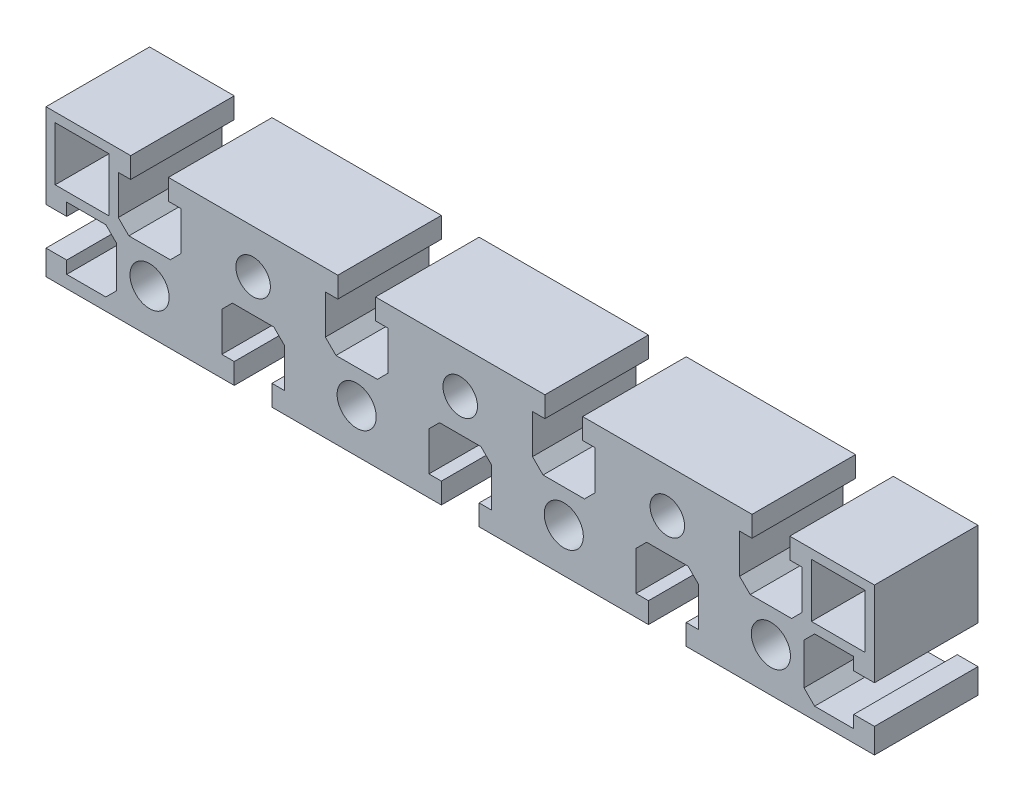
ISO-10303-21;
HEADER;
FILE_DESCRIPTION(('STEP AP214'),'2;1');
FILE_NAME('part.step','',(''),(''),'','','');
FILE_SCHEMA(('AUTOMOTIVE_DESIGN { 1 0 10303 214 1 1 1 1 }'));
ENDSEC;
DATA;
#1=APPLICATION_CONTEXT('core data for automotive mechanical design processes');
#2=APPLICATION_PROTOCOL_DEFINITION('international standard','automotive_design',2000,#1);
#3=PRODUCT_CONTEXT('',#1,'mechanical');
#4=PRODUCT('Part','Part','',(#3));
#5=PRODUCT_RELATED_PRODUCT_CATEGORY('part','',(#4));
#6=PRODUCT_DEFINITION_FORMATION('','',#4);
#7=PRODUCT_DEFINITION_CONTEXT('part definition',#1,'design');
#8=PRODUCT_DEFINITION('design','',#6,#7);
#9=PRODUCT_DEFINITION_SHAPE('','',#8);
#10=(LENGTH_UNIT() NAMED_UNIT(*) SI_UNIT(.MILLI.,.METRE.));
#11=(NAMED_UNIT(*) PLANE_ANGLE_UNIT() SI_UNIT($,.RADIAN.));
#12=(NAMED_UNIT(*) SI_UNIT($,.STERADIAN.) SOLID_ANGLE_UNIT());
#13=UNCERTAINTY_MEASURE_WITH_UNIT(LENGTH_MEASURE(1.E-05),#10,'distance_accuracy_value','');
#14=(GEOMETRIC_REPRESENTATION_CONTEXT(3) GLOBAL_UNCERTAINTY_ASSIGNED_CONTEXT((#13)) GLOBAL_UNIT_ASSIGNED_CONTEXT((#10,
#11,#12)) REPRESENTATION_CONTEXT('',''));
#15=CARTESIAN_POINT('',(0.,0.,0.));
#16=DIRECTION('',(0.,0.,1.));
#17=DIRECTION('',(1.,0.,0.));
#18=AXIS2_PLACEMENT_3D('',#15,#16,#17);
#19=CARTESIAN_POINT('',(-74.3,18.,-11.25));
#20=DIRECTION('',(0.,0.,-1.));
#21=DIRECTION('',(-1.,0.,0.));
#22=AXIS2_PLACEMENT_3D('',#19,#20,#21);
#23=PLANE('',#22);
#24=CARTESIAN_POINT('',(-22.5,0.,-11.25));
#25=DIRECTION('',(0.,0.,1.));
#26=DIRECTION('',(1.,0.,0.));
#27=AXIS2_PLACEMENT_3D('',#24,#25,#26);
#28=CIRCLE('',#27,4.24999999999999);
#29=CARTESIAN_POINT('',(-18.25,0.,-11.25));
#30=VERTEX_POINT('',#29);
#31=EDGE_CURVE('E1962',#30,#30,#28,.T.);
#32=ORIENTED_EDGE('',*,*,#31,.T.);
#33=EDGE_LOOP('',(#32));
#34=FACE_BOUND('',#33,.T.);
#35=CARTESIAN_POINT('',(67.5,0.,-11.25));
#36=DIRECTION('',(0.,0.,1.));
#37=DIRECTION('',(1.,0.,0.));
#38=AXIS2_PLACEMENT_3D('',#35,#36,#37);
#39=CIRCLE('',#38,4.24999999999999);
#40=CARTESIAN_POINT('',(71.75,0.,-11.25));
#41=VERTEX_POINT('',#40);
#42=EDGE_CURVE('E681',#41,#41,#39,.T.);
#43=ORIENTED_EDGE('',*,*,#42,.T.);
#44=EDGE_LOOP('',(#43));
#45=FACE_BOUND('',#44,.T.);
#46=DIRECTION('',(0.,1.,0.));
#47=VECTOR('',#46,1.);
#48=CARTESIAN_POINT('',(-76.3000488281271,20.5,-11.25));
#49=LINE('',#48,#47);
#50=CARTESIAN_POINT('',(-76.3000488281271,8.79998779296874,-11.25));
#51=VERTEX_POINT('',#50);
#52=CARTESIAN_POINT('',(-76.3000488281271,20.5,-11.25));
#53=VERTEX_POINT('',#52);
#54=EDGE_CURVE('E996',#51,#53,#49,.T.);
#55=ORIENTED_EDGE('',*,*,#54,.T.);
#56=DIRECTION('',(-1.,0.,0.));
#57=VECTOR('',#56,1.);
#58=CARTESIAN_POINT('',(-88.,20.5,-11.25));
#59=LINE('',#58,#57);
#60=CARTESIAN_POINT('',(-88.,20.5,-11.25));
#61=VERTEX_POINT('',#60);
#62=EDGE_CURVE('E667',#53,#61,#59,.T.);
#63=ORIENTED_EDGE('',*,*,#62,.T.);
#64=DIRECTION('',(0.,-1.,0.));
#65=VECTOR('',#64,1.);
#66=CARTESIAN_POINT('',(-88.,8.79998779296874,-11.25));
#67=LINE('',#66,#65);
#68=CARTESIAN_POINT('',(-88.,8.79998779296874,-11.25));
#69=VERTEX_POINT('',#68);
#70=EDGE_CURVE('E47',#61,#69,#67,.T.);
#71=ORIENTED_EDGE('',*,*,#70,.T.);
#72=DIRECTION('',(1.,0.,0.));
#73=VECTOR('',#72,1.);
#74=CARTESIAN_POINT('',(-76.3000488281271,8.79998779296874,-11.25));
#75=LINE('',#74,#73);
#76=EDGE_CURVE('E672',#69,#51,#75,.T.);
#77=ORIENTED_EDGE('',*,*,#76,.T.);
#78=EDGE_LOOP('',(#55,#63,#71,#77));
#79=FACE_BOUND('',#78,.T.);
#80=DIRECTION('',(1.,0.,0.));
#81=VECTOR('',#80,1.);
#82=CARTESIAN_POINT('',(87.9999511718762,8.79998779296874,-11.25));
#83=LINE('',#82,#81);
#84=CARTESIAN_POINT('',(76.3,8.79998779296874,-11.25));
#85=VERTEX_POINT('',#84);
#86=CARTESIAN_POINT('',(87.9999511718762,8.79998779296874,-11.25));
#87=VERTEX_POINT('',#86);
#88=EDGE_CURVE('E1003',#85,#87,#83,.T.);
#89=ORIENTED_EDGE('',*,*,#88,.T.);
#90=DIRECTION('',(0.,1.,0.));
#91=VECTOR('',#90,1.);
#92=CARTESIAN_POINT('',(87.9999511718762,20.5,-11.25));
#93=LINE('',#92,#91);
#94=CARTESIAN_POINT('',(87.9999511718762,20.5,-11.25));
#95=VERTEX_POINT('',#94);
#96=EDGE_CURVE('E1009',#87,#95,#93,.T.);
#97=ORIENTED_EDGE('',*,*,#96,.T.);
#98=DIRECTION('',(-1.,0.,0.));
#99=VECTOR('',#98,1.);
#100=CARTESIAN_POINT('',(76.3,20.5,-11.25));
#101=LINE('',#100,#99);
#102=CARTESIAN_POINT('',(76.3,20.5,-11.25));
#103=VERTEX_POINT('',#102);
#104=EDGE_CURVE('E55',#95,#103,#101,.T.);
#105=ORIENTED_EDGE('',*,*,#104,.T.);
#106=DIRECTION('',(0.,-1.,0.));
#107=VECTOR('',#106,1.);
#108=CARTESIAN_POINT('',(76.3,8.79998779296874,-11.25));
#109=LINE('',#108,#107);
#110=EDGE_CURVE('E1013',#103,#85,#109,.T.);
#111=ORIENTED_EDGE('',*,*,#110,.T.);
#112=EDGE_LOOP('',(#89,#97,#105,#111));
#113=FACE_BOUND('',#112,.T.);
#114=CARTESIAN_POINT('',(-45.,13.,-11.25));
#115=DIRECTION('',(0.,0.,1.));
#116=DIRECTION('',(1.,0.,0.));
#117=AXIS2_PLACEMENT_3D('',#114,#115,#116);
#118=CIRCLE('',#117,3.75000000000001);
#119=CARTESIAN_POINT('',(-41.25,13.,-11.25));
#120=VERTEX_POINT('',#119);
#121=EDGE_CURVE('E1019',#120,#120,#118,.T.);
#122=ORIENTED_EDGE('',*,*,#121,.T.);
#123=EDGE_LOOP('',(#122));
#124=FACE_BOUND('',#123,.T.);
#125=CARTESIAN_POINT('',(0.,13.,-11.25));
#126=DIRECTION('',(0.,0.,1.));
#127=DIRECTION('',(1.,0.,0.));
#128=AXIS2_PLACEMENT_3D('',#125,#126,#127);
#129=CIRCLE('',#128,3.75000000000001);
#130=CARTESIAN_POINT('',(3.75000000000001,13.,-11.25));
#131=VERTEX_POINT('',#130);
#132=EDGE_CURVE('E1027',#131,#131,#129,.T.);
#133=ORIENTED_EDGE('',*,*,#132,.T.);
#134=EDGE_LOOP('',(#133));
#135=FACE_BOUND('',#134,.T.);
#136=CARTESIAN_POINT('',(45.,13.,-11.25));
#137=DIRECTION('',(0.,0.,1.));
#138=DIRECTION('',(1.,0.,0.));
#139=AXIS2_PLACEMENT_3D('',#136,#137,#138);
#140=CIRCLE('',#139,3.75000000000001);
#141=CARTESIAN_POINT('',(48.75,13.,-11.25));
#142=VERTEX_POINT('',#141);
#143=EDGE_CURVE('E1030',#142,#142,#140,.T.);
#144=ORIENTED_EDGE('',*,*,#143,.T.);
#145=EDGE_LOOP('',(#144));
#146=FACE_BOUND('',#145,.T.);
#147=DIRECTION('',(0.,1.,0.));
#148=VECTOR('',#147,1.);
#149=CARTESIAN_POINT('',(-74.3,9.50000000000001,-11.25));
#150=LINE('',#149,#148);
#151=CARTESIAN_POINT('',(-74.3,9.50000000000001,-11.25));
#152=VERTEX_POINT('',#151);
#153=CARTESIAN_POINT('',(-74.3,18.,-11.25));
#154=VERTEX_POINT('',#153);
#155=EDGE_CURVE('E1033',#152,#154,#150,.T.);
#156=ORIENTED_EDGE('',*,*,#155,.F.);
#157=DIRECTION('',(-0.70710678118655,0.707106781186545,0.));
#158=VECTOR('',#157,1.);
#159=CARTESIAN_POINT('',(-72.,7.2,-11.25));
#160=LINE('',#159,#158);
#161=CARTESIAN_POINT('',(-72.,7.2,-11.25));
#162=VERTEX_POINT('',#161);
#163=EDGE_CURVE('E1312',#162,#152,#160,.T.);
#164=ORIENTED_EDGE('',*,*,#163,.F.);
#165=DIRECTION('',(-1.,0.,0.));
#166=VECTOR('',#165,1.);
#167=CARTESIAN_POINT('',(-63.,7.2,-11.25));
#168=LINE('',#167,#166);
#169=CARTESIAN_POINT('',(-63.,7.2,-11.25));
#170=VERTEX_POINT('',#169);
#171=EDGE_CURVE('E1309',#170,#162,#168,.T.);
#172=ORIENTED_EDGE('',*,*,#171,.F.);
#173=DIRECTION('',(-0.707106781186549,-0.707106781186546,0.));
#174=VECTOR('',#173,1.);
#175=CARTESIAN_POINT('',(-60.7,9.50000000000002,-11.25));
#176=LINE('',#175,#174);
#177=CARTESIAN_POINT('',(-60.7,9.50000000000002,-11.25));
#178=VERTEX_POINT('',#177);
#179=EDGE_CURVE('E1306',#178,#170,#176,.T.);
#180=ORIENTED_EDGE('',*,*,#179,.F.);
#181=DIRECTION('',(0.,-1.,0.));
#182=VECTOR('',#181,1.);
#183=CARTESIAN_POINT('',(-60.7,18.,-11.25));
#184=LINE('',#183,#182);
#185=CARTESIAN_POINT('',(-60.7,18.,-11.25));
#186=VERTEX_POINT('',#185);
#187=EDGE_CURVE('E1303',#186,#178,#184,.T.);
#188=ORIENTED_EDGE('',*,*,#187,.F.);
#189=DIRECTION('',(1.,0.,0.));
#190=VECTOR('',#189,1.);
#191=CARTESIAN_POINT('',(-63.4000000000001,18.,-11.25));
#192=LINE('',#191,#190);
#193=CARTESIAN_POINT('',(-63.4000000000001,18.,-11.25));
#194=VERTEX_POINT('',#193);
#195=EDGE_CURVE('E1300',#194,#186,#192,.T.);
#196=ORIENTED_EDGE('',*,*,#195,.F.);
#197=DIRECTION('',(0.,-1.,0.));
#198=VECTOR('',#197,1.);
#199=CARTESIAN_POINT('',(-63.4000000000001,22.5,-11.25));
#200=LINE('',#199,#198);
#201=CARTESIAN_POINT('',(-63.4000000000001,22.5,-11.25));
#202=VERTEX_POINT('',#201);
#203=EDGE_CURVE('E1297',#202,#194,#200,.T.);
#204=ORIENTED_EDGE('',*,*,#203,.F.);
#205=DIRECTION('',(-1.,0.,0.));
#206=VECTOR('',#205,1.);
#207=CARTESIAN_POINT('',(-26.6,22.5,-11.25));
#208=LINE('',#207,#206);
#209=CARTESIAN_POINT('',(-26.6,22.5,-11.25));
#210=VERTEX_POINT('',#209);
#211=EDGE_CURVE('E1294',#210,#202,#208,.T.);
#212=ORIENTED_EDGE('',*,*,#211,.F.);
#213=DIRECTION('',(0.,1.,0.));
#214=VECTOR('',#213,1.);
#215=CARTESIAN_POINT('',(-26.6,18.,-11.25));
#216=LINE('',#215,#214);
#217=CARTESIAN_POINT('',(-26.6,18.,-11.25));
#218=VERTEX_POINT('',#217);
#219=EDGE_CURVE('E1291',#218,#210,#216,.T.);
#220=ORIENTED_EDGE('',*,*,#219,.F.);
#221=DIRECTION('',(1.,0.,0.));
#222=VECTOR('',#221,1.);
#223=CARTESIAN_POINT('',(-29.3,18.,-11.25));
#224=LINE('',#223,#222);
#225=CARTESIAN_POINT('',(-29.3,18.,-11.25));
#226=VERTEX_POINT('',#225);
#227=EDGE_CURVE('E1288',#226,#218,#224,.T.);
#228=ORIENTED_EDGE('',*,*,#227,.F.);
#229=DIRECTION('',(0.,1.,0.));
#230=VECTOR('',#229,1.);
#231=CARTESIAN_POINT('',(-29.3,9.5,-11.25));
#232=LINE('',#231,#230);
#233=CARTESIAN_POINT('',(-29.3,9.5,-11.25));
#234=VERTEX_POINT('',#233);
#235=EDGE_CURVE('E1285',#234,#226,#232,.T.);
#236=ORIENTED_EDGE('',*,*,#235,.F.);
#237=DIRECTION('',(-0.707106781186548,0.707106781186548,0.));
#238=VECTOR('',#237,1.);
#239=CARTESIAN_POINT('',(-27.,7.20000000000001,-11.25));
#240=LINE('',#239,#238);
#241=CARTESIAN_POINT('',(-27.,7.20000000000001,-11.25));
#242=VERTEX_POINT('',#241);
#243=EDGE_CURVE('E1282',#242,#234,#240,.T.);
#244=ORIENTED_EDGE('',*,*,#243,.F.);
#245=DIRECTION('',(-1.,0.,0.));
#246=VECTOR('',#245,1.);
#247=CARTESIAN_POINT('',(-18.,7.2,-11.25));
#248=LINE('',#247,#246);
#249=CARTESIAN_POINT('',(-18.,7.2,-11.25));
#250=VERTEX_POINT('',#249);
#251=EDGE_CURVE('E1279',#250,#242,#248,.T.);
#252=ORIENTED_EDGE('',*,*,#251,.F.);
#253=DIRECTION('',(-0.707106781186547,-0.707106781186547,0.));
#254=VECTOR('',#253,1.);
#255=CARTESIAN_POINT('',(-15.7,9.49999999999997,-11.25));
#256=LINE('',#255,#254);
#257=CARTESIAN_POINT('',(-15.7,9.49999999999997,-11.25));
#258=VERTEX_POINT('',#257);
#259=EDGE_CURVE('E1276',#258,#250,#256,.T.);
#260=ORIENTED_EDGE('',*,*,#259,.F.);
#261=DIRECTION('',(0.,-1.,0.));
#262=VECTOR('',#261,1.);
#263=CARTESIAN_POINT('',(-15.7,18.,-11.25));
#264=LINE('',#263,#262);
#265=CARTESIAN_POINT('',(-15.7,18.,-11.25));
#266=VERTEX_POINT('',#265);
#267=EDGE_CURVE('E1273',#266,#258,#264,.T.);
#268=ORIENTED_EDGE('',*,*,#267,.F.);
#269=DIRECTION('',(1.,0.,0.));
#270=VECTOR('',#269,1.);
#271=CARTESIAN_POINT('',(-18.4,18.,-11.25));
#272=LINE('',#271,#270);
#273=CARTESIAN_POINT('',(-18.4,18.,-11.25));
#274=VERTEX_POINT('',#273);
#275=EDGE_CURVE('E1270',#274,#266,#272,.T.);
#276=ORIENTED_EDGE('',*,*,#275,.F.);
#277=DIRECTION('',(0.,-1.,0.));
#278=VECTOR('',#277,1.);
#279=CARTESIAN_POINT('',(-18.4,22.5,-11.25));
#280=LINE('',#279,#278);
#281=CARTESIAN_POINT('',(-18.4,22.5,-11.25));
#282=VERTEX_POINT('',#281);
#283=EDGE_CURVE('E1267',#282,#274,#280,.T.);
#284=ORIENTED_EDGE('',*,*,#283,.F.);
#285=DIRECTION('',(-1.,0.,0.));
#286=VECTOR('',#285,1.);
#287=CARTESIAN_POINT('',(18.4,22.5,-11.25));
#288=LINE('',#287,#286);
#289=CARTESIAN_POINT('',(18.4,22.5,-11.25));
#290=VERTEX_POINT('',#289);
#291=EDGE_CURVE('E1264',#290,#282,#288,.T.);
#292=ORIENTED_EDGE('',*,*,#291,.F.);
#293=DIRECTION('',(0.,1.,0.));
#294=VECTOR('',#293,1.);
#295=CARTESIAN_POINT('',(18.4,18.,-11.25));
#296=LINE('',#295,#294);
#297=CARTESIAN_POINT('',(18.4,18.,-11.25));
#298=VERTEX_POINT('',#297);
#299=EDGE_CURVE('E1261',#298,#290,#296,.T.);
#300=ORIENTED_EDGE('',*,*,#299,.F.);
#301=DIRECTION('',(1.,0.,0.));
#302=VECTOR('',#301,1.);
#303=CARTESIAN_POINT('',(15.6999999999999,18.,-11.25));
#304=LINE('',#303,#302);
#305=CARTESIAN_POINT('',(15.6999999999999,18.,-11.25));
#306=VERTEX_POINT('',#305);
#307=EDGE_CURVE('E1258',#306,#298,#304,.T.);
#308=ORIENTED_EDGE('',*,*,#307,.F.);
#309=DIRECTION('',(0.,1.,0.));
#310=VECTOR('',#309,1.);
#311=CARTESIAN_POINT('',(15.6999999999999,9.50000000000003,-11.25));
#312=LINE('',#311,#310);
#313=CARTESIAN_POINT('',(15.6999999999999,9.50000000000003,-11.25));
#314=VERTEX_POINT('',#313);
#315=EDGE_CURVE('E1255',#314,#306,#312,.T.);
#316=ORIENTED_EDGE('',*,*,#315,.F.);
#317=DIRECTION('',(-0.707106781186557,0.707106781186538,0.));
#318=VECTOR('',#317,1.);
#319=CARTESIAN_POINT('',(18.,7.20000000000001,-11.25));
#320=LINE('',#319,#318);
#321=CARTESIAN_POINT('',(18.,7.20000000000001,-11.25));
#322=VERTEX_POINT('',#321);
#323=EDGE_CURVE('E1252',#322,#314,#320,.T.);
#324=ORIENTED_EDGE('',*,*,#323,.F.);
#325=DIRECTION('',(-1.,0.,0.));
#326=VECTOR('',#325,1.);
#327=CARTESIAN_POINT('',(27.,7.2,-11.25));
#328=LINE('',#327,#326);
#329=CARTESIAN_POINT('',(27.,7.2,-11.25));
#330=VERTEX_POINT('',#329);
#331=EDGE_CURVE('E1249',#330,#322,#328,.T.);
#332=ORIENTED_EDGE('',*,*,#331,.F.);
#333=DIRECTION('',(-0.707106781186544,-0.707106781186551,0.));
#334=VECTOR('',#333,1.);
#335=CARTESIAN_POINT('',(29.3,9.50000000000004,-11.25));
#336=LINE('',#335,#334);
#337=CARTESIAN_POINT('',(29.3,9.50000000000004,-11.25));
#338=VERTEX_POINT('',#337);
#339=EDGE_CURVE('E1246',#338,#330,#336,.T.);
#340=ORIENTED_EDGE('',*,*,#339,.F.);
#341=DIRECTION('',(0.,-1.,0.));
#342=VECTOR('',#341,1.);
#343=CARTESIAN_POINT('',(29.3,18.,-11.25));
#344=LINE('',#343,#342);
#345=CARTESIAN_POINT('',(29.3,18.,-11.25));
#346=VERTEX_POINT('',#345);
#347=EDGE_CURVE('E1243',#346,#338,#344,.T.);
#348=ORIENTED_EDGE('',*,*,#347,.F.);
#349=DIRECTION('',(1.,0.,0.));
#350=VECTOR('',#349,1.);
#351=CARTESIAN_POINT('',(26.5999999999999,18.,-11.25));
#352=LINE('',#351,#350);
#353=CARTESIAN_POINT('',(26.5999999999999,18.,-11.25));
#354=VERTEX_POINT('',#353);
#355=EDGE_CURVE('E1240',#354,#346,#352,.T.);
#356=ORIENTED_EDGE('',*,*,#355,.F.);
#357=DIRECTION('',(0.,-1.,0.));
#358=VECTOR('',#357,1.);
#359=CARTESIAN_POINT('',(26.5999999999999,22.5,-11.25));
#360=LINE('',#359,#358);
#361=CARTESIAN_POINT('',(26.5999999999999,22.5,-11.25));
#362=VERTEX_POINT('',#361);
#363=EDGE_CURVE('E1237',#362,#354,#360,.T.);
#364=ORIENTED_EDGE('',*,*,#363,.F.);
#365=DIRECTION('',(-1.,0.,0.));
#366=VECTOR('',#365,1.);
#367=CARTESIAN_POINT('',(63.4000000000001,22.5,-11.25));
#368=LINE('',#367,#366);
#369=CARTESIAN_POINT('',(63.4000000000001,22.5,-11.25));
#370=VERTEX_POINT('',#369);
#371=EDGE_CURVE('E1234',#370,#362,#368,.T.);
#372=ORIENTED_EDGE('',*,*,#371,.F.);
#373=DIRECTION('',(0.,1.,0.));
#374=VECTOR('',#373,1.);
#375=CARTESIAN_POINT('',(63.4000000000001,18.,-11.25));
#376=LINE('',#375,#374);
#377=CARTESIAN_POINT('',(63.4000000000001,18.,-11.25));
#378=VERTEX_POINT('',#377);
#379=EDGE_CURVE('E1231',#378,#370,#376,.T.);
#380=ORIENTED_EDGE('',*,*,#379,.F.);
#381=DIRECTION('',(1.,0.,0.));
#382=VECTOR('',#381,1.);
#383=CARTESIAN_POINT('',(60.6999999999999,18.,-11.25));
#384=LINE('',#383,#382);
#385=CARTESIAN_POINT('',(60.6999999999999,18.,-11.25));
#386=VERTEX_POINT('',#385);
#387=EDGE_CURVE('E1228',#386,#378,#384,.T.);
#388=ORIENTED_EDGE('',*,*,#387,.F.);
#389=DIRECTION('',(0.,1.,0.));
#390=VECTOR('',#389,1.);
#391=CARTESIAN_POINT('',(60.6999999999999,9.50000000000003,-11.25));
#392=LINE('',#391,#390);
#393=CARTESIAN_POINT('',(60.6999999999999,9.50000000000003,-11.25));
#394=VERTEX_POINT('',#393);
#395=EDGE_CURVE('E1225',#394,#386,#392,.T.);
#396=ORIENTED_EDGE('',*,*,#395,.F.);
#397=DIRECTION('',(-0.70710678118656,0.707106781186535,0.));
#398=VECTOR('',#397,1.);
#399=CARTESIAN_POINT('',(63.,7.2,-11.25));
#400=LINE('',#399,#398);
#401=CARTESIAN_POINT('',(63.,7.2,-11.25));
#402=VERTEX_POINT('',#401);
#403=EDGE_CURVE('E1222',#402,#394,#400,.T.);
#404=ORIENTED_EDGE('',*,*,#403,.F.);
#405=DIRECTION('',(-1.,0.,0.));
#406=VECTOR('',#405,1.);
#407=CARTESIAN_POINT('',(72.,7.2,-11.25));
#408=LINE('',#407,#406);
#409=CARTESIAN_POINT('',(72.,7.2,-11.25));
#410=VERTEX_POINT('',#409);
#411=EDGE_CURVE('E1219',#410,#402,#408,.T.);
#412=ORIENTED_EDGE('',*,*,#411,.F.);
#413=DIRECTION('',(-0.707106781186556,-0.707106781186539,0.));
#414=VECTOR('',#413,1.);
#415=CARTESIAN_POINT('',(74.3000000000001,9.50000000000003,-11.25));
#416=LINE('',#415,#414);
#417=CARTESIAN_POINT('',(74.3000000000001,9.50000000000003,-11.25));
#418=VERTEX_POINT('',#417);
#419=EDGE_CURVE('E1216',#418,#410,#416,.T.);
#420=ORIENTED_EDGE('',*,*,#419,.F.);
#421=DIRECTION('',(0.,-1.,0.));
#422=VECTOR('',#421,1.);
#423=CARTESIAN_POINT('',(74.3000000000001,18.,-11.25));
#424=LINE('',#423,#422);
#425=CARTESIAN_POINT('',(74.3000000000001,18.,-11.25));
#426=VERTEX_POINT('',#425);
#427=EDGE_CURVE('E1213',#426,#418,#424,.T.);
#428=ORIENTED_EDGE('',*,*,#427,.F.);
#429=DIRECTION('',(1.,0.,0.));
#430=VECTOR('',#429,1.);
#431=CARTESIAN_POINT('',(71.6000000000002,18.,-11.25));
#432=LINE('',#431,#430);
#433=CARTESIAN_POINT('',(71.6000000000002,18.,-11.25));
#434=VERTEX_POINT('',#433);
#435=EDGE_CURVE('E1210',#434,#426,#432,.T.);
#436=ORIENTED_EDGE('',*,*,#435,.F.);
#437=DIRECTION('',(0.,-1.,0.));
#438=VECTOR('',#437,1.);
#439=CARTESIAN_POINT('',(71.6000000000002,22.5,-11.25));
#440=LINE('',#439,#438);
#441=CARTESIAN_POINT('',(71.6000000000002,22.5,-11.25));
#442=VERTEX_POINT('',#441);
#443=EDGE_CURVE('E1207',#442,#434,#440,.T.);
#444=ORIENTED_EDGE('',*,*,#443,.F.);
#445=DIRECTION('',(-1.,0.,0.));
#446=VECTOR('',#445,1.);
#447=CARTESIAN_POINT('',(90.0000000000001,22.5,-11.25));
#448=LINE('',#447,#446);
#449=CARTESIAN_POINT('',(90.0000000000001,22.5,-11.25));
#450=VERTEX_POINT('',#449);
#451=EDGE_CURVE('E1204',#450,#442,#448,.T.);
#452=ORIENTED_EDGE('',*,*,#451,.F.);
#453=DIRECTION('',(0.,1.,0.));
#454=VECTOR('',#453,1.);
#455=CARTESIAN_POINT('',(90.0000000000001,4.09999999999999,-11.25));
#456=LINE('',#455,#454);
#457=CARTESIAN_POINT('',(90.0000000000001,4.09999999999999,-11.25));
#458=VERTEX_POINT('',#457);
#459=EDGE_CURVE('E1201',#458,#450,#456,.T.);
#460=ORIENTED_EDGE('',*,*,#459,.F.);
#461=DIRECTION('',(1.,0.,0.));
#462=VECTOR('',#461,1.);
#463=CARTESIAN_POINT('',(85.5,4.1,-11.25));
#464=LINE('',#463,#462);
#465=CARTESIAN_POINT('',(85.5,4.1,-11.25));
#466=VERTEX_POINT('',#465);
#467=EDGE_CURVE('E1198',#466,#458,#464,.T.);
#468=ORIENTED_EDGE('',*,*,#467,.F.);
#469=DIRECTION('',(0.,-1.,0.));
#470=VECTOR('',#469,1.);
#471=CARTESIAN_POINT('',(85.5,6.79999999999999,-11.25));
#472=LINE('',#471,#470);
#473=CARTESIAN_POINT('',(85.5,6.79999999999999,-11.25));
#474=VERTEX_POINT('',#473);
#475=EDGE_CURVE('E1195',#474,#466,#472,.T.);
#476=ORIENTED_EDGE('',*,*,#475,.F.);
#477=DIRECTION('',(1.,0.,0.));
#478=VECTOR('',#477,1.);
#479=CARTESIAN_POINT('',(77.,6.8,-11.25));
#480=LINE('',#479,#478);
#481=CARTESIAN_POINT('',(77.,6.8,-11.25));
#482=VERTEX_POINT('',#481);
#483=EDGE_CURVE('E1192',#482,#474,#480,.T.);
#484=ORIENTED_EDGE('',*,*,#483,.F.);
#485=DIRECTION('',(0.707106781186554,0.707106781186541,0.));
#486=VECTOR('',#485,1.);
#487=CARTESIAN_POINT('',(74.7,4.5,-11.25));
#488=LINE('',#487,#486);
#489=CARTESIAN_POINT('',(74.7,4.5,-11.25));
#490=VERTEX_POINT('',#489);
#491=EDGE_CURVE('E1189',#490,#482,#488,.T.);
#492=ORIENTED_EDGE('',*,*,#491,.F.);
#493=DIRECTION('',(0.,1.,0.));
#494=VECTOR('',#493,1.);
#495=CARTESIAN_POINT('',(74.7,-4.50000000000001,-11.25));
#496=LINE('',#495,#494);
#497=CARTESIAN_POINT('',(74.7,-4.50000000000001,-11.25));
#498=VERTEX_POINT('',#497);
#499=EDGE_CURVE('E1186',#498,#490,#496,.T.);
#500=ORIENTED_EDGE('',*,*,#499,.F.);
#501=DIRECTION('',(-0.707106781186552,0.707106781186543,0.));
#502=VECTOR('',#501,1.);
#503=CARTESIAN_POINT('',(77.,-6.80000000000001,-11.25));
#504=LINE('',#503,#502);
#505=CARTESIAN_POINT('',(77.,-6.80000000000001,-11.25));
#506=VERTEX_POINT('',#505);
#507=EDGE_CURVE('E1183',#506,#498,#504,.T.);
#508=ORIENTED_EDGE('',*,*,#507,.F.);
#509=DIRECTION('',(-1.,0.,0.));
#510=VECTOR('',#509,1.);
#511=CARTESIAN_POINT('',(85.5,-6.8,-11.25));
#512=LINE('',#511,#510);
#513=CARTESIAN_POINT('',(85.5,-6.8,-11.25));
#514=VERTEX_POINT('',#513);
#515=EDGE_CURVE('E1180',#514,#506,#512,.T.);
#516=ORIENTED_EDGE('',*,*,#515,.F.);
#517=DIRECTION('',(0.,-1.,0.));
#518=VECTOR('',#517,1.);
#519=CARTESIAN_POINT('',(85.5,-4.10000000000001,-11.25));
#520=LINE('',#519,#518);
#521=CARTESIAN_POINT('',(85.5,-4.10000000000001,-11.25));
#522=VERTEX_POINT('',#521);
#523=EDGE_CURVE('E1177',#522,#514,#520,.T.);
#524=ORIENTED_EDGE('',*,*,#523,.F.);
#525=DIRECTION('',(-1.,0.,0.));
#526=VECTOR('',#525,1.);
#527=CARTESIAN_POINT('',(90.,-4.10000000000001,-11.25));
#528=LINE('',#527,#526);
#529=CARTESIAN_POINT('',(90.,-4.10000000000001,-11.25));
#530=VERTEX_POINT('',#529);
#531=EDGE_CURVE('E1174',#530,#522,#528,.T.);
#532=ORIENTED_EDGE('',*,*,#531,.F.);
#533=DIRECTION('',(0.,1.,0.));
#534=VECTOR('',#533,1.);
#535=CARTESIAN_POINT('',(90.,-9.5,-11.25));
#536=LINE('',#535,#534);
#537=CARTESIAN_POINT('',(90.,-9.5,-11.25));
#538=VERTEX_POINT('',#537);
#539=EDGE_CURVE('E1171',#538,#530,#536,.T.);
#540=ORIENTED_EDGE('',*,*,#539,.F.);
#541=DIRECTION('',(1.,0.,0.));
#542=VECTOR('',#541,1.);
#543=CARTESIAN_POINT('',(49.1,-9.5,-11.25));
#544=LINE('',#543,#542);
#545=CARTESIAN_POINT('',(49.1,-9.5,-11.25));
#546=VERTEX_POINT('',#545);
#547=EDGE_CURVE('E1168',#546,#538,#544,.T.);
#548=ORIENTED_EDGE('',*,*,#547,.F.);
#549=DIRECTION('',(0.,-1.,0.));
#550=VECTOR('',#549,1.);
#551=CARTESIAN_POINT('',(49.1,-5.,-11.25));
#552=LINE('',#551,#550);
#553=CARTESIAN_POINT('',(49.1,-5.,-11.25));
#554=VERTEX_POINT('',#553);
#555=EDGE_CURVE('E1165',#554,#546,#552,.T.);
#556=ORIENTED_EDGE('',*,*,#555,.F.);
#557=DIRECTION('',(-1.,0.,0.));
#558=VECTOR('',#557,1.);
#559=CARTESIAN_POINT('',(51.8,-5.,-11.25));
#560=LINE('',#559,#558);
#561=CARTESIAN_POINT('',(51.8,-5.,-11.25));
#562=VERTEX_POINT('',#561);
#563=EDGE_CURVE('E1162',#562,#554,#560,.T.);
#564=ORIENTED_EDGE('',*,*,#563,.F.);
#565=DIRECTION('',(0.,-1.,0.));
#566=VECTOR('',#565,1.);
#567=CARTESIAN_POINT('',(51.8,3.5,-11.25));
#568=LINE('',#567,#566);
#569=CARTESIAN_POINT('',(51.8,3.5,-11.25));
#570=VERTEX_POINT('',#569);
#571=EDGE_CURVE('E1159',#570,#562,#568,.T.);
#572=ORIENTED_EDGE('',*,*,#571,.F.);
#573=DIRECTION('',(0.707106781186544,-0.707106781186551,0.));
#574=VECTOR('',#573,1.);
#575=CARTESIAN_POINT('',(49.5,5.80000000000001,-11.25));
#576=LINE('',#575,#574);
#577=CARTESIAN_POINT('',(49.5,5.80000000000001,-11.25));
#578=VERTEX_POINT('',#577);
#579=EDGE_CURVE('E1156',#578,#570,#576,.T.);
#580=ORIENTED_EDGE('',*,*,#579,.F.);
#581=DIRECTION('',(1.,0.,0.));
#582=VECTOR('',#581,1.);
#583=CARTESIAN_POINT('',(40.5,5.80000000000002,-11.25));
#584=LINE('',#583,#582);
#585=CARTESIAN_POINT('',(40.5,5.80000000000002,-11.25));
#586=VERTEX_POINT('',#585);
#587=EDGE_CURVE('E1153',#586,#578,#584,.T.);
#588=ORIENTED_EDGE('',*,*,#587,.F.);
#589=DIRECTION('',(0.707106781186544,0.707106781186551,0.));
#590=VECTOR('',#589,1.);
#591=CARTESIAN_POINT('',(38.2,3.50000000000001,-11.25));
#592=LINE('',#591,#590);
#593=CARTESIAN_POINT('',(38.2,3.50000000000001,-11.25));
#594=VERTEX_POINT('',#593);
#595=EDGE_CURVE('E1150',#594,#586,#592,.T.);
#596=ORIENTED_EDGE('',*,*,#595,.F.);
#597=DIRECTION('',(0.,1.,0.));
#598=VECTOR('',#597,1.);
#599=CARTESIAN_POINT('',(38.2,-5.00000000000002,-11.25));
#600=LINE('',#599,#598);
#601=CARTESIAN_POINT('',(38.2,-5.00000000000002,-11.25));
#602=VERTEX_POINT('',#601);
#603=EDGE_CURVE('E1147',#602,#594,#600,.T.);
#604=ORIENTED_EDGE('',*,*,#603,.F.);
#605=DIRECTION('',(-1.,0.,0.));
#606=VECTOR('',#605,1.);
#607=CARTESIAN_POINT('',(40.9,-5.00000000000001,-11.25));
#608=LINE('',#607,#606);
#609=CARTESIAN_POINT('',(40.9,-5.00000000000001,-11.25));
#610=VERTEX_POINT('',#609);
#611=EDGE_CURVE('E1144',#610,#602,#608,.T.);
#612=ORIENTED_EDGE('',*,*,#611,.F.);
#613=DIRECTION('',(0.,1.,0.));
#614=VECTOR('',#613,1.);
#615=CARTESIAN_POINT('',(40.9,-9.5,-11.25));
#616=LINE('',#615,#614);
#617=CARTESIAN_POINT('',(40.9,-9.5,-11.25));
#618=VERTEX_POINT('',#617);
#619=EDGE_CURVE('E1141',#618,#610,#616,.T.);
#620=ORIENTED_EDGE('',*,*,#619,.F.);
#621=DIRECTION('',(1.,0.,0.));
#622=VECTOR('',#621,1.);
#623=CARTESIAN_POINT('',(4.10000000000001,-9.5,-11.25));
#624=LINE('',#623,#622);
#625=CARTESIAN_POINT('',(4.10000000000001,-9.5,-11.25));
#626=VERTEX_POINT('',#625);
#627=EDGE_CURVE('E1138',#626,#618,#624,.T.);
#628=ORIENTED_EDGE('',*,*,#627,.F.);
#629=DIRECTION('',(0.,-1.,0.));
#630=VECTOR('',#629,1.);
#631=CARTESIAN_POINT('',(4.10000000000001,-5.00000000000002,-11.25));
#632=LINE('',#631,#630);
#633=CARTESIAN_POINT('',(4.10000000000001,-5.00000000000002,-11.25));
#634=VERTEX_POINT('',#633);
#635=EDGE_CURVE('E1135',#634,#626,#632,.T.);
#636=ORIENTED_EDGE('',*,*,#635,.F.);
#637=DIRECTION('',(-1.,0.,0.));
#638=VECTOR('',#637,1.);
#639=CARTESIAN_POINT('',(6.8,-5.,-11.25));
#640=LINE('',#639,#638);
#641=CARTESIAN_POINT('',(6.8,-5.,-11.25));
#642=VERTEX_POINT('',#641);
#643=EDGE_CURVE('E1132',#642,#634,#640,.T.);
#644=ORIENTED_EDGE('',*,*,#643,.F.);
#645=DIRECTION('',(0.,-1.,0.));
#646=VECTOR('',#645,1.);
#647=CARTESIAN_POINT('',(6.8,3.5,-11.25));
#648=LINE('',#647,#646);
#649=CARTESIAN_POINT('',(6.8,3.5,-11.25));
#650=VERTEX_POINT('',#649);
#651=EDGE_CURVE('E1129',#650,#642,#648,.T.);
#652=ORIENTED_EDGE('',*,*,#651,.F.);
#653=DIRECTION('',(0.707106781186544,-0.707106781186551,0.));
#654=VECTOR('',#653,1.);
#655=CARTESIAN_POINT('',(4.50000000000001,5.80000000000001,-11.25));
#656=LINE('',#655,#654);
#657=CARTESIAN_POINT('',(4.50000000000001,5.80000000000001,-11.25));
#658=VERTEX_POINT('',#657);
#659=EDGE_CURVE('E1126',#658,#650,#656,.T.);
#660=ORIENTED_EDGE('',*,*,#659,.F.);
#661=DIRECTION('',(1.,0.,0.));
#662=VECTOR('',#661,1.);
#663=CARTESIAN_POINT('',(-4.49999999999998,5.80000000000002,-11.25));
#664=LINE('',#663,#662);
#665=CARTESIAN_POINT('',(-4.49999999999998,5.80000000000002,-11.25));
#666=VERTEX_POINT('',#665);
#667=EDGE_CURVE('E1123',#666,#658,#664,.T.);
#668=ORIENTED_EDGE('',*,*,#667,.F.);
#669=DIRECTION('',(0.707106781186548,0.707106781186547,0.));
#670=VECTOR('',#669,1.);
#671=CARTESIAN_POINT('',(-6.8,3.5,-11.25));
#672=LINE('',#671,#670);
#673=CARTESIAN_POINT('',(-6.8,3.5,-11.25));
#674=VERTEX_POINT('',#673);
#675=EDGE_CURVE('E1120',#674,#666,#672,.T.);
#676=ORIENTED_EDGE('',*,*,#675,.F.);
#677=DIRECTION('',(0.,1.,0.));
#678=VECTOR('',#677,1.);
#679=CARTESIAN_POINT('',(-6.8,-5.,-11.25));
#680=LINE('',#679,#678);
#681=CARTESIAN_POINT('',(-6.8,-5.,-11.25));
#682=VERTEX_POINT('',#681);
#683=EDGE_CURVE('E1117',#682,#674,#680,.T.);
#684=ORIENTED_EDGE('',*,*,#683,.F.);
#685=DIRECTION('',(-1.,0.,0.));
#686=VECTOR('',#685,1.);
#687=CARTESIAN_POINT('',(-4.1,-5.00000000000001,-11.25));
#688=LINE('',#687,#686);
#689=CARTESIAN_POINT('',(-4.1,-5.00000000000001,-11.25));
#690=VERTEX_POINT('',#689);
#691=EDGE_CURVE('E1114',#690,#682,#688,.T.);
#692=ORIENTED_EDGE('',*,*,#691,.F.);
#693=DIRECTION('',(0.,1.,0.));
#694=VECTOR('',#693,1.);
#695=CARTESIAN_POINT('',(-4.1,-9.5,-11.25));
#696=LINE('',#695,#694);
#697=CARTESIAN_POINT('',(-4.1,-9.5,-11.25));
#698=VERTEX_POINT('',#697);
#699=EDGE_CURVE('E1111',#698,#690,#696,.T.);
#700=ORIENTED_EDGE('',*,*,#699,.F.);
#701=DIRECTION('',(1.,0.,0.));
#702=VECTOR('',#701,1.);
#703=CARTESIAN_POINT('',(-40.9,-9.5,-11.25));
#704=LINE('',#703,#702);
#705=CARTESIAN_POINT('',(-40.9,-9.5,-11.25));
#706=VERTEX_POINT('',#705);
#707=EDGE_CURVE('E1108',#706,#698,#704,.T.);
#708=ORIENTED_EDGE('',*,*,#707,.F.);
#709=DIRECTION('',(0.,-1.,0.));
#710=VECTOR('',#709,1.);
#711=CARTESIAN_POINT('',(-40.9,-5.00000000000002,-11.25));
#712=LINE('',#711,#710);
#713=CARTESIAN_POINT('',(-40.9,-5.00000000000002,-11.25));
#714=VERTEX_POINT('',#713);
#715=EDGE_CURVE('E1105',#714,#706,#712,.T.);
#716=ORIENTED_EDGE('',*,*,#715,.F.);
#717=DIRECTION('',(-1.,0.,0.));
#718=VECTOR('',#717,1.);
#719=CARTESIAN_POINT('',(-38.1999999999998,-5.00000000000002,-11.25));
#720=LINE('',#719,#718);
#721=CARTESIAN_POINT('',(-38.1999999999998,-5.00000000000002,-11.25));
#722=VERTEX_POINT('',#721);
#723=EDGE_CURVE('E1102',#722,#714,#720,.T.);
#724=ORIENTED_EDGE('',*,*,#723,.F.);
#725=DIRECTION('',(0.,-1.,0.));
#726=VECTOR('',#725,1.);
#727=CARTESIAN_POINT('',(-38.1999999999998,3.49999999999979,-11.25));
#728=LINE('',#727,#726);
#729=CARTESIAN_POINT('',(-38.1999999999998,3.49999999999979,-11.25));
#730=VERTEX_POINT('',#729);
#731=EDGE_CURVE('E1099',#730,#722,#728,.T.);
#732=ORIENTED_EDGE('',*,*,#731,.F.);
#733=DIRECTION('',(0.707106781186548,-0.707106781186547,0.));
#734=VECTOR('',#733,1.);
#735=CARTESIAN_POINT('',(-40.5,5.79999999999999,-11.25));
#736=LINE('',#735,#734);
#737=CARTESIAN_POINT('',(-40.5,5.79999999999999,-11.25));
#738=VERTEX_POINT('',#737);
#739=EDGE_CURVE('E1096',#738,#730,#736,.T.);
#740=ORIENTED_EDGE('',*,*,#739,.F.);
#741=DIRECTION('',(1.,0.,0.));
#742=VECTOR('',#741,1.);
#743=CARTESIAN_POINT('',(-49.5,5.79999999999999,-11.25));
#744=LINE('',#743,#742);
#745=CARTESIAN_POINT('',(-49.5,5.79999999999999,-11.25));
#746=VERTEX_POINT('',#745);
#747=EDGE_CURVE('E1093',#746,#738,#744,.T.);
#748=ORIENTED_EDGE('',*,*,#747,.F.);
#749=DIRECTION('',(0.707106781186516,0.707106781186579,0.));
#750=VECTOR('',#749,1.);
#751=CARTESIAN_POINT('',(-51.7999999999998,3.49999999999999,-11.25));
#752=LINE('',#751,#750);
#753=CARTESIAN_POINT('',(-51.7999999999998,3.49999999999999,-11.25));
#754=VERTEX_POINT('',#753);
#755=EDGE_CURVE('E1090',#754,#746,#752,.T.);
#756=ORIENTED_EDGE('',*,*,#755,.F.);
#757=DIRECTION('',(0.,1.,0.));
#758=VECTOR('',#757,1.);
#759=CARTESIAN_POINT('',(-51.7999999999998,-5.,-11.25));
#760=LINE('',#759,#758);
#761=CARTESIAN_POINT('',(-51.7999999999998,-5.,-11.25));
#762=VERTEX_POINT('',#761);
#763=EDGE_CURVE('E1087',#762,#754,#760,.T.);
#764=ORIENTED_EDGE('',*,*,#763,.F.);
#765=DIRECTION('',(-1.,0.,0.));
#766=VECTOR('',#765,1.);
#767=CARTESIAN_POINT('',(-49.1,-5.00000000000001,-11.25));
#768=LINE('',#767,#766);
#769=CARTESIAN_POINT('',(-49.1,-5.00000000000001,-11.25));
#770=VERTEX_POINT('',#769);
#771=EDGE_CURVE('E1084',#770,#762,#768,.T.);
#772=ORIENTED_EDGE('',*,*,#771,.F.);
#773=DIRECTION('',(0.,1.,0.));
#774=VECTOR('',#773,1.);
#775=CARTESIAN_POINT('',(-49.1,-9.5,-11.25));
#776=LINE('',#775,#774);
#777=CARTESIAN_POINT('',(-49.1,-9.5,-11.25));
#778=VERTEX_POINT('',#777);
#779=EDGE_CURVE('E1081',#778,#770,#776,.T.);
#780=ORIENTED_EDGE('',*,*,#779,.F.);
#781=DIRECTION('',(1.,0.,0.));
#782=VECTOR('',#781,1.);
#783=CARTESIAN_POINT('',(-90.,-9.5,-11.25));
#784=LINE('',#783,#782);
#785=CARTESIAN_POINT('',(-90.,-9.5,-11.25));
#786=VERTEX_POINT('',#785);
#787=EDGE_CURVE('E1078',#786,#778,#784,.T.);
#788=ORIENTED_EDGE('',*,*,#787,.F.);
#789=DIRECTION('',(0.,-1.,0.));
#790=VECTOR('',#789,1.);
#791=CARTESIAN_POINT('',(-90.,-4.09999999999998,-11.25));
#792=LINE('',#791,#790);
#793=CARTESIAN_POINT('',(-90.,-4.09999999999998,-11.25));
#794=VERTEX_POINT('',#793);
#795=EDGE_CURVE('E1075',#794,#786,#792,.T.);
#796=ORIENTED_EDGE('',*,*,#795,.F.);
#797=DIRECTION('',(-1.,0.,0.));
#798=VECTOR('',#797,1.);
#799=CARTESIAN_POINT('',(-85.5,-4.09999999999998,-11.25));
#800=LINE('',#799,#798);
#801=CARTESIAN_POINT('',(-85.5,-4.09999999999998,-11.25));
#802=VERTEX_POINT('',#801);
#803=EDGE_CURVE('E1072',#802,#794,#800,.T.);
#804=ORIENTED_EDGE('',*,*,#803,.F.);
#805=DIRECTION('',(0.,1.,0.));
#806=VECTOR('',#805,1.);
#807=CARTESIAN_POINT('',(-85.5,-6.8,-11.25));
#808=LINE('',#807,#806);
#809=CARTESIAN_POINT('',(-85.5,-6.8,-11.25));
#810=VERTEX_POINT('',#809);
#811=EDGE_CURVE('E1069',#810,#802,#808,.T.);
#812=ORIENTED_EDGE('',*,*,#811,.F.);
#813=DIRECTION('',(-1.,0.,0.));
#814=VECTOR('',#813,1.);
#815=CARTESIAN_POINT('',(-77.,-6.80000000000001,-11.25));
#816=LINE('',#815,#814);
#817=CARTESIAN_POINT('',(-77.,-6.80000000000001,-11.25));
#818=VERTEX_POINT('',#817);
#819=EDGE_CURVE('E1066',#818,#810,#816,.T.);
#820=ORIENTED_EDGE('',*,*,#819,.F.);
#821=DIRECTION('',(-0.707106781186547,-0.707106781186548,0.));
#822=VECTOR('',#821,1.);
#823=CARTESIAN_POINT('',(-74.7,-4.49999999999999,-11.25));
#824=LINE('',#823,#822);
#825=CARTESIAN_POINT('',(-74.7,-4.49999999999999,-11.25));
#826=VERTEX_POINT('',#825);
#827=EDGE_CURVE('E1063',#826,#818,#824,.T.);
#828=ORIENTED_EDGE('',*,*,#827,.F.);
#829=DIRECTION('',(0.,-1.,0.));
#830=VECTOR('',#829,1.);
#831=CARTESIAN_POINT('',(-74.7,4.50000000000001,-11.25));
#832=LINE('',#831,#830);
#833=CARTESIAN_POINT('',(-74.7,4.50000000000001,-11.25));
#834=VERTEX_POINT('',#833);
#835=EDGE_CURVE('E1060',#834,#826,#832,.T.);
#836=ORIENTED_EDGE('',*,*,#835,.F.);
#837=DIRECTION('',(0.707106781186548,-0.707106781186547,0.));
#838=VECTOR('',#837,1.);
#839=CARTESIAN_POINT('',(-77.,6.8,-11.25));
#840=LINE('',#839,#838);
#841=CARTESIAN_POINT('',(-77.,6.8,-11.25));
#842=VERTEX_POINT('',#841);
#843=EDGE_CURVE('E1057',#842,#834,#840,.T.);
#844=ORIENTED_EDGE('',*,*,#843,.F.);
#845=DIRECTION('',(1.,0.,0.));
#846=VECTOR('',#845,1.);
#847=CARTESIAN_POINT('',(-85.5,6.8,-11.25));
#848=LINE('',#847,#846);
#849=CARTESIAN_POINT('',(-85.5,6.8,-11.25));
#850=VERTEX_POINT('',#849);
#851=EDGE_CURVE('E1054',#850,#842,#848,.T.);
#852=ORIENTED_EDGE('',*,*,#851,.F.);
#853=DIRECTION('',(0.,1.,0.));
#854=VECTOR('',#853,1.);
#855=CARTESIAN_POINT('',(-85.5,4.10000000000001,-11.25));
#856=LINE('',#855,#854);
#857=CARTESIAN_POINT('',(-85.5,4.10000000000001,-11.25));
#858=VERTEX_POINT('',#857);
#859=EDGE_CURVE('E1051',#858,#850,#856,.T.);
#860=ORIENTED_EDGE('',*,*,#859,.F.);
#861=DIRECTION('',(1.,0.,0.));
#862=VECTOR('',#861,1.);
#863=CARTESIAN_POINT('',(-90.,4.10000000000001,-11.25));
#864=LINE('',#863,#862);
#865=CARTESIAN_POINT('',(-90.,4.10000000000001,-11.25));
#866=VERTEX_POINT('',#865);
#867=EDGE_CURVE('E1048',#866,#858,#864,.T.);
#868=ORIENTED_EDGE('',*,*,#867,.F.);
#869=DIRECTION('',(0.,-1.,0.));
#870=VECTOR('',#869,1.);
#871=CARTESIAN_POINT('',(-90.,22.5,-11.25));
#872=LINE('',#871,#870);
#873=CARTESIAN_POINT('',(-90.,22.5,-11.25));
#874=VERTEX_POINT('',#873);
#875=EDGE_CURVE('E1045',#874,#866,#872,.T.);
#876=ORIENTED_EDGE('',*,*,#875,.F.);
#877=DIRECTION('',(-1.,0.,0.));
#878=VECTOR('',#877,1.);
#879=CARTESIAN_POINT('',(-71.6,22.5,-11.25));
#880=LINE('',#879,#878);
#881=CARTESIAN_POINT('',(-71.6,22.5,-11.25));
#882=VERTEX_POINT('',#881);
#883=EDGE_CURVE('E1042',#882,#874,#880,.T.);
#884=ORIENTED_EDGE('',*,*,#883,.F.);
#885=DIRECTION('',(0.,1.,0.));
#886=VECTOR('',#885,1.);
#887=CARTESIAN_POINT('',(-71.6,18.,-11.25));
#888=LINE('',#887,#886);
#889=CARTESIAN_POINT('',(-71.6,18.,-11.25));
#890=VERTEX_POINT('',#889);
#891=EDGE_CURVE('E1039',#890,#882,#888,.T.);
#892=ORIENTED_EDGE('',*,*,#891,.F.);
#893=DIRECTION('',(1.,0.,0.));
#894=VECTOR('',#893,1.);
#895=CARTESIAN_POINT('',(-74.3,18.,-11.25));
#896=LINE('',#895,#894);
#897=EDGE_CURVE('E1036',#154,#890,#896,.T.);
#898=ORIENTED_EDGE('',*,*,#897,.F.);
#899=EDGE_LOOP('',(#156,#164,#172,#180,#188,#196,#204,#212,#220,#228,#236,#244,#252,#260,#268,
#276,#284,#292,#300,#308,#316,#324,#332,#340,#348,#356,#364,#372,#380,#388,#396,#404,#412,#420,
#428,#436,#444,#452,#460,#468,#476,#484,#492,#500,#508,#516,#524,#532,#540,#548,#556,#564,#572,
#580,#588,#596,#604,#612,#620,#628,#636,#644,#652,#660,#668,#676,#684,#692,#700,#708,#716,#724,
#732,#740,#748,#756,#764,#772,#780,#788,#796,#804,#812,#820,#828,#836,#844,#852,#860,#868,#876,
#884,#892,#898));
#900=FACE_BOUND('',#899,.T.);
#901=CARTESIAN_POINT('',(22.5,0.,-11.25));
#902=DIRECTION('',(0.,0.,1.));
#903=DIRECTION('',(1.,0.,0.));
#904=AXIS2_PLACEMENT_3D('',#901,#902,#903);
#905=CIRCLE('',#904,4.24999999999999);
#906=CARTESIAN_POINT('',(26.75,0.,-11.25));
#907=VERTEX_POINT('',#906);
#908=EDGE_CURVE('E1967',#907,#907,#905,.T.);
#909=ORIENTED_EDGE('',*,*,#908,.T.);
#910=EDGE_LOOP('',(#909));
#911=FACE_BOUND('',#910,.T.);
#912=CARTESIAN_POINT('',(-67.5,0.,-11.25));
#913=DIRECTION('',(0.,0.,1.));
#914=DIRECTION('',(1.,0.,0.));
#915=AXIS2_PLACEMENT_3D('',#912,#913,#914);
#916=CIRCLE('',#915,4.24999999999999);
#917=CARTESIAN_POINT('',(-63.25,0.,-11.25));
#918=VERTEX_POINT('',#917);
#919=EDGE_CURVE('E1951',#918,#918,#916,.T.);
#920=ORIENTED_EDGE('',*,*,#919,.T.);
#921=EDGE_LOOP('',(#920));
#922=FACE_BOUND('',#921,.T.);
#923=ADVANCED_FACE('F30',(#34,#45,#79,#113,#124,#135,#146,#900,#911,#922),#23,.T.);
#924=CARTESIAN_POINT('',(-74.3,18.,11.25));
#925=DIRECTION('',(0.,0.,-1.));
#926=DIRECTION('',(-1.,0.,0.));
#927=AXIS2_PLACEMENT_3D('',#924,#925,#926);
#928=PLANE('',#927);
#929=CARTESIAN_POINT('',(-22.5,0.,11.25));
#930=DIRECTION('',(0.,0.,1.));
#931=DIRECTION('',(1.,0.,0.));
#932=AXIS2_PLACEMENT_3D('',#929,#930,#931);
#933=CIRCLE('',#932,4.24999999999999);
#934=CARTESIAN_POINT('',(-18.25,0.,11.25));
#935=VERTEX_POINT('',#934);
#936=EDGE_CURVE('E1957',#935,#935,#933,.T.);
#937=ORIENTED_EDGE('',*,*,#936,.F.);
#938=EDGE_LOOP('',(#937));
#939=FACE_BOUND('',#938,.T.);
#940=CARTESIAN_POINT('',(67.5,0.,11.25));
#941=DIRECTION('',(0.,0.,1.));
#942=DIRECTION('',(1.,0.,0.));
#943=AXIS2_PLACEMENT_3D('',#940,#941,#942);
#944=CIRCLE('',#943,4.24999999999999);
#945=CARTESIAN_POINT('',(71.75,0.,11.25));
#946=VERTEX_POINT('',#945);
#947=EDGE_CURVE('E1970',#946,#946,#944,.T.);
#948=ORIENTED_EDGE('',*,*,#947,.F.);
#949=EDGE_LOOP('',(#948));
#950=FACE_BOUND('',#949,.T.);
#951=DIRECTION('',(1.,0.,0.));
#952=VECTOR('',#951,1.);
#953=CARTESIAN_POINT('',(87.9999511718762,8.79998779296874,11.25));
#954=LINE('',#953,#952);
#955=CARTESIAN_POINT('',(76.3,8.79998779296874,11.25));
#956=VERTEX_POINT('',#955);
#957=CARTESIAN_POINT('',(87.9999511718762,8.79998779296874,11.25));
#958=VERTEX_POINT('',#957);
#959=EDGE_CURVE('E693',#956,#958,#954,.T.);
#960=ORIENTED_EDGE('',*,*,#959,.F.);
#961=DIRECTION('',(0.,-1.,0.));
#962=VECTOR('',#961,1.);
#963=CARTESIAN_POINT('',(76.3,8.79998779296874,11.25));
#964=LINE('',#963,#962);
#965=CARTESIAN_POINT('',(76.3,20.5,11.25));
#966=VERTEX_POINT('',#965);
#967=EDGE_CURVE('E702',#966,#956,#964,.T.);
#968=ORIENTED_EDGE('',*,*,#967,.F.);
#969=DIRECTION('',(-1.,0.,0.));
#970=VECTOR('',#969,1.);
#971=CARTESIAN_POINT('',(76.3,20.5,11.25));
#972=LINE('',#971,#970);
#973=CARTESIAN_POINT('',(87.9999511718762,20.5,11.25));
#974=VERTEX_POINT('',#973);
#975=EDGE_CURVE('E699',#974,#966,#972,.T.);
#976=ORIENTED_EDGE('',*,*,#975,.F.);
#977=DIRECTION('',(0.,1.,0.));
#978=VECTOR('',#977,1.);
#979=CARTESIAN_POINT('',(87.9999511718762,20.5,11.25));
#980=LINE('',#979,#978);
#981=EDGE_CURVE('E696',#958,#974,#980,.T.);
#982=ORIENTED_EDGE('',*,*,#981,.F.);
#983=EDGE_LOOP('',(#960,#968,#976,#982));
#984=FACE_BOUND('',#983,.T.);
#985=CARTESIAN_POINT('',(-45.,13.,11.25));
#986=DIRECTION('',(0.,0.,1.));
#987=DIRECTION('',(1.,0.,0.));
#988=AXIS2_PLACEMENT_3D('',#985,#986,#987);
#989=CIRCLE('',#988,3.75000000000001);
#990=CARTESIAN_POINT('',(-41.25,13.,11.25));
#991=VERTEX_POINT('',#990);
#992=EDGE_CURVE('E705',#991,#991,#989,.T.);
#993=ORIENTED_EDGE('',*,*,#992,.F.);
#994=EDGE_LOOP('',(#993));
#995=FACE_BOUND('',#994,.T.);
#996=CARTESIAN_POINT('',(0.,13.,11.25));
#997=DIRECTION('',(0.,0.,1.));
#998=DIRECTION('',(1.,0.,0.));
#999=AXIS2_PLACEMENT_3D('',#996,#997,#998);
#1000=CIRCLE('',#999,3.75000000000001);
#1001=CARTESIAN_POINT('',(3.75000000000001,13.,11.25));
#1002=VERTEX_POINT('',#1001);
#1003=EDGE_CURVE('E708',#1002,#1002,#1000,.T.);
#1004=ORIENTED_EDGE('',*,*,#1003,.F.);
#1005=EDGE_LOOP('',(#1004));
#1006=FACE_BOUND('',#1005,.T.);
#1007=CARTESIAN_POINT('',(45.,13.,11.25));
#1008=DIRECTION('',(0.,0.,1.));
#1009=DIRECTION('',(1.,0.,0.));
#1010=AXIS2_PLACEMENT_3D('',#1007,#1008,#1009);
#1011=CIRCLE('',#1010,3.75000000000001);
#1012=CARTESIAN_POINT('',(48.75,13.,11.25));
#1013=VERTEX_POINT('',#1012);
#1014=EDGE_CURVE('E711',#1013,#1013,#1011,.T.);
#1015=ORIENTED_EDGE('',*,*,#1014,.F.);
#1016=EDGE_LOOP('',(#1015));
#1017=FACE_BOUND('',#1016,.T.);
#1018=DIRECTION('',(0.,1.,0.));
#1019=VECTOR('',#1018,1.);
#1020=CARTESIAN_POINT('',(-74.3,9.50000000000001,11.25));
#1021=LINE('',#1020,#1019);
#1022=CARTESIAN_POINT('',(-74.3,9.50000000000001,11.25));
#1023=VERTEX_POINT('',#1022);
#1024=CARTESIAN_POINT('',(-74.3,18.,11.25));
#1025=VERTEX_POINT('',#1024);
#1026=EDGE_CURVE('E714',#1023,#1025,#1021,.T.);
#1027=ORIENTED_EDGE('',*,*,#1026,.T.);
#1028=DIRECTION('',(1.,0.,0.));
#1029=VECTOR('',#1028,1.);
#1030=CARTESIAN_POINT('',(-74.3,18.,11.25));
#1031=LINE('',#1030,#1029);
#1032=CARTESIAN_POINT('',(-71.6,18.,11.25));
#1033=VERTEX_POINT('',#1032);
#1034=EDGE_CURVE('E717',#1025,#1033,#1031,.T.);
#1035=ORIENTED_EDGE('',*,*,#1034,.T.);
#1036=DIRECTION('',(0.,1.,0.));
#1037=VECTOR('',#1036,1.);
#1038=CARTESIAN_POINT('',(-71.6,18.,11.25));
#1039=LINE('',#1038,#1037);
#1040=CARTESIAN_POINT('',(-71.6,22.5,11.25));
#1041=VERTEX_POINT('',#1040);
#1042=EDGE_CURVE('E720',#1033,#1041,#1039,.T.);
#1043=ORIENTED_EDGE('',*,*,#1042,.T.);
#1044=DIRECTION('',(-1.,0.,0.));
#1045=VECTOR('',#1044,1.);
#1046=CARTESIAN_POINT('',(-71.6,22.5,11.25));
#1047=LINE('',#1046,#1045);
#1048=CARTESIAN_POINT('',(-90.,22.5,11.25));
#1049=VERTEX_POINT('',#1048);
#1050=EDGE_CURVE('E723',#1041,#1049,#1047,.T.);
#1051=ORIENTED_EDGE('',*,*,#1050,.T.);
#1052=DIRECTION('',(0.,-1.,0.));
#1053=VECTOR('',#1052,1.);
#1054=CARTESIAN_POINT('',(-90.,22.5,11.25));
#1055=LINE('',#1054,#1053);
#1056=CARTESIAN_POINT('',(-90.,4.10000000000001,11.25));
#1057=VERTEX_POINT('',#1056);
#1058=EDGE_CURVE('E726',#1049,#1057,#1055,.T.);
#1059=ORIENTED_EDGE('',*,*,#1058,.T.);
#1060=DIRECTION('',(1.,0.,0.));
#1061=VECTOR('',#1060,1.);
#1062=CARTESIAN_POINT('',(-90.,4.10000000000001,11.25));
#1063=LINE('',#1062,#1061);
#1064=CARTESIAN_POINT('',(-85.5,4.10000000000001,11.25));
#1065=VERTEX_POINT('',#1064);
#1066=EDGE_CURVE('E729',#1057,#1065,#1063,.T.);
#1067=ORIENTED_EDGE('',*,*,#1066,.T.);
#1068=DIRECTION('',(0.,1.,0.));
#1069=VECTOR('',#1068,1.);
#1070=CARTESIAN_POINT('',(-85.5,4.10000000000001,11.25));
#1071=LINE('',#1070,#1069);
#1072=CARTESIAN_POINT('',(-85.5,6.8,11.25));
#1073=VERTEX_POINT('',#1072);
#1074=EDGE_CURVE('E732',#1065,#1073,#1071,.T.);
#1075=ORIENTED_EDGE('',*,*,#1074,.T.);
#1076=DIRECTION('',(1.,0.,0.));
#1077=VECTOR('',#1076,1.);
#1078=CARTESIAN_POINT('',(-85.5,6.8,11.25));
#1079=LINE('',#1078,#1077);
#1080=CARTESIAN_POINT('',(-77.,6.8,11.25));
#1081=VERTEX_POINT('',#1080);
#1082=EDGE_CURVE('E735',#1073,#1081,#1079,.T.);
#1083=ORIENTED_EDGE('',*,*,#1082,.T.);
#1084=DIRECTION('',(0.707106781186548,-0.707106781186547,0.));
#1085=VECTOR('',#1084,1.);
#1086=CARTESIAN_POINT('',(-77.,6.8,11.25));
#1087=LINE('',#1086,#1085);
#1088=CARTESIAN_POINT('',(-74.7,4.50000000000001,11.25));
#1089=VERTEX_POINT('',#1088);
#1090=EDGE_CURVE('E738',#1081,#1089,#1087,.T.);
#1091=ORIENTED_EDGE('',*,*,#1090,.T.);
#1092=DIRECTION('',(0.,-1.,0.));
#1093=VECTOR('',#1092,1.);
#1094=CARTESIAN_POINT('',(-74.7,4.50000000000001,11.25));
#1095=LINE('',#1094,#1093);
#1096=CARTESIAN_POINT('',(-74.7,-4.49999999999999,11.25));
#1097=VERTEX_POINT('',#1096);
#1098=EDGE_CURVE('E741',#1089,#1097,#1095,.T.);
#1099=ORIENTED_EDGE('',*,*,#1098,.T.);
#1100=DIRECTION('',(-0.707106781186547,-0.707106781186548,0.));
#1101=VECTOR('',#1100,1.);
#1102=CARTESIAN_POINT('',(-74.7,-4.49999999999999,11.25));
#1103=LINE('',#1102,#1101);
#1104=CARTESIAN_POINT('',(-77.,-6.80000000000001,11.25));
#1105=VERTEX_POINT('',#1104);
#1106=EDGE_CURVE('E744',#1097,#1105,#1103,.T.);
#1107=ORIENTED_EDGE('',*,*,#1106,.T.);
#1108=DIRECTION('',(-1.,0.,0.));
#1109=VECTOR('',#1108,1.);
#1110=CARTESIAN_POINT('',(-77.,-6.80000000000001,11.25));
#1111=LINE('',#1110,#1109);
#1112=CARTESIAN_POINT('',(-85.5,-6.8,11.25));
#1113=VERTEX_POINT('',#1112);
#1114=EDGE_CURVE('E747',#1105,#1113,#1111,.T.);
#1115=ORIENTED_EDGE('',*,*,#1114,.T.);
#1116=DIRECTION('',(0.,1.,0.));
#1117=VECTOR('',#1116,1.);
#1118=CARTESIAN_POINT('',(-85.5,-6.8,11.25));
#1119=LINE('',#1118,#1117);
#1120=CARTESIAN_POINT('',(-85.5,-4.09999999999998,11.25));
#1121=VERTEX_POINT('',#1120);
#1122=EDGE_CURVE('E750',#1113,#1121,#1119,.T.);
#1123=ORIENTED_EDGE('',*,*,#1122,.T.);
#1124=DIRECTION('',(-1.,0.,0.));
#1125=VECTOR('',#1124,1.);
#1126=CARTESIAN_POINT('',(-85.5,-4.09999999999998,11.25));
#1127=LINE('',#1126,#1125);
#1128=CARTESIAN_POINT('',(-90.,-4.09999999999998,11.25));
#1129=VERTEX_POINT('',#1128);
#1130=EDGE_CURVE('E753',#1121,#1129,#1127,.T.);
#1131=ORIENTED_EDGE('',*,*,#1130,.T.);
#1132=DIRECTION('',(0.,-1.,0.));
#1133=VECTOR('',#1132,1.);
#1134=CARTESIAN_POINT('',(-90.,-4.09999999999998,11.25));
#1135=LINE('',#1134,#1133);
#1136=CARTESIAN_POINT('',(-90.,-9.5,11.25));
#1137=VERTEX_POINT('',#1136);
#1138=EDGE_CURVE('E756',#1129,#1137,#1135,.T.);
#1139=ORIENTED_EDGE('',*,*,#1138,.T.);
#1140=DIRECTION('',(1.,0.,0.));
#1141=VECTOR('',#1140,1.);
#1142=CARTESIAN_POINT('',(-90.,-9.5,11.25));
#1143=LINE('',#1142,#1141);
#1144=CARTESIAN_POINT('',(-49.1,-9.5,11.25));
#1145=VERTEX_POINT('',#1144);
#1146=EDGE_CURVE('E759',#1137,#1145,#1143,.T.);
#1147=ORIENTED_EDGE('',*,*,#1146,.T.);
#1148=DIRECTION('',(0.,1.,0.));
#1149=VECTOR('',#1148,1.);
#1150=CARTESIAN_POINT('',(-49.1,-9.5,11.25));
#1151=LINE('',#1150,#1149);
#1152=CARTESIAN_POINT('',(-49.1,-5.00000000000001,11.25));
#1153=VERTEX_POINT('',#1152);
#1154=EDGE_CURVE('E762',#1145,#1153,#1151,.T.);
#1155=ORIENTED_EDGE('',*,*,#1154,.T.);
#1156=DIRECTION('',(-1.,0.,0.));
#1157=VECTOR('',#1156,1.);
#1158=CARTESIAN_POINT('',(-49.1,-5.00000000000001,11.25));
#1159=LINE('',#1158,#1157);
#1160=CARTESIAN_POINT('',(-51.7999999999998,-5.,11.25));
#1161=VERTEX_POINT('',#1160);
#1162=EDGE_CURVE('E765',#1153,#1161,#1159,.T.);
#1163=ORIENTED_EDGE('',*,*,#1162,.T.);
#1164=DIRECTION('',(0.,1.,0.));
#1165=VECTOR('',#1164,1.);
#1166=CARTESIAN_POINT('',(-51.7999999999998,-5.,11.25));
#1167=LINE('',#1166,#1165);
#1168=CARTESIAN_POINT('',(-51.7999999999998,3.49999999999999,11.25));
#1169=VERTEX_POINT('',#1168);
#1170=EDGE_CURVE('E768',#1161,#1169,#1167,.T.);
#1171=ORIENTED_EDGE('',*,*,#1170,.T.);
#1172=DIRECTION('',(0.707106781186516,0.707106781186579,0.));
#1173=VECTOR('',#1172,1.);
#1174=CARTESIAN_POINT('',(-51.7999999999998,3.49999999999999,11.25));
#1175=LINE('',#1174,#1173);
#1176=CARTESIAN_POINT('',(-49.5,5.79999999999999,11.25));
#1177=VERTEX_POINT('',#1176);
#1178=EDGE_CURVE('E771',#1169,#1177,#1175,.T.);
#1179=ORIENTED_EDGE('',*,*,#1178,.T.);
#1180=DIRECTION('',(1.,0.,0.));
#1181=VECTOR('',#1180,1.);
#1182=CARTESIAN_POINT('',(-49.5,5.79999999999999,11.25));
#1183=LINE('',#1182,#1181);
#1184=CARTESIAN_POINT('',(-40.5,5.79999999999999,11.25));
#1185=VERTEX_POINT('',#1184);
#1186=EDGE_CURVE('E774',#1177,#1185,#1183,.T.);
#1187=ORIENTED_EDGE('',*,*,#1186,.T.);
#1188=DIRECTION('',(0.707106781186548,-0.707106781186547,0.));
#1189=VECTOR('',#1188,1.);
#1190=CARTESIAN_POINT('',(-40.5,5.79999999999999,11.25));
#1191=LINE('',#1190,#1189);
#1192=CARTESIAN_POINT('',(-38.1999999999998,3.49999999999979,11.25));
#1193=VERTEX_POINT('',#1192);
#1194=EDGE_CURVE('E777',#1185,#1193,#1191,.T.);
#1195=ORIENTED_EDGE('',*,*,#1194,.T.);
#1196=DIRECTION('',(0.,-1.,0.));
#1197=VECTOR('',#1196,1.);
#1198=CARTESIAN_POINT('',(-38.1999999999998,3.49999999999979,11.25));
#1199=LINE('',#1198,#1197);
#1200=CARTESIAN_POINT('',(-38.1999999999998,-5.00000000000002,11.25));
#1201=VERTEX_POINT('',#1200);
#1202=EDGE_CURVE('E780',#1193,#1201,#1199,.T.);
#1203=ORIENTED_EDGE('',*,*,#1202,.T.);
#1204=DIRECTION('',(-1.,0.,0.));
#1205=VECTOR('',#1204,1.);
#1206=CARTESIAN_POINT('',(-38.1999999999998,-5.00000000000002,11.25));
#1207=LINE('',#1206,#1205);
#1208=CARTESIAN_POINT('',(-40.9,-5.00000000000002,11.25));
#1209=VERTEX_POINT('',#1208);
#1210=EDGE_CURVE('E783',#1201,#1209,#1207,.T.);
#1211=ORIENTED_EDGE('',*,*,#1210,.T.);
#1212=DIRECTION('',(0.,-1.,0.));
#1213=VECTOR('',#1212,1.);
#1214=CARTESIAN_POINT('',(-40.9,-5.00000000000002,11.25));
#1215=LINE('',#1214,#1213);
#1216=CARTESIAN_POINT('',(-40.9,-9.5,11.25));
#1217=VERTEX_POINT('',#1216);
#1218=EDGE_CURVE('E786',#1209,#1217,#1215,.T.);
#1219=ORIENTED_EDGE('',*,*,#1218,.T.);
#1220=DIRECTION('',(1.,0.,0.));
#1221=VECTOR('',#1220,1.);
#1222=CARTESIAN_POINT('',(-40.9,-9.5,11.25));
#1223=LINE('',#1222,#1221);
#1224=CARTESIAN_POINT('',(-4.1,-9.5,11.25));
#1225=VERTEX_POINT('',#1224);
#1226=EDGE_CURVE('E789',#1217,#1225,#1223,.T.);
#1227=ORIENTED_EDGE('',*,*,#1226,.T.);
#1228=DIRECTION('',(0.,1.,0.));
#1229=VECTOR('',#1228,1.);
#1230=CARTESIAN_POINT('',(-4.1,-9.5,11.25));
#1231=LINE('',#1230,#1229);
#1232=CARTESIAN_POINT('',(-4.1,-5.00000000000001,11.25));
#1233=VERTEX_POINT('',#1232);
#1234=EDGE_CURVE('E792',#1225,#1233,#1231,.T.);
#1235=ORIENTED_EDGE('',*,*,#1234,.T.);
#1236=DIRECTION('',(-1.,0.,0.));
#1237=VECTOR('',#1236,1.);
#1238=CARTESIAN_POINT('',(-4.1,-5.00000000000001,11.25));
#1239=LINE('',#1238,#1237);
#1240=CARTESIAN_POINT('',(-6.8,-5.,11.25));
#1241=VERTEX_POINT('',#1240);
#1242=EDGE_CURVE('E795',#1233,#1241,#1239,.T.);
#1243=ORIENTED_EDGE('',*,*,#1242,.T.);
#1244=DIRECTION('',(0.,1.,0.));
#1245=VECTOR('',#1244,1.);
#1246=CARTESIAN_POINT('',(-6.8,-5.,11.25));
#1247=LINE('',#1246,#1245);
#1248=CARTESIAN_POINT('',(-6.8,3.5,11.25));
#1249=VERTEX_POINT('',#1248);
#1250=EDGE_CURVE('E798',#1241,#1249,#1247,.T.);
#1251=ORIENTED_EDGE('',*,*,#1250,.T.);
#1252=DIRECTION('',(0.707106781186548,0.707106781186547,0.));
#1253=VECTOR('',#1252,1.);
#1254=CARTESIAN_POINT('',(-6.8,3.5,11.25));
#1255=LINE('',#1254,#1253);
#1256=CARTESIAN_POINT('',(-4.49999999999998,5.80000000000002,11.25));
#1257=VERTEX_POINT('',#1256);
#1258=EDGE_CURVE('E801',#1249,#1257,#1255,.T.);
#1259=ORIENTED_EDGE('',*,*,#1258,.T.);
#1260=DIRECTION('',(1.,0.,0.));
#1261=VECTOR('',#1260,1.);
#1262=CARTESIAN_POINT('',(-4.49999999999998,5.80000000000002,11.25));
#1263=LINE('',#1262,#1261);
#1264=CARTESIAN_POINT('',(4.50000000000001,5.80000000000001,11.25));
#1265=VERTEX_POINT('',#1264);
#1266=EDGE_CURVE('E804',#1257,#1265,#1263,.T.);
#1267=ORIENTED_EDGE('',*,*,#1266,.T.);
#1268=DIRECTION('',(0.707106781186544,-0.707106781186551,0.));
#1269=VECTOR('',#1268,1.);
#1270=CARTESIAN_POINT('',(4.50000000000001,5.80000000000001,11.25));
#1271=LINE('',#1270,#1269);
#1272=CARTESIAN_POINT('',(6.8,3.5,11.25));
#1273=VERTEX_POINT('',#1272);
#1274=EDGE_CURVE('E807',#1265,#1273,#1271,.T.);
#1275=ORIENTED_EDGE('',*,*,#1274,.T.);
#1276=DIRECTION('',(0.,-1.,0.));
#1277=VECTOR('',#1276,1.);
#1278=CARTESIAN_POINT('',(6.8,3.5,11.25));
#1279=LINE('',#1278,#1277);
#1280=CARTESIAN_POINT('',(6.8,-5.,11.25));
#1281=VERTEX_POINT('',#1280);
#1282=EDGE_CURVE('E810',#1273,#1281,#1279,.T.);
#1283=ORIENTED_EDGE('',*,*,#1282,.T.);
#1284=DIRECTION('',(-1.,0.,0.));
#1285=VECTOR('',#1284,1.);
#1286=CARTESIAN_POINT('',(6.8,-5.,11.25));
#1287=LINE('',#1286,#1285);
#1288=CARTESIAN_POINT('',(4.10000000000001,-5.00000000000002,11.25));
#1289=VERTEX_POINT('',#1288);
#1290=EDGE_CURVE('E813',#1281,#1289,#1287,.T.);
#1291=ORIENTED_EDGE('',*,*,#1290,.T.);
#1292=DIRECTION('',(0.,-1.,0.));
#1293=VECTOR('',#1292,1.);
#1294=CARTESIAN_POINT('',(4.10000000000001,-5.00000000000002,11.25));
#1295=LINE('',#1294,#1293);
#1296=CARTESIAN_POINT('',(4.10000000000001,-9.5,11.25));
#1297=VERTEX_POINT('',#1296);
#1298=EDGE_CURVE('E816',#1289,#1297,#1295,.T.);
#1299=ORIENTED_EDGE('',*,*,#1298,.T.);
#1300=DIRECTION('',(1.,0.,0.));
#1301=VECTOR('',#1300,1.);
#1302=CARTESIAN_POINT('',(4.10000000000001,-9.5,11.25));
#1303=LINE('',#1302,#1301);
#1304=CARTESIAN_POINT('',(40.9,-9.5,11.25));
#1305=VERTEX_POINT('',#1304);
#1306=EDGE_CURVE('E819',#1297,#1305,#1303,.T.);
#1307=ORIENTED_EDGE('',*,*,#1306,.T.);
#1308=DIRECTION('',(0.,1.,0.));
#1309=VECTOR('',#1308,1.);
#1310=CARTESIAN_POINT('',(40.9,-9.5,11.25));
#1311=LINE('',#1310,#1309);
#1312=CARTESIAN_POINT('',(40.9,-5.00000000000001,11.25));
#1313=VERTEX_POINT('',#1312);
#1314=EDGE_CURVE('E822',#1305,#1313,#1311,.T.);
#1315=ORIENTED_EDGE('',*,*,#1314,.T.);
#1316=DIRECTION('',(-1.,0.,0.));
#1317=VECTOR('',#1316,1.);
#1318=CARTESIAN_POINT('',(40.9,-5.00000000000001,11.25));
#1319=LINE('',#1318,#1317);
#1320=CARTESIAN_POINT('',(38.2,-5.00000000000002,11.25));
#1321=VERTEX_POINT('',#1320);
#1322=EDGE_CURVE('E825',#1313,#1321,#1319,.T.);
#1323=ORIENTED_EDGE('',*,*,#1322,.T.);
#1324=DIRECTION('',(0.,1.,0.));
#1325=VECTOR('',#1324,1.);
#1326=CARTESIAN_POINT('',(38.2,-5.00000000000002,11.25));
#1327=LINE('',#1326,#1325);
#1328=CARTESIAN_POINT('',(38.2,3.50000000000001,11.25));
#1329=VERTEX_POINT('',#1328);
#1330=EDGE_CURVE('E828',#1321,#1329,#1327,.T.);
#1331=ORIENTED_EDGE('',*,*,#1330,.T.);
#1332=DIRECTION('',(0.707106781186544,0.707106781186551,0.));
#1333=VECTOR('',#1332,1.);
#1334=CARTESIAN_POINT('',(38.2,3.50000000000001,11.25));
#1335=LINE('',#1334,#1333);
#1336=CARTESIAN_POINT('',(40.5,5.80000000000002,11.25));
#1337=VERTEX_POINT('',#1336);
#1338=EDGE_CURVE('E831',#1329,#1337,#1335,.T.);
#1339=ORIENTED_EDGE('',*,*,#1338,.T.);
#1340=DIRECTION('',(1.,0.,0.));
#1341=VECTOR('',#1340,1.);
#1342=CARTESIAN_POINT('',(40.5,5.80000000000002,11.25));
#1343=LINE('',#1342,#1341);
#1344=CARTESIAN_POINT('',(49.5,5.80000000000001,11.25));
#1345=VERTEX_POINT('',#1344);
#1346=EDGE_CURVE('E834',#1337,#1345,#1343,.T.);
#1347=ORIENTED_EDGE('',*,*,#1346,.T.);
#1348=DIRECTION('',(0.707106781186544,-0.707106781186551,0.));
#1349=VECTOR('',#1348,1.);
#1350=CARTESIAN_POINT('',(49.5,5.80000000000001,11.25));
#1351=LINE('',#1350,#1349);
#1352=CARTESIAN_POINT('',(51.8,3.5,11.25));
#1353=VERTEX_POINT('',#1352);
#1354=EDGE_CURVE('E837',#1345,#1353,#1351,.T.);
#1355=ORIENTED_EDGE('',*,*,#1354,.T.);
#1356=DIRECTION('',(0.,-1.,0.));
#1357=VECTOR('',#1356,1.);
#1358=CARTESIAN_POINT('',(51.8,3.5,11.25));
#1359=LINE('',#1358,#1357);
#1360=CARTESIAN_POINT('',(51.8,-5.,11.25));
#1361=VERTEX_POINT('',#1360);
#1362=EDGE_CURVE('E840',#1353,#1361,#1359,.T.);
#1363=ORIENTED_EDGE('',*,*,#1362,.T.);
#1364=DIRECTION('',(-1.,0.,0.));
#1365=VECTOR('',#1364,1.);
#1366=CARTESIAN_POINT('',(51.8,-5.,11.25));
#1367=LINE('',#1366,#1365);
#1368=CARTESIAN_POINT('',(49.1,-5.,11.25));
#1369=VERTEX_POINT('',#1368);
#1370=EDGE_CURVE('E843',#1361,#1369,#1367,.T.);
#1371=ORIENTED_EDGE('',*,*,#1370,.T.);
#1372=DIRECTION('',(0.,-1.,0.));
#1373=VECTOR('',#1372,1.);
#1374=CARTESIAN_POINT('',(49.1,-5.,11.25));
#1375=LINE('',#1374,#1373);
#1376=CARTESIAN_POINT('',(49.1,-9.5,11.25));
#1377=VERTEX_POINT('',#1376);
#1378=EDGE_CURVE('E846',#1369,#1377,#1375,.T.);
#1379=ORIENTED_EDGE('',*,*,#1378,.T.);
#1380=DIRECTION('',(1.,0.,0.));
#1381=VECTOR('',#1380,1.);
#1382=CARTESIAN_POINT('',(49.1,-9.5,11.25));
#1383=LINE('',#1382,#1381);
#1384=CARTESIAN_POINT('',(90.,-9.5,11.25));
#1385=VERTEX_POINT('',#1384);
#1386=EDGE_CURVE('E849',#1377,#1385,#1383,.T.);
#1387=ORIENTED_EDGE('',*,*,#1386,.T.);
#1388=DIRECTION('',(0.,1.,0.));
#1389=VECTOR('',#1388,1.);
#1390=CARTESIAN_POINT('',(90.,-9.5,11.25));
#1391=LINE('',#1390,#1389);
#1392=CARTESIAN_POINT('',(90.,-4.10000000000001,11.25));
#1393=VERTEX_POINT('',#1392);
#1394=EDGE_CURVE('E852',#1385,#1393,#1391,.T.);
#1395=ORIENTED_EDGE('',*,*,#1394,.T.);
#1396=DIRECTION('',(-1.,0.,0.));
#1397=VECTOR('',#1396,1.);
#1398=CARTESIAN_POINT('',(90.,-4.10000000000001,11.25));
#1399=LINE('',#1398,#1397);
#1400=CARTESIAN_POINT('',(85.5,-4.10000000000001,11.25));
#1401=VERTEX_POINT('',#1400);
#1402=EDGE_CURVE('E855',#1393,#1401,#1399,.T.);
#1403=ORIENTED_EDGE('',*,*,#1402,.T.);
#1404=DIRECTION('',(0.,-1.,0.));
#1405=VECTOR('',#1404,1.);
#1406=CARTESIAN_POINT('',(85.5,-4.10000000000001,11.25));
#1407=LINE('',#1406,#1405);
#1408=CARTESIAN_POINT('',(85.5,-6.8,11.25));
#1409=VERTEX_POINT('',#1408);
#1410=EDGE_CURVE('E858',#1401,#1409,#1407,.T.);
#1411=ORIENTED_EDGE('',*,*,#1410,.T.);
#1412=DIRECTION('',(-1.,0.,0.));
#1413=VECTOR('',#1412,1.);
#1414=CARTESIAN_POINT('',(85.5,-6.8,11.25));
#1415=LINE('',#1414,#1413);
#1416=CARTESIAN_POINT('',(77.,-6.80000000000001,11.25));
#1417=VERTEX_POINT('',#1416);
#1418=EDGE_CURVE('E861',#1409,#1417,#1415,.T.);
#1419=ORIENTED_EDGE('',*,*,#1418,.T.);
#1420=DIRECTION('',(-0.707106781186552,0.707106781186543,0.));
#1421=VECTOR('',#1420,1.);
#1422=CARTESIAN_POINT('',(77.,-6.80000000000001,11.25));
#1423=LINE('',#1422,#1421);
#1424=CARTESIAN_POINT('',(74.7,-4.50000000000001,11.25));
#1425=VERTEX_POINT('',#1424);
#1426=EDGE_CURVE('E864',#1417,#1425,#1423,.T.);
#1427=ORIENTED_EDGE('',*,*,#1426,.T.);
#1428=DIRECTION('',(0.,1.,0.));
#1429=VECTOR('',#1428,1.);
#1430=CARTESIAN_POINT('',(74.7,-4.50000000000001,11.25));
#1431=LINE('',#1430,#1429);
#1432=CARTESIAN_POINT('',(74.7,4.5,11.25));
#1433=VERTEX_POINT('',#1432);
#1434=EDGE_CURVE('E867',#1425,#1433,#1431,.T.);
#1435=ORIENTED_EDGE('',*,*,#1434,.T.);
#1436=DIRECTION('',(0.707106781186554,0.707106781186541,0.));
#1437=VECTOR('',#1436,1.);
#1438=CARTESIAN_POINT('',(74.7,4.5,11.25));
#1439=LINE('',#1438,#1437);
#1440=CARTESIAN_POINT('',(77.,6.8,11.25));
#1441=VERTEX_POINT('',#1440);
#1442=EDGE_CURVE('E870',#1433,#1441,#1439,.T.);
#1443=ORIENTED_EDGE('',*,*,#1442,.T.);
#1444=DIRECTION('',(1.,0.,0.));
#1445=VECTOR('',#1444,1.);
#1446=CARTESIAN_POINT('',(77.,6.8,11.25));
#1447=LINE('',#1446,#1445);
#1448=CARTESIAN_POINT('',(85.5,6.79999999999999,11.25));
#1449=VERTEX_POINT('',#1448);
#1450=EDGE_CURVE('E873',#1441,#1449,#1447,.T.);
#1451=ORIENTED_EDGE('',*,*,#1450,.T.);
#1452=DIRECTION('',(0.,-1.,0.));
#1453=VECTOR('',#1452,1.);
#1454=CARTESIAN_POINT('',(85.5,6.79999999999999,11.25));
#1455=LINE('',#1454,#1453);
#1456=CARTESIAN_POINT('',(85.5,4.1,11.25));
#1457=VERTEX_POINT('',#1456);
#1458=EDGE_CURVE('E876',#1449,#1457,#1455,.T.);
#1459=ORIENTED_EDGE('',*,*,#1458,.T.);
#1460=DIRECTION('',(1.,0.,0.));
#1461=VECTOR('',#1460,1.);
#1462=CARTESIAN_POINT('',(85.5,4.1,11.25));
#1463=LINE('',#1462,#1461);
#1464=CARTESIAN_POINT('',(90.0000000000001,4.09999999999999,11.25));
#1465=VERTEX_POINT('',#1464);
#1466=EDGE_CURVE('E879',#1457,#1465,#1463,.T.);
#1467=ORIENTED_EDGE('',*,*,#1466,.T.);
#1468=DIRECTION('',(0.,1.,0.));
#1469=VECTOR('',#1468,1.);
#1470=CARTESIAN_POINT('',(90.0000000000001,4.09999999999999,11.25));
#1471=LINE('',#1470,#1469);
#1472=CARTESIAN_POINT('',(90.0000000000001,22.5,11.25));
#1473=VERTEX_POINT('',#1472);
#1474=EDGE_CURVE('E882',#1465,#1473,#1471,.T.);
#1475=ORIENTED_EDGE('',*,*,#1474,.T.);
#1476=DIRECTION('',(-1.,0.,0.));
#1477=VECTOR('',#1476,1.);
#1478=CARTESIAN_POINT('',(90.0000000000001,22.5,11.25));
#1479=LINE('',#1478,#1477);
#1480=CARTESIAN_POINT('',(71.6000000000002,22.5,11.25));
#1481=VERTEX_POINT('',#1480);
#1482=EDGE_CURVE('E885',#1473,#1481,#1479,.T.);
#1483=ORIENTED_EDGE('',*,*,#1482,.T.);
#1484=DIRECTION('',(0.,-1.,0.));
#1485=VECTOR('',#1484,1.);
#1486=CARTESIAN_POINT('',(71.6000000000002,22.5,11.25));
#1487=LINE('',#1486,#1485);
#1488=CARTESIAN_POINT('',(71.6000000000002,18.,11.25));
#1489=VERTEX_POINT('',#1488);
#1490=EDGE_CURVE('E888',#1481,#1489,#1487,.T.);
#1491=ORIENTED_EDGE('',*,*,#1490,.T.);
#1492=DIRECTION('',(1.,0.,0.));
#1493=VECTOR('',#1492,1.);
#1494=CARTESIAN_POINT('',(71.6000000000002,18.,11.25));
#1495=LINE('',#1494,#1493);
#1496=CARTESIAN_POINT('',(74.3000000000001,18.,11.25));
#1497=VERTEX_POINT('',#1496);
#1498=EDGE_CURVE('E891',#1489,#1497,#1495,.T.);
#1499=ORIENTED_EDGE('',*,*,#1498,.T.);
#1500=DIRECTION('',(0.,-1.,0.));
#1501=VECTOR('',#1500,1.);
#1502=CARTESIAN_POINT('',(74.3000000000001,18.,11.25));
#1503=LINE('',#1502,#1501);
#1504=CARTESIAN_POINT('',(74.3000000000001,9.50000000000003,11.25));
#1505=VERTEX_POINT('',#1504);
#1506=EDGE_CURVE('E894',#1497,#1505,#1503,.T.);
#1507=ORIENTED_EDGE('',*,*,#1506,.T.);
#1508=DIRECTION('',(-0.707106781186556,-0.707106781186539,0.));
#1509=VECTOR('',#1508,1.);
#1510=CARTESIAN_POINT('',(74.3000000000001,9.50000000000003,11.25));
#1511=LINE('',#1510,#1509);
#1512=CARTESIAN_POINT('',(72.,7.2,11.25));
#1513=VERTEX_POINT('',#1512);
#1514=EDGE_CURVE('E897',#1505,#1513,#1511,.T.);
#1515=ORIENTED_EDGE('',*,*,#1514,.T.);
#1516=DIRECTION('',(-1.,0.,0.));
#1517=VECTOR('',#1516,1.);
#1518=CARTESIAN_POINT('',(72.,7.2,11.25));
#1519=LINE('',#1518,#1517);
#1520=CARTESIAN_POINT('',(63.,7.2,11.25));
#1521=VERTEX_POINT('',#1520);
#1522=EDGE_CURVE('E900',#1513,#1521,#1519,.T.);
#1523=ORIENTED_EDGE('',*,*,#1522,.T.);
#1524=DIRECTION('',(-0.70710678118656,0.707106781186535,0.));
#1525=VECTOR('',#1524,1.);
#1526=CARTESIAN_POINT('',(63.,7.2,11.25));
#1527=LINE('',#1526,#1525);
#1528=CARTESIAN_POINT('',(60.6999999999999,9.50000000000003,11.25));
#1529=VERTEX_POINT('',#1528);
#1530=EDGE_CURVE('E903',#1521,#1529,#1527,.T.);
#1531=ORIENTED_EDGE('',*,*,#1530,.T.);
#1532=DIRECTION('',(0.,1.,0.));
#1533=VECTOR('',#1532,1.);
#1534=CARTESIAN_POINT('',(60.6999999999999,9.50000000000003,11.25));
#1535=LINE('',#1534,#1533);
#1536=CARTESIAN_POINT('',(60.6999999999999,18.,11.25));
#1537=VERTEX_POINT('',#1536);
#1538=EDGE_CURVE('E906',#1529,#1537,#1535,.T.);
#1539=ORIENTED_EDGE('',*,*,#1538,.T.);
#1540=DIRECTION('',(1.,0.,0.));
#1541=VECTOR('',#1540,1.);
#1542=CARTESIAN_POINT('',(60.6999999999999,18.,11.25));
#1543=LINE('',#1542,#1541);
#1544=CARTESIAN_POINT('',(63.4000000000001,18.,11.25));
#1545=VERTEX_POINT('',#1544);
#1546=EDGE_CURVE('E909',#1537,#1545,#1543,.T.);
#1547=ORIENTED_EDGE('',*,*,#1546,.T.);
#1548=DIRECTION('',(0.,1.,0.));
#1549=VECTOR('',#1548,1.);
#1550=CARTESIAN_POINT('',(63.4000000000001,18.,11.25));
#1551=LINE('',#1550,#1549);
#1552=CARTESIAN_POINT('',(63.4000000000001,22.5,11.25));
#1553=VERTEX_POINT('',#1552);
#1554=EDGE_CURVE('E912',#1545,#1553,#1551,.T.);
#1555=ORIENTED_EDGE('',*,*,#1554,.T.);
#1556=DIRECTION('',(-1.,0.,0.));
#1557=VECTOR('',#1556,1.);
#1558=CARTESIAN_POINT('',(63.4000000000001,22.5,11.25));
#1559=LINE('',#1558,#1557);
#1560=CARTESIAN_POINT('',(26.5999999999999,22.5,11.25));
#1561=VERTEX_POINT('',#1560);
#1562=EDGE_CURVE('E915',#1553,#1561,#1559,.T.);
#1563=ORIENTED_EDGE('',*,*,#1562,.T.);
#1564=DIRECTION('',(0.,-1.,0.));
#1565=VECTOR('',#1564,1.);
#1566=CARTESIAN_POINT('',(26.5999999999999,22.5,11.25));
#1567=LINE('',#1566,#1565);
#1568=CARTESIAN_POINT('',(26.5999999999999,18.,11.25));
#1569=VERTEX_POINT('',#1568);
#1570=EDGE_CURVE('E918',#1561,#1569,#1567,.T.);
#1571=ORIENTED_EDGE('',*,*,#1570,.T.);
#1572=DIRECTION('',(1.,0.,0.));
#1573=VECTOR('',#1572,1.);
#1574=CARTESIAN_POINT('',(26.5999999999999,18.,11.25));
#1575=LINE('',#1574,#1573);
#1576=CARTESIAN_POINT('',(29.3,18.,11.25));
#1577=VERTEX_POINT('',#1576);
#1578=EDGE_CURVE('E921',#1569,#1577,#1575,.T.);
#1579=ORIENTED_EDGE('',*,*,#1578,.T.);
#1580=DIRECTION('',(0.,-1.,0.));
#1581=VECTOR('',#1580,1.);
#1582=CARTESIAN_POINT('',(29.3,18.,11.25));
#1583=LINE('',#1582,#1581);
#1584=CARTESIAN_POINT('',(29.3,9.50000000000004,11.25));
#1585=VERTEX_POINT('',#1584);
#1586=EDGE_CURVE('E924',#1577,#1585,#1583,.T.);
#1587=ORIENTED_EDGE('',*,*,#1586,.T.);
#1588=DIRECTION('',(-0.707106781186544,-0.707106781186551,0.));
#1589=VECTOR('',#1588,1.);
#1590=CARTESIAN_POINT('',(29.3,9.50000000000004,11.25));
#1591=LINE('',#1590,#1589);
#1592=CARTESIAN_POINT('',(27.,7.2,11.25));
#1593=VERTEX_POINT('',#1592);
#1594=EDGE_CURVE('E927',#1585,#1593,#1591,.T.);
#1595=ORIENTED_EDGE('',*,*,#1594,.T.);
#1596=DIRECTION('',(-1.,0.,0.));
#1597=VECTOR('',#1596,1.);
#1598=CARTESIAN_POINT('',(27.,7.2,11.25));
#1599=LINE('',#1598,#1597);
#1600=CARTESIAN_POINT('',(18.,7.20000000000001,11.25));
#1601=VERTEX_POINT('',#1600);
#1602=EDGE_CURVE('E930',#1593,#1601,#1599,.T.);
#1603=ORIENTED_EDGE('',*,*,#1602,.T.);
#1604=DIRECTION('',(-0.707106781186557,0.707106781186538,0.));
#1605=VECTOR('',#1604,1.);
#1606=CARTESIAN_POINT('',(18.,7.20000000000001,11.25));
#1607=LINE('',#1606,#1605);
#1608=CARTESIAN_POINT('',(15.6999999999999,9.50000000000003,11.25));
#1609=VERTEX_POINT('',#1608);
#1610=EDGE_CURVE('E933',#1601,#1609,#1607,.T.);
#1611=ORIENTED_EDGE('',*,*,#1610,.T.);
#1612=DIRECTION('',(0.,1.,0.));
#1613=VECTOR('',#1612,1.);
#1614=CARTESIAN_POINT('',(15.6999999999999,9.50000000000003,11.25));
#1615=LINE('',#1614,#1613);
#1616=CARTESIAN_POINT('',(15.6999999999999,18.,11.25));
#1617=VERTEX_POINT('',#1616);
#1618=EDGE_CURVE('E936',#1609,#1617,#1615,.T.);
#1619=ORIENTED_EDGE('',*,*,#1618,.T.);
#1620=DIRECTION('',(1.,0.,0.));
#1621=VECTOR('',#1620,1.);
#1622=CARTESIAN_POINT('',(15.6999999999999,18.,11.25));
#1623=LINE('',#1622,#1621);
#1624=CARTESIAN_POINT('',(18.4,18.,11.25));
#1625=VERTEX_POINT('',#1624);
#1626=EDGE_CURVE('E939',#1617,#1625,#1623,.T.);
#1627=ORIENTED_EDGE('',*,*,#1626,.T.);
#1628=DIRECTION('',(0.,1.,0.));
#1629=VECTOR('',#1628,1.);
#1630=CARTESIAN_POINT('',(18.4,18.,11.25));
#1631=LINE('',#1630,#1629);
#1632=CARTESIAN_POINT('',(18.4,22.5,11.25));
#1633=VERTEX_POINT('',#1632);
#1634=EDGE_CURVE('E942',#1625,#1633,#1631,.T.);
#1635=ORIENTED_EDGE('',*,*,#1634,.T.);
#1636=DIRECTION('',(-1.,0.,0.));
#1637=VECTOR('',#1636,1.);
#1638=CARTESIAN_POINT('',(18.4,22.5,11.25));
#1639=LINE('',#1638,#1637);
#1640=CARTESIAN_POINT('',(-18.4,22.5,11.25));
#1641=VERTEX_POINT('',#1640);
#1642=EDGE_CURVE('E945',#1633,#1641,#1639,.T.);
#1643=ORIENTED_EDGE('',*,*,#1642,.T.);
#1644=DIRECTION('',(0.,-1.,0.));
#1645=VECTOR('',#1644,1.);
#1646=CARTESIAN_POINT('',(-18.4,22.5,11.25));
#1647=LINE('',#1646,#1645);
#1648=CARTESIAN_POINT('',(-18.4,18.,11.25));
#1649=VERTEX_POINT('',#1648);
#1650=EDGE_CURVE('E948',#1641,#1649,#1647,.T.);
#1651=ORIENTED_EDGE('',*,*,#1650,.T.);
#1652=DIRECTION('',(1.,0.,0.));
#1653=VECTOR('',#1652,1.);
#1654=CARTESIAN_POINT('',(-18.4,18.,11.25));
#1655=LINE('',#1654,#1653);
#1656=CARTESIAN_POINT('',(-15.7,18.,11.25));
#1657=VERTEX_POINT('',#1656);
#1658=EDGE_CURVE('E951',#1649,#1657,#1655,.T.);
#1659=ORIENTED_EDGE('',*,*,#1658,.T.);
#1660=DIRECTION('',(0.,-1.,0.));
#1661=VECTOR('',#1660,1.);
#1662=CARTESIAN_POINT('',(-15.7,18.,11.25));
#1663=LINE('',#1662,#1661);
#1664=CARTESIAN_POINT('',(-15.7,9.49999999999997,11.25));
#1665=VERTEX_POINT('',#1664);
#1666=EDGE_CURVE('E954',#1657,#1665,#1663,.T.);
#1667=ORIENTED_EDGE('',*,*,#1666,.T.);
#1668=DIRECTION('',(-0.707106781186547,-0.707106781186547,0.));
#1669=VECTOR('',#1668,1.);
#1670=CARTESIAN_POINT('',(-15.7,9.49999999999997,11.25));
#1671=LINE('',#1670,#1669);
#1672=CARTESIAN_POINT('',(-18.,7.2,11.25));
#1673=VERTEX_POINT('',#1672);
#1674=EDGE_CURVE('E957',#1665,#1673,#1671,.T.);
#1675=ORIENTED_EDGE('',*,*,#1674,.T.);
#1676=DIRECTION('',(-1.,0.,0.));
#1677=VECTOR('',#1676,1.);
#1678=CARTESIAN_POINT('',(-18.,7.2,11.25));
#1679=LINE('',#1678,#1677);
#1680=CARTESIAN_POINT('',(-27.,7.20000000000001,11.25));
#1681=VERTEX_POINT('',#1680);
#1682=EDGE_CURVE('E960',#1673,#1681,#1679,.T.);
#1683=ORIENTED_EDGE('',*,*,#1682,.T.);
#1684=DIRECTION('',(-0.707106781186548,0.707106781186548,0.));
#1685=VECTOR('',#1684,1.);
#1686=CARTESIAN_POINT('',(-27.,7.20000000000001,11.25));
#1687=LINE('',#1686,#1685);
#1688=CARTESIAN_POINT('',(-29.3,9.5,11.25));
#1689=VERTEX_POINT('',#1688);
#1690=EDGE_CURVE('E963',#1681,#1689,#1687,.T.);
#1691=ORIENTED_EDGE('',*,*,#1690,.T.);
#1692=DIRECTION('',(0.,1.,0.));
#1693=VECTOR('',#1692,1.);
#1694=CARTESIAN_POINT('',(-29.3,9.5,11.25));
#1695=LINE('',#1694,#1693);
#1696=CARTESIAN_POINT('',(-29.3,18.,11.25));
#1697=VERTEX_POINT('',#1696);
#1698=EDGE_CURVE('E966',#1689,#1697,#1695,.T.);
#1699=ORIENTED_EDGE('',*,*,#1698,.T.);
#1700=DIRECTION('',(1.,0.,0.));
#1701=VECTOR('',#1700,1.);
#1702=CARTESIAN_POINT('',(-29.3,18.,11.25));
#1703=LINE('',#1702,#1701);
#1704=CARTESIAN_POINT('',(-26.6,18.,11.25));
#1705=VERTEX_POINT('',#1704);
#1706=EDGE_CURVE('E969',#1697,#1705,#1703,.T.);
#1707=ORIENTED_EDGE('',*,*,#1706,.T.);
#1708=DIRECTION('',(0.,1.,0.));
#1709=VECTOR('',#1708,1.);
#1710=CARTESIAN_POINT('',(-26.6,18.,11.25));
#1711=LINE('',#1710,#1709);
#1712=CARTESIAN_POINT('',(-26.6,22.5,11.25));
#1713=VERTEX_POINT('',#1712);
#1714=EDGE_CURVE('E972',#1705,#1713,#1711,.T.);
#1715=ORIENTED_EDGE('',*,*,#1714,.T.);
#1716=DIRECTION('',(-1.,0.,0.));
#1717=VECTOR('',#1716,1.);
#1718=CARTESIAN_POINT('',(-26.6,22.5,11.25));
#1719=LINE('',#1718,#1717);
#1720=CARTESIAN_POINT('',(-63.4000000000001,22.5,11.25));
#1721=VERTEX_POINT('',#1720);
#1722=EDGE_CURVE('E975',#1713,#1721,#1719,.T.);
#1723=ORIENTED_EDGE('',*,*,#1722,.T.);
#1724=DIRECTION('',(0.,-1.,0.));
#1725=VECTOR('',#1724,1.);
#1726=CARTESIAN_POINT('',(-63.4000000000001,22.5,11.25));
#1727=LINE('',#1726,#1725);
#1728=CARTESIAN_POINT('',(-63.4000000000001,18.,11.25));
#1729=VERTEX_POINT('',#1728);
#1730=EDGE_CURVE('E978',#1721,#1729,#1727,.T.);
#1731=ORIENTED_EDGE('',*,*,#1730,.T.);
#1732=DIRECTION('',(1.,0.,0.));
#1733=VECTOR('',#1732,1.);
#1734=CARTESIAN_POINT('',(-63.4000000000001,18.,11.25));
#1735=LINE('',#1734,#1733);
#1736=CARTESIAN_POINT('',(-60.7,18.,11.25));
#1737=VERTEX_POINT('',#1736);
#1738=EDGE_CURVE('E981',#1729,#1737,#1735,.T.);
#1739=ORIENTED_EDGE('',*,*,#1738,.T.);
#1740=DIRECTION('',(0.,-1.,0.));
#1741=VECTOR('',#1740,1.);
#1742=CARTESIAN_POINT('',(-60.7,18.,11.25));
#1743=LINE('',#1742,#1741);
#1744=CARTESIAN_POINT('',(-60.7,9.50000000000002,11.25));
#1745=VERTEX_POINT('',#1744);
#1746=EDGE_CURVE('E984',#1737,#1745,#1743,.T.);
#1747=ORIENTED_EDGE('',*,*,#1746,.T.);
#1748=DIRECTION('',(-0.707106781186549,-0.707106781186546,0.));
#1749=VECTOR('',#1748,1.);
#1750=CARTESIAN_POINT('',(-60.7,9.50000000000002,11.25));
#1751=LINE('',#1750,#1749);
#1752=CARTESIAN_POINT('',(-63.,7.2,11.25));
#1753=VERTEX_POINT('',#1752);
#1754=EDGE_CURVE('E987',#1745,#1753,#1751,.T.);
#1755=ORIENTED_EDGE('',*,*,#1754,.T.);
#1756=DIRECTION('',(-1.,0.,0.));
#1757=VECTOR('',#1756,1.);
#1758=CARTESIAN_POINT('',(-63.,7.2,11.25));
#1759=LINE('',#1758,#1757);
#1760=CARTESIAN_POINT('',(-72.,7.2,11.25));
#1761=VERTEX_POINT('',#1760);
#1762=EDGE_CURVE('E990',#1753,#1761,#1759,.T.);
#1763=ORIENTED_EDGE('',*,*,#1762,.T.);
#1764=DIRECTION('',(-0.70710678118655,0.707106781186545,0.));
#1765=VECTOR('',#1764,1.);
#1766=CARTESIAN_POINT('',(-72.,7.2,11.25));
#1767=LINE('',#1766,#1765);
#1768=EDGE_CURVE('E993',#1761,#1023,#1767,.T.);
#1769=ORIENTED_EDGE('',*,*,#1768,.T.);
#1770=EDGE_LOOP('',(#1027,#1035,#1043,#1051,#1059,#1067,#1075,#1083,#1091,#1099,#1107,#1115,
#1123,#1131,#1139,#1147,#1155,#1163,#1171,#1179,#1187,#1195,#1203,#1211,#1219,#1227,#1235,#1243,
#1251,#1259,#1267,#1275,#1283,#1291,#1299,#1307,#1315,#1323,#1331,#1339,#1347,#1355,#1363,#1371,
#1379,#1387,#1395,#1403,#1411,#1419,#1427,#1435,#1443,#1451,#1459,#1467,#1475,#1483,#1491,#1499,
#1507,#1515,#1523,#1531,#1539,#1547,#1555,#1563,#1571,#1579,#1587,#1595,#1603,#1611,#1619,#1627,
#1635,#1643,#1651,#1659,#1667,#1675,#1683,#1691,#1699,#1707,#1715,#1723,#1731,#1739,#1747,#1755,
#1763,#1769));
#1771=FACE_BOUND('',#1770,.T.);
#1772=DIRECTION('',(0.,1.,0.));
#1773=VECTOR('',#1772,1.);
#1774=CARTESIAN_POINT('',(-76.3000488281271,20.5,11.25));
#1775=LINE('',#1774,#1773);
#1776=CARTESIAN_POINT('',(-76.3000488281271,8.79998779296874,11.25));
#1777=VERTEX_POINT('',#1776);
#1778=CARTESIAN_POINT('',(-76.3000488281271,20.5,11.25));
#1779=VERTEX_POINT('',#1778);
#1780=EDGE_CURVE('E675',#1777,#1779,#1775,.T.);
#1781=ORIENTED_EDGE('',*,*,#1780,.F.);
#1782=DIRECTION('',(1.,0.,0.));
#1783=VECTOR('',#1782,1.);
#1784=CARTESIAN_POINT('',(-76.3000488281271,8.79998779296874,11.25));
#1785=LINE('',#1784,#1783);
#1786=CARTESIAN_POINT('',(-88.,8.79998779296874,11.25));
#1787=VERTEX_POINT('',#1786);
#1788=EDGE_CURVE('E688',#1787,#1777,#1785,.T.);
#1789=ORIENTED_EDGE('',*,*,#1788,.F.);
#1790=DIRECTION('',(0.,-1.,0.));
#1791=VECTOR('',#1790,1.);
#1792=CARTESIAN_POINT('',(-88.,8.79998779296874,11.25));
#1793=LINE('',#1792,#1791);
#1794=CARTESIAN_POINT('',(-88.,20.5,11.25));
#1795=VERTEX_POINT('',#1794);
#1796=EDGE_CURVE('E686',#1795,#1787,#1793,.T.);
#1797=ORIENTED_EDGE('',*,*,#1796,.F.);
#1798=DIRECTION('',(-1.,0.,0.));
#1799=VECTOR('',#1798,1.);
#1800=CARTESIAN_POINT('',(-88.,20.5,11.25));
#1801=LINE('',#1800,#1799);
#1802=EDGE_CURVE('E664',#1779,#1795,#1801,.T.);
#1803=ORIENTED_EDGE('',*,*,#1802,.F.);
#1804=EDGE_LOOP('',(#1781,#1789,#1797,#1803));
#1805=FACE_BOUND('',#1804,.T.);
#1806=CARTESIAN_POINT('',(22.5,0.,11.25));
#1807=DIRECTION('',(0.,0.,1.));
#1808=DIRECTION('',(1.,0.,0.));
#1809=AXIS2_PLACEMENT_3D('',#1806,#1807,#1808);
#1810=CIRCLE('',#1809,4.24999999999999);
#1811=CARTESIAN_POINT('',(26.75,0.,11.25));
#1812=VERTEX_POINT('',#1811);
#1813=EDGE_CURVE('E1964',#1812,#1812,#1810,.T.);
#1814=ORIENTED_EDGE('',*,*,#1813,.F.);
#1815=EDGE_LOOP('',(#1814));
#1816=FACE_BOUND('',#1815,.T.);
#1817=CARTESIAN_POINT('',(-67.5,0.,11.25));
#1818=DIRECTION('',(0.,0.,1.));
#1819=DIRECTION('',(1.,0.,0.));
#1820=AXIS2_PLACEMENT_3D('',#1817,#1818,#1819);
#1821=CIRCLE('',#1820,4.24999999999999);
#1822=CARTESIAN_POINT('',(-63.25,0.,11.25));
#1823=VERTEX_POINT('',#1822);
#1824=EDGE_CURVE('E1954',#1823,#1823,#1821,.T.);
#1825=ORIENTED_EDGE('',*,*,#1824,.F.);
#1826=EDGE_LOOP('',(#1825));
#1827=FACE_BOUND('',#1826,.T.);
#1828=ADVANCED_FACE('F683',(#939,#950,#984,#995,#1006,#1017,#1771,#1805,#1816,#1827),#928,.F.);
#1829=CARTESIAN_POINT('',(-74.3,9.50000000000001,-11.25));
#1830=DIRECTION('',(1.,0.,0.));
#1831=DIRECTION('',(0.,1.,0.));
#1832=AXIS2_PLACEMENT_3D('',#1829,#1830,#1831);
#1833=PLANE('',#1832);
#1834=DIRECTION('',(0.,0.,1.));
#1835=VECTOR('',#1834,1.);
#1836=CARTESIAN_POINT('',(-74.3,18.,-11.25));
#1837=LINE('',#1836,#1835);
#1838=EDGE_CURVE('E34',#154,#1025,#1837,.T.);
#1839=ORIENTED_EDGE('',*,*,#1838,.T.);
#1840=ORIENTED_EDGE('',*,*,#1026,.F.);
#1841=DIRECTION('',(0.,0.,1.));
#1842=VECTOR('',#1841,1.);
#1843=CARTESIAN_POINT('',(-74.3,9.50000000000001,-11.25));
#1844=LINE('',#1843,#1842);
#1845=EDGE_CURVE('E11',#152,#1023,#1844,.T.);
#1846=ORIENTED_EDGE('',*,*,#1845,.F.);
#1847=ORIENTED_EDGE('',*,*,#155,.T.);
#1848=EDGE_LOOP('',(#1839,#1840,#1846,#1847));
#1849=FACE_BOUND('',#1848,.T.);
#1850=ADVANCED_FACE('F32',(#1849),#1833,.T.);
#1851=CARTESIAN_POINT('',(-72.,7.2,-11.25));
#1852=DIRECTION('',(0.707106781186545,0.70710678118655,0.));
#1853=DIRECTION('',(-0.70710678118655,0.707106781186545,0.));
#1854=AXIS2_PLACEMENT_3D('',#1851,#1852,#1853);
#1855=PLANE('',#1854);
#1856=ORIENTED_EDGE('',*,*,#1845,.T.);
#1857=ORIENTED_EDGE('',*,*,#1768,.F.);
#1858=DIRECTION('',(0.,0.,1.));
#1859=VECTOR('',#1858,1.);
#1860=CARTESIAN_POINT('',(-72.,7.2,-11.25));
#1861=LINE('',#1860,#1859);
#1862=EDGE_CURVE('E39',#162,#1761,#1861,.T.);
#1863=ORIENTED_EDGE('',*,*,#1862,.F.);
#1864=ORIENTED_EDGE('',*,*,#163,.T.);
#1865=EDGE_LOOP('',(#1856,#1857,#1863,#1864));
#1866=FACE_BOUND('',#1865,.T.);
#1867=ADVANCED_FACE('F1508',(#1866),#1855,.T.);
#1868=CARTESIAN_POINT('',(-63.,7.2,-11.25));
#1869=DIRECTION('',(0.,1.,0.));
#1870=DIRECTION('',(-1.,0.,0.));
#1871=AXIS2_PLACEMENT_3D('',#1868,#1869,#1870);
#1872=PLANE('',#1871);
#1873=ORIENTED_EDGE('',*,*,#1862,.T.);
#1874=ORIENTED_EDGE('',*,*,#1762,.F.);
#1875=DIRECTION('',(0.,0.,1.));
#1876=VECTOR('',#1875,1.);
#1877=CARTESIAN_POINT('',(-63.,7.2,-11.25));
#1878=LINE('',#1877,#1876);
#1879=EDGE_CURVE('E1316',#170,#1753,#1878,.T.);
#1880=ORIENTED_EDGE('',*,*,#1879,.F.);
#1881=ORIENTED_EDGE('',*,*,#171,.T.);
#1882=EDGE_LOOP('',(#1873,#1874,#1880,#1881));
#1883=FACE_BOUND('',#1882,.T.);
#1884=ADVANCED_FACE('F1873',(#1883),#1872,.T.);
#1885=CARTESIAN_POINT('',(-60.7,9.50000000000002,-11.25));
#1886=DIRECTION('',(-0.707106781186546,0.707106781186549,0.));
#1887=DIRECTION('',(-0.707106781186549,-0.707106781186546,0.));
#1888=AXIS2_PLACEMENT_3D('',#1885,#1886,#1887);
#1889=PLANE('',#1888);
#1890=ORIENTED_EDGE('',*,*,#1879,.T.);
#1891=ORIENTED_EDGE('',*,*,#1754,.F.);
#1892=DIRECTION('',(0.,0.,1.));
#1893=VECTOR('',#1892,1.);
#1894=CARTESIAN_POINT('',(-60.7,9.50000000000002,-11.25));
#1895=LINE('',#1894,#1893);
#1896=EDGE_CURVE('E1318',#178,#1745,#1895,.T.);
#1897=ORIENTED_EDGE('',*,*,#1896,.F.);
#1898=ORIENTED_EDGE('',*,*,#179,.T.);
#1899=EDGE_LOOP('',(#1890,#1891,#1897,#1898));
#1900=FACE_BOUND('',#1899,.T.);
#1901=ADVANCED_FACE('F1871',(#1900),#1889,.T.);
#1902=CARTESIAN_POINT('',(-60.7,18.,-11.25));
#1903=DIRECTION('',(-1.,0.,0.));
#1904=DIRECTION('',(0.,0.,1.));
#1905=AXIS2_PLACEMENT_3D('',#1902,#1903,#1904);
#1906=PLANE('',#1905);
#1907=ORIENTED_EDGE('',*,*,#1896,.T.);
#1908=ORIENTED_EDGE('',*,*,#1746,.F.);
#1909=DIRECTION('',(0.,0.,1.));
#1910=VECTOR('',#1909,1.);
#1911=CARTESIAN_POINT('',(-60.7,18.,-11.25));
#1912=LINE('',#1911,#1910);
#1913=EDGE_CURVE('E1320',#186,#1737,#1912,.T.);
#1914=ORIENTED_EDGE('',*,*,#1913,.F.);
#1915=ORIENTED_EDGE('',*,*,#187,.T.);
#1916=EDGE_LOOP('',(#1907,#1908,#1914,#1915));
#1917=FACE_BOUND('',#1916,.T.);
#1918=ADVANCED_FACE('F1869',(#1917),#1906,.T.);
#1919=CARTESIAN_POINT('',(-63.4000000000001,18.,-11.25));
#1920=DIRECTION('',(0.,-1.,0.));
#1921=DIRECTION('',(0.,0.,-1.));
#1922=AXIS2_PLACEMENT_3D('',#1919,#1920,#1921);
#1923=PLANE('',#1922);
#1924=ORIENTED_EDGE('',*,*,#1913,.T.);
#1925=ORIENTED_EDGE('',*,*,#1738,.F.);
#1926=DIRECTION('',(0.,0.,1.));
#1927=VECTOR('',#1926,1.);
#1928=CARTESIAN_POINT('',(-63.4000000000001,18.,-11.25));
#1929=LINE('',#1928,#1927);
#1930=EDGE_CURVE('E1322',#194,#1729,#1929,.T.);
#1931=ORIENTED_EDGE('',*,*,#1930,.F.);
#1932=ORIENTED_EDGE('',*,*,#195,.T.);
#1933=EDGE_LOOP('',(#1924,#1925,#1931,#1932));
#1934=FACE_BOUND('',#1933,.T.);
#1935=ADVANCED_FACE('F1864',(#1934),#1923,.T.);
#1936=CARTESIAN_POINT('',(-63.4000000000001,22.5,-11.25));
#1937=DIRECTION('',(-1.,0.,0.));
#1938=DIRECTION('',(0.,0.,1.));
#1939=AXIS2_PLACEMENT_3D('',#1936,#1937,#1938);
#1940=PLANE('',#1939);
#1941=ORIENTED_EDGE('',*,*,#1930,.T.);
#1942=ORIENTED_EDGE('',*,*,#1730,.F.);
#1943=DIRECTION('',(0.,0.,1.));
#1944=VECTOR('',#1943,1.);
#1945=CARTESIAN_POINT('',(-63.4000000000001,22.5,-11.25));
#1946=LINE('',#1945,#1944);
#1947=EDGE_CURVE('E1324',#202,#1721,#1946,.T.);
#1948=ORIENTED_EDGE('',*,*,#1947,.F.);
#1949=ORIENTED_EDGE('',*,*,#203,.T.);
#1950=EDGE_LOOP('',(#1941,#1942,#1948,#1949));
#1951=FACE_BOUND('',#1950,.T.);
#1952=ADVANCED_FACE('F1859',(#1951),#1940,.T.);
#1953=CARTESIAN_POINT('',(-26.6,22.5,-11.25));
#1954=DIRECTION('',(0.,1.,0.));
#1955=DIRECTION('',(0.,0.,1.));
#1956=AXIS2_PLACEMENT_3D('',#1953,#1954,#1955);
#1957=PLANE('',#1956);
#1958=ORIENTED_EDGE('',*,*,#1947,.T.);
#1959=ORIENTED_EDGE('',*,*,#1722,.F.);
#1960=DIRECTION('',(0.,0.,1.));
#1961=VECTOR('',#1960,1.);
#1962=CARTESIAN_POINT('',(-26.6,22.5,-11.25));
#1963=LINE('',#1962,#1961);
#1964=EDGE_CURVE('E1326',#210,#1713,#1963,.T.);
#1965=ORIENTED_EDGE('',*,*,#1964,.F.);
#1966=ORIENTED_EDGE('',*,*,#211,.T.);
#1967=EDGE_LOOP('',(#1958,#1959,#1965,#1966));
#1968=FACE_BOUND('',#1967,.T.);
#1969=ADVANCED_FACE('F1857',(#1968),#1957,.T.);
#1970=CARTESIAN_POINT('',(-26.6,18.,-11.25));
#1971=DIRECTION('',(1.,0.,0.));
#1972=DIRECTION('',(0.,1.,0.));
#1973=AXIS2_PLACEMENT_3D('',#1970,#1971,#1972);
#1974=PLANE('',#1973);
#1975=ORIENTED_EDGE('',*,*,#1964,.T.);
#1976=ORIENTED_EDGE('',*,*,#1714,.F.);
#1977=DIRECTION('',(0.,0.,1.));
#1978=VECTOR('',#1977,1.);
#1979=CARTESIAN_POINT('',(-26.6,18.,-11.25));
#1980=LINE('',#1979,#1978);
#1981=EDGE_CURVE('E1328',#218,#1705,#1980,.T.);
#1982=ORIENTED_EDGE('',*,*,#1981,.F.);
#1983=ORIENTED_EDGE('',*,*,#219,.T.);
#1984=EDGE_LOOP('',(#1975,#1976,#1982,#1983));
#1985=FACE_BOUND('',#1984,.T.);
#1986=ADVANCED_FACE('F1852',(#1985),#1974,.T.);
#1987=CARTESIAN_POINT('',(-29.3,18.,-11.25));
#1988=DIRECTION('',(0.,-1.,0.));
#1989=DIRECTION('',(0.,0.,-1.));
#1990=AXIS2_PLACEMENT_3D('',#1987,#1988,#1989);
#1991=PLANE('',#1990);
#1992=ORIENTED_EDGE('',*,*,#1981,.T.);
#1993=ORIENTED_EDGE('',*,*,#1706,.F.);
#1994=DIRECTION('',(0.,0.,1.));
#1995=VECTOR('',#1994,1.);
#1996=CARTESIAN_POINT('',(-29.3,18.,-11.25));
#1997=LINE('',#1996,#1995);
#1998=EDGE_CURVE('E1330',#226,#1697,#1997,.T.);
#1999=ORIENTED_EDGE('',*,*,#1998,.F.);
#2000=ORIENTED_EDGE('',*,*,#227,.T.);
#2001=EDGE_LOOP('',(#1992,#1993,#1999,#2000));
#2002=FACE_BOUND('',#2001,.T.);
#2003=ADVANCED_FACE('F1847',(#2002),#1991,.T.);
#2004=CARTESIAN_POINT('',(-29.3,9.5,-11.25));
#2005=DIRECTION('',(1.,0.,0.));
#2006=DIRECTION('',(0.,0.,-1.));
#2007=AXIS2_PLACEMENT_3D('',#2004,#2005,#2006);
#2008=PLANE('',#2007);
#2009=ORIENTED_EDGE('',*,*,#1998,.T.);
#2010=ORIENTED_EDGE('',*,*,#1698,.F.);
#2011=DIRECTION('',(0.,0.,1.));
#2012=VECTOR('',#2011,1.);
#2013=CARTESIAN_POINT('',(-29.3,9.5,-11.25));
#2014=LINE('',#2013,#2012);
#2015=EDGE_CURVE('E1332',#234,#1689,#2014,.T.);
#2016=ORIENTED_EDGE('',*,*,#2015,.F.);
#2017=ORIENTED_EDGE('',*,*,#235,.T.);
#2018=EDGE_LOOP('',(#2009,#2010,#2016,#2017));
#2019=FACE_BOUND('',#2018,.T.);
#2020=ADVANCED_FACE('F1845',(#2019),#2008,.T.);
#2021=CARTESIAN_POINT('',(-27.,7.20000000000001,-11.25));
#2022=DIRECTION('',(0.707106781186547,0.707106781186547,0.));
#2023=DIRECTION('',(-0.707106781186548,0.707106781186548,0.));
#2024=AXIS2_PLACEMENT_3D('',#2021,#2022,#2023);
#2025=PLANE('',#2024);
#2026=ORIENTED_EDGE('',*,*,#2015,.T.);
#2027=ORIENTED_EDGE('',*,*,#1690,.F.);
#2028=DIRECTION('',(0.,0.,1.));
#2029=VECTOR('',#2028,1.);
#2030=CARTESIAN_POINT('',(-27.,7.20000000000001,-11.25));
#2031=LINE('',#2030,#2029);
#2032=EDGE_CURVE('E1334',#242,#1681,#2031,.T.);
#2033=ORIENTED_EDGE('',*,*,#2032,.F.);
#2034=ORIENTED_EDGE('',*,*,#243,.T.);
#2035=EDGE_LOOP('',(#2026,#2027,#2033,#2034));
#2036=FACE_BOUND('',#2035,.T.);
#2037=ADVANCED_FACE('F1840',(#2036),#2025,.T.);
#2038=CARTESIAN_POINT('',(-18.,7.2,-11.25));
#2039=DIRECTION('',(0.,1.,0.));
#2040=DIRECTION('',(-1.,0.,0.));
#2041=AXIS2_PLACEMENT_3D('',#2038,#2039,#2040);
#2042=PLANE('',#2041);
#2043=ORIENTED_EDGE('',*,*,#2032,.T.);
#2044=ORIENTED_EDGE('',*,*,#1682,.F.);
#2045=DIRECTION('',(0.,0.,1.));
#2046=VECTOR('',#2045,1.);
#2047=CARTESIAN_POINT('',(-18.,7.2,-11.25));
#2048=LINE('',#2047,#2046);
#2049=EDGE_CURVE('E1336',#250,#1673,#2048,.T.);
#2050=ORIENTED_EDGE('',*,*,#2049,.F.);
#2051=ORIENTED_EDGE('',*,*,#251,.T.);
#2052=EDGE_LOOP('',(#2043,#2044,#2050,#2051));
#2053=FACE_BOUND('',#2052,.T.);
#2054=ADVANCED_FACE('F1835',(#2053),#2042,.T.);
#2055=CARTESIAN_POINT('',(-15.7,9.49999999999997,-11.25));
#2056=DIRECTION('',(-0.707106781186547,0.707106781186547,0.));
#2057=DIRECTION('',(-0.707106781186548,-0.707106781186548,0.));
#2058=AXIS2_PLACEMENT_3D('',#2055,#2056,#2057);
#2059=PLANE('',#2058);
#2060=ORIENTED_EDGE('',*,*,#2049,.T.);
#2061=ORIENTED_EDGE('',*,*,#1674,.F.);
#2062=DIRECTION('',(0.,0.,1.));
#2063=VECTOR('',#2062,1.);
#2064=CARTESIAN_POINT('',(-15.7,9.49999999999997,-11.25));
#2065=LINE('',#2064,#2063);
#2066=EDGE_CURVE('E1338',#258,#1665,#2065,.T.);
#2067=ORIENTED_EDGE('',*,*,#2066,.F.);
#2068=ORIENTED_EDGE('',*,*,#259,.T.);
#2069=EDGE_LOOP('',(#2060,#2061,#2067,#2068));
#2070=FACE_BOUND('',#2069,.T.);
#2071=ADVANCED_FACE('F1833',(#2070),#2059,.T.);
#2072=CARTESIAN_POINT('',(-15.7,18.,-11.25));
#2073=DIRECTION('',(-1.,0.,0.));
#2074=DIRECTION('',(0.,-1.,0.));
#2075=AXIS2_PLACEMENT_3D('',#2072,#2073,#2074);
#2076=PLANE('',#2075);
#2077=ORIENTED_EDGE('',*,*,#2066,.T.);
#2078=ORIENTED_EDGE('',*,*,#1666,.F.);
#2079=DIRECTION('',(0.,0.,1.));
#2080=VECTOR('',#2079,1.);
#2081=CARTESIAN_POINT('',(-15.7,18.,-11.25));
#2082=LINE('',#2081,#2080);
#2083=EDGE_CURVE('E1340',#266,#1657,#2082,.T.);
#2084=ORIENTED_EDGE('',*,*,#2083,.F.);
#2085=ORIENTED_EDGE('',*,*,#267,.T.);
#2086=EDGE_LOOP('',(#2077,#2078,#2084,#2085));
#2087=FACE_BOUND('',#2086,.T.);
#2088=ADVANCED_FACE('F1828',(#2087),#2076,.T.);
#2089=CARTESIAN_POINT('',(-18.4,18.,-11.25));
#2090=DIRECTION('',(0.,-1.,0.));
#2091=DIRECTION('',(0.,0.,-1.));
#2092=AXIS2_PLACEMENT_3D('',#2089,#2090,#2091);
#2093=PLANE('',#2092);
#2094=ORIENTED_EDGE('',*,*,#2083,.T.);
#2095=ORIENTED_EDGE('',*,*,#1658,.F.);
#2096=DIRECTION('',(0.,0.,1.));
#2097=VECTOR('',#2096,1.);
#2098=CARTESIAN_POINT('',(-18.4,18.,-11.25));
#2099=LINE('',#2098,#2097);
#2100=EDGE_CURVE('E1342',#274,#1649,#2099,.T.);
#2101=ORIENTED_EDGE('',*,*,#2100,.F.);
#2102=ORIENTED_EDGE('',*,*,#275,.T.);
#2103=EDGE_LOOP('',(#2094,#2095,#2101,#2102));
#2104=FACE_BOUND('',#2103,.T.);
#2105=ADVANCED_FACE('F1823',(#2104),#2093,.T.);
#2106=CARTESIAN_POINT('',(-18.4,22.5,-11.25));
#2107=DIRECTION('',(-1.,0.,0.));
#2108=DIRECTION('',(0.,0.,1.));
#2109=AXIS2_PLACEMENT_3D('',#2106,#2107,#2108);
#2110=PLANE('',#2109);
#2111=ORIENTED_EDGE('',*,*,#2100,.T.);
#2112=ORIENTED_EDGE('',*,*,#1650,.F.);
#2113=DIRECTION('',(0.,0.,1.));
#2114=VECTOR('',#2113,1.);
#2115=CARTESIAN_POINT('',(-18.4,22.5,-11.25));
#2116=LINE('',#2115,#2114);
#2117=EDGE_CURVE('E1344',#282,#1641,#2116,.T.);
#2118=ORIENTED_EDGE('',*,*,#2117,.F.);
#2119=ORIENTED_EDGE('',*,*,#283,.T.);
#2120=EDGE_LOOP('',(#2111,#2112,#2118,#2119));
#2121=FACE_BOUND('',#2120,.T.);
#2122=ADVANCED_FACE('F1821',(#2121),#2110,.T.);
#2123=CARTESIAN_POINT('',(18.4,22.5,-11.25));
#2124=DIRECTION('',(0.,1.,0.));
#2125=DIRECTION('',(0.,0.,1.));
#2126=AXIS2_PLACEMENT_3D('',#2123,#2124,#2125);
#2127=PLANE('',#2126);
#2128=ORIENTED_EDGE('',*,*,#2117,.T.);
#2129=ORIENTED_EDGE('',*,*,#1642,.F.);
#2130=DIRECTION('',(0.,0.,1.));
#2131=VECTOR('',#2130,1.);
#2132=CARTESIAN_POINT('',(18.4,22.5,-11.25));
#2133=LINE('',#2132,#2131);
#2134=EDGE_CURVE('E1346',#290,#1633,#2133,.T.);
#2135=ORIENTED_EDGE('',*,*,#2134,.F.);
#2136=ORIENTED_EDGE('',*,*,#291,.T.);
#2137=EDGE_LOOP('',(#2128,#2129,#2135,#2136));
#2138=FACE_BOUND('',#2137,.T.);
#2139=ADVANCED_FACE('F1816',(#2138),#2127,.T.);
#2140=CARTESIAN_POINT('',(18.4,18.,-11.25));
#2141=DIRECTION('',(1.,0.,0.));
#2142=DIRECTION('',(0.,0.,-1.));
#2143=AXIS2_PLACEMENT_3D('',#2140,#2141,#2142);
#2144=PLANE('',#2143);
#2145=ORIENTED_EDGE('',*,*,#2134,.T.);
#2146=ORIENTED_EDGE('',*,*,#1634,.F.);
#2147=DIRECTION('',(0.,0.,1.));
#2148=VECTOR('',#2147,1.);
#2149=CARTESIAN_POINT('',(18.4,18.,-11.25));
#2150=LINE('',#2149,#2148);
#2151=EDGE_CURVE('E1348',#298,#1625,#2150,.T.);
#2152=ORIENTED_EDGE('',*,*,#2151,.F.);
#2153=ORIENTED_EDGE('',*,*,#299,.T.);
#2154=EDGE_LOOP('',(#2145,#2146,#2152,#2153));
#2155=FACE_BOUND('',#2154,.T.);
#2156=ADVANCED_FACE('F1811',(#2155),#2144,.T.);
#2157=CARTESIAN_POINT('',(15.6999999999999,18.,-11.25));
#2158=DIRECTION('',(0.,-1.,0.));
#2159=DIRECTION('',(0.,0.,-1.));
#2160=AXIS2_PLACEMENT_3D('',#2157,#2158,#2159);
#2161=PLANE('',#2160);
#2162=ORIENTED_EDGE('',*,*,#2151,.T.);
#2163=ORIENTED_EDGE('',*,*,#1626,.F.);
#2164=DIRECTION('',(0.,0.,1.));
#2165=VECTOR('',#2164,1.);
#2166=CARTESIAN_POINT('',(15.6999999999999,18.,-11.25));
#2167=LINE('',#2166,#2165);
#2168=EDGE_CURVE('E1350',#306,#1617,#2167,.T.);
#2169=ORIENTED_EDGE('',*,*,#2168,.F.);
#2170=ORIENTED_EDGE('',*,*,#307,.T.);
#2171=EDGE_LOOP('',(#2162,#2163,#2169,#2170));
#2172=FACE_BOUND('',#2171,.T.);
#2173=ADVANCED_FACE('F1809',(#2172),#2161,.T.);
#2174=CARTESIAN_POINT('',(15.6999999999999,9.50000000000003,-11.25));
#2175=DIRECTION('',(1.,0.,0.));
#2176=DIRECTION('',(0.,1.,0.));
#2177=AXIS2_PLACEMENT_3D('',#2174,#2175,#2176);
#2178=PLANE('',#2177);
#2179=ORIENTED_EDGE('',*,*,#2168,.T.);
#2180=ORIENTED_EDGE('',*,*,#1618,.F.);
#2181=DIRECTION('',(0.,0.,1.));
#2182=VECTOR('',#2181,1.);
#2183=CARTESIAN_POINT('',(15.6999999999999,9.50000000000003,-11.25));
#2184=LINE('',#2183,#2182);
#2185=EDGE_CURVE('E1352',#314,#1609,#2184,.T.);
#2186=ORIENTED_EDGE('',*,*,#2185,.F.);
#2187=ORIENTED_EDGE('',*,*,#315,.T.);
#2188=EDGE_LOOP('',(#2179,#2180,#2186,#2187));
#2189=FACE_BOUND('',#2188,.T.);
#2190=ADVANCED_FACE('F1804',(#2189),#2178,.T.);
#2191=CARTESIAN_POINT('',(18.,7.20000000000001,-11.25));
#2192=DIRECTION('',(0.707106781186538,0.707106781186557,0.));
#2193=DIRECTION('',(-0.707106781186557,0.707106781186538,0.));
#2194=AXIS2_PLACEMENT_3D('',#2191,#2192,#2193);
#2195=PLANE('',#2194);
#2196=ORIENTED_EDGE('',*,*,#2185,.T.);
#2197=ORIENTED_EDGE('',*,*,#1610,.F.);
#2198=DIRECTION('',(0.,0.,1.));
#2199=VECTOR('',#2198,1.);
#2200=CARTESIAN_POINT('',(18.,7.20000000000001,-11.25));
#2201=LINE('',#2200,#2199);
#2202=EDGE_CURVE('E1354',#322,#1601,#2201,.T.);
#2203=ORIENTED_EDGE('',*,*,#2202,.F.);
#2204=ORIENTED_EDGE('',*,*,#323,.T.);
#2205=EDGE_LOOP('',(#2196,#2197,#2203,#2204));
#2206=FACE_BOUND('',#2205,.T.);
#2207=ADVANCED_FACE('F1799',(#2206),#2195,.T.);
#2208=CARTESIAN_POINT('',(27.,7.2,-11.25));
#2209=DIRECTION('',(0.,1.,0.));
#2210=DIRECTION('',(-1.,0.,0.));
#2211=AXIS2_PLACEMENT_3D('',#2208,#2209,#2210);
#2212=PLANE('',#2211);
#2213=ORIENTED_EDGE('',*,*,#2202,.T.);
#2214=ORIENTED_EDGE('',*,*,#1602,.F.);
#2215=DIRECTION('',(0.,0.,1.));
#2216=VECTOR('',#2215,1.);
#2217=CARTESIAN_POINT('',(27.,7.2,-11.25));
#2218=LINE('',#2217,#2216);
#2219=EDGE_CURVE('E1356',#330,#1593,#2218,.T.);
#2220=ORIENTED_EDGE('',*,*,#2219,.F.);
#2221=ORIENTED_EDGE('',*,*,#331,.T.);
#2222=EDGE_LOOP('',(#2213,#2214,#2220,#2221));
#2223=FACE_BOUND('',#2222,.T.);
#2224=ADVANCED_FACE('F1797',(#2223),#2212,.T.);
#2225=CARTESIAN_POINT('',(29.3,9.50000000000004,-11.25));
#2226=DIRECTION('',(-0.707106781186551,0.707106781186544,0.));
#2227=DIRECTION('',(-0.707106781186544,-0.707106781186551,0.));
#2228=AXIS2_PLACEMENT_3D('',#2225,#2226,#2227);
#2229=PLANE('',#2228);
#2230=ORIENTED_EDGE('',*,*,#2219,.T.);
#2231=ORIENTED_EDGE('',*,*,#1594,.F.);
#2232=DIRECTION('',(0.,0.,1.));
#2233=VECTOR('',#2232,1.);
#2234=CARTESIAN_POINT('',(29.3,9.50000000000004,-11.25));
#2235=LINE('',#2234,#2233);
#2236=EDGE_CURVE('E1358',#338,#1585,#2235,.T.);
#2237=ORIENTED_EDGE('',*,*,#2236,.F.);
#2238=ORIENTED_EDGE('',*,*,#339,.T.);
#2239=EDGE_LOOP('',(#2230,#2231,#2237,#2238));
#2240=FACE_BOUND('',#2239,.T.);
#2241=ADVANCED_FACE('F1792',(#2240),#2229,.T.);
#2242=CARTESIAN_POINT('',(29.3,18.,-11.25));
#2243=DIRECTION('',(-1.,0.,0.));
#2244=DIRECTION('',(0.,-1.,0.));
#2245=AXIS2_PLACEMENT_3D('',#2242,#2243,#2244);
#2246=PLANE('',#2245);
#2247=ORIENTED_EDGE('',*,*,#2236,.T.);
#2248=ORIENTED_EDGE('',*,*,#1586,.F.);
#2249=DIRECTION('',(0.,0.,1.));
#2250=VECTOR('',#2249,1.);
#2251=CARTESIAN_POINT('',(29.3,18.,-11.25));
#2252=LINE('',#2251,#2250);
#2253=EDGE_CURVE('E1360',#346,#1577,#2252,.T.);
#2254=ORIENTED_EDGE('',*,*,#2253,.F.);
#2255=ORIENTED_EDGE('',*,*,#347,.T.);
#2256=EDGE_LOOP('',(#2247,#2248,#2254,#2255));
#2257=FACE_BOUND('',#2256,.T.);
#2258=ADVANCED_FACE('F1787',(#2257),#2246,.T.);
#2259=CARTESIAN_POINT('',(26.5999999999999,18.,-11.25));
#2260=DIRECTION('',(0.,-1.,0.));
#2261=DIRECTION('',(0.,0.,-1.));
#2262=AXIS2_PLACEMENT_3D('',#2259,#2260,#2261);
#2263=PLANE('',#2262);
#2264=ORIENTED_EDGE('',*,*,#2253,.T.);
#2265=ORIENTED_EDGE('',*,*,#1578,.F.);
#2266=DIRECTION('',(0.,0.,1.));
#2267=VECTOR('',#2266,1.);
#2268=CARTESIAN_POINT('',(26.5999999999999,18.,-11.25));
#2269=LINE('',#2268,#2267);
#2270=EDGE_CURVE('E1362',#354,#1569,#2269,.T.);
#2271=ORIENTED_EDGE('',*,*,#2270,.F.);
#2272=ORIENTED_EDGE('',*,*,#355,.T.);
#2273=EDGE_LOOP('',(#2264,#2265,#2271,#2272));
#2274=FACE_BOUND('',#2273,.T.);
#2275=ADVANCED_FACE('F1785',(#2274),#2263,.T.);
#2276=CARTESIAN_POINT('',(26.5999999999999,22.5,-11.25));
#2277=DIRECTION('',(-1.,0.,0.));
#2278=DIRECTION('',(0.,0.,1.));
#2279=AXIS2_PLACEMENT_3D('',#2276,#2277,#2278);
#2280=PLANE('',#2279);
#2281=ORIENTED_EDGE('',*,*,#2270,.T.);
#2282=ORIENTED_EDGE('',*,*,#1570,.F.);
#2283=DIRECTION('',(0.,0.,1.));
#2284=VECTOR('',#2283,1.);
#2285=CARTESIAN_POINT('',(26.5999999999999,22.5,-11.25));
#2286=LINE('',#2285,#2284);
#2287=EDGE_CURVE('E1364',#362,#1561,#2286,.T.);
#2288=ORIENTED_EDGE('',*,*,#2287,.F.);
#2289=ORIENTED_EDGE('',*,*,#363,.T.);
#2290=EDGE_LOOP('',(#2281,#2282,#2288,#2289));
#2291=FACE_BOUND('',#2290,.T.);
#2292=ADVANCED_FACE('F1780',(#2291),#2280,.T.);
#2293=CARTESIAN_POINT('',(63.4000000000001,22.5,-11.25));
#2294=DIRECTION('',(0.,1.,0.));
#2295=DIRECTION('',(0.,0.,1.));
#2296=AXIS2_PLACEMENT_3D('',#2293,#2294,#2295);
#2297=PLANE('',#2296);
#2298=ORIENTED_EDGE('',*,*,#2287,.T.);
#2299=ORIENTED_EDGE('',*,*,#1562,.F.);
#2300=DIRECTION('',(0.,0.,1.));
#2301=VECTOR('',#2300,1.);
#2302=CARTESIAN_POINT('',(63.4000000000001,22.5,-11.25));
#2303=LINE('',#2302,#2301);
#2304=EDGE_CURVE('E1366',#370,#1553,#2303,.T.);
#2305=ORIENTED_EDGE('',*,*,#2304,.F.);
#2306=ORIENTED_EDGE('',*,*,#371,.T.);
#2307=EDGE_LOOP('',(#2298,#2299,#2305,#2306));
#2308=FACE_BOUND('',#2307,.T.);
#2309=ADVANCED_FACE('F1775',(#2308),#2297,.T.);
#2310=CARTESIAN_POINT('',(63.4000000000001,18.,-11.25));
#2311=DIRECTION('',(1.,0.,0.));
#2312=DIRECTION('',(0.,0.,-1.));
#2313=AXIS2_PLACEMENT_3D('',#2310,#2311,#2312);
#2314=PLANE('',#2313);
#2315=ORIENTED_EDGE('',*,*,#2304,.T.);
#2316=ORIENTED_EDGE('',*,*,#1554,.F.);
#2317=DIRECTION('',(0.,0.,1.));
#2318=VECTOR('',#2317,1.);
#2319=CARTESIAN_POINT('',(63.4000000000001,18.,-11.25));
#2320=LINE('',#2319,#2318);
#2321=EDGE_CURVE('E1368',#378,#1545,#2320,.T.);
#2322=ORIENTED_EDGE('',*,*,#2321,.F.);
#2323=ORIENTED_EDGE('',*,*,#379,.T.);
#2324=EDGE_LOOP('',(#2315,#2316,#2322,#2323));
#2325=FACE_BOUND('',#2324,.T.);
#2326=ADVANCED_FACE('F1773',(#2325),#2314,.T.);
#2327=CARTESIAN_POINT('',(60.6999999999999,18.,-11.25));
#2328=DIRECTION('',(0.,-1.,0.));
#2329=DIRECTION('',(0.,0.,-1.));
#2330=AXIS2_PLACEMENT_3D('',#2327,#2328,#2329);
#2331=PLANE('',#2330);
#2332=ORIENTED_EDGE('',*,*,#2321,.T.);
#2333=ORIENTED_EDGE('',*,*,#1546,.F.);
#2334=DIRECTION('',(0.,0.,1.));
#2335=VECTOR('',#2334,1.);
#2336=CARTESIAN_POINT('',(60.6999999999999,18.,-11.25));
#2337=LINE('',#2336,#2335);
#2338=EDGE_CURVE('E1370',#386,#1537,#2337,.T.);
#2339=ORIENTED_EDGE('',*,*,#2338,.F.);
#2340=ORIENTED_EDGE('',*,*,#387,.T.);
#2341=EDGE_LOOP('',(#2332,#2333,#2339,#2340));
#2342=FACE_BOUND('',#2341,.T.);
#2343=ADVANCED_FACE('F1768',(#2342),#2331,.T.);
#2344=CARTESIAN_POINT('',(60.6999999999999,9.50000000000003,-11.25));
#2345=DIRECTION('',(1.,0.,0.));
#2346=DIRECTION('',(0.,1.,0.));
#2347=AXIS2_PLACEMENT_3D('',#2344,#2345,#2346);
#2348=PLANE('',#2347);
#2349=ORIENTED_EDGE('',*,*,#2338,.T.);
#2350=ORIENTED_EDGE('',*,*,#1538,.F.);
#2351=DIRECTION('',(0.,0.,1.));
#2352=VECTOR('',#2351,1.);
#2353=CARTESIAN_POINT('',(60.6999999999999,9.50000000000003,-11.25));
#2354=LINE('',#2353,#2352);
#2355=EDGE_CURVE('E1372',#394,#1529,#2354,.T.);
#2356=ORIENTED_EDGE('',*,*,#2355,.F.);
#2357=ORIENTED_EDGE('',*,*,#395,.T.);
#2358=EDGE_LOOP('',(#2349,#2350,#2356,#2357));
#2359=FACE_BOUND('',#2358,.T.);
#2360=ADVANCED_FACE('F1763',(#2359),#2348,.T.);
#2361=CARTESIAN_POINT('',(63.,7.2,-11.25));
#2362=DIRECTION('',(0.707106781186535,0.70710678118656,0.));
#2363=DIRECTION('',(-0.70710678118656,0.707106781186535,0.));
#2364=AXIS2_PLACEMENT_3D('',#2361,#2362,#2363);
#2365=PLANE('',#2364);
#2366=ORIENTED_EDGE('',*,*,#2355,.T.);
#2367=ORIENTED_EDGE('',*,*,#1530,.F.);
#2368=DIRECTION('',(0.,0.,1.));
#2369=VECTOR('',#2368,1.);
#2370=CARTESIAN_POINT('',(63.,7.2,-11.25));
#2371=LINE('',#2370,#2369);
#2372=EDGE_CURVE('E1374',#402,#1521,#2371,.T.);
#2373=ORIENTED_EDGE('',*,*,#2372,.F.);
#2374=ORIENTED_EDGE('',*,*,#403,.T.);
#2375=EDGE_LOOP('',(#2366,#2367,#2373,#2374));
#2376=FACE_BOUND('',#2375,.T.);
#2377=ADVANCED_FACE('F1761',(#2376),#2365,.T.);
#2378=CARTESIAN_POINT('',(72.,7.2,-11.25));
#2379=DIRECTION('',(0.,1.,0.));
#2380=DIRECTION('',(-1.,0.,0.));
#2381=AXIS2_PLACEMENT_3D('',#2378,#2379,#2380);
#2382=PLANE('',#2381);
#2383=ORIENTED_EDGE('',*,*,#2372,.T.);
#2384=ORIENTED_EDGE('',*,*,#1522,.F.);
#2385=DIRECTION('',(0.,0.,1.));
#2386=VECTOR('',#2385,1.);
#2387=CARTESIAN_POINT('',(72.,7.2,-11.25));
#2388=LINE('',#2387,#2386);
#2389=EDGE_CURVE('E1376',#410,#1513,#2388,.T.);
#2390=ORIENTED_EDGE('',*,*,#2389,.F.);
#2391=ORIENTED_EDGE('',*,*,#411,.T.);
#2392=EDGE_LOOP('',(#2383,#2384,#2390,#2391));
#2393=FACE_BOUND('',#2392,.T.);
#2394=ADVANCED_FACE('F1756',(#2393),#2382,.T.);
#2395=CARTESIAN_POINT('',(74.3000000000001,9.50000000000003,-11.25));
#2396=DIRECTION('',(-0.707106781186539,0.707106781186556,0.));
#2397=DIRECTION('',(-0.707106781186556,-0.707106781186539,0.));
#2398=AXIS2_PLACEMENT_3D('',#2395,#2396,#2397);
#2399=PLANE('',#2398);
#2400=ORIENTED_EDGE('',*,*,#2389,.T.);
#2401=ORIENTED_EDGE('',*,*,#1514,.F.);
#2402=DIRECTION('',(0.,0.,1.));
#2403=VECTOR('',#2402,1.);
#2404=CARTESIAN_POINT('',(74.3000000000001,9.50000000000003,-11.25));
#2405=LINE('',#2404,#2403);
#2406=EDGE_CURVE('E1378',#418,#1505,#2405,.T.);
#2407=ORIENTED_EDGE('',*,*,#2406,.F.);
#2408=ORIENTED_EDGE('',*,*,#419,.T.);
#2409=EDGE_LOOP('',(#2400,#2401,#2407,#2408));
#2410=FACE_BOUND('',#2409,.T.);
#2411=ADVANCED_FACE('F1751',(#2410),#2399,.T.);
#2412=CARTESIAN_POINT('',(74.3000000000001,18.,-11.25));
#2413=DIRECTION('',(-1.,0.,0.));
#2414=DIRECTION('',(0.,0.,1.));
#2415=AXIS2_PLACEMENT_3D('',#2412,#2413,#2414);
#2416=PLANE('',#2415);
#2417=ORIENTED_EDGE('',*,*,#2406,.T.);
#2418=ORIENTED_EDGE('',*,*,#1506,.F.);
#2419=DIRECTION('',(0.,0.,1.));
#2420=VECTOR('',#2419,1.);
#2421=CARTESIAN_POINT('',(74.3000000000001,18.,-11.25));
#2422=LINE('',#2421,#2420);
#2423=EDGE_CURVE('E1380',#426,#1497,#2422,.T.);
#2424=ORIENTED_EDGE('',*,*,#2423,.F.);
#2425=ORIENTED_EDGE('',*,*,#427,.T.);
#2426=EDGE_LOOP('',(#2417,#2418,#2424,#2425));
#2427=FACE_BOUND('',#2426,.T.);
#2428=ADVANCED_FACE('F1749',(#2427),#2416,.T.);
#2429=CARTESIAN_POINT('',(71.6000000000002,18.,-11.25));
#2430=DIRECTION('',(0.,-1.,0.));
#2431=DIRECTION('',(1.,0.,0.));
#2432=AXIS2_PLACEMENT_3D('',#2429,#2430,#2431);
#2433=PLANE('',#2432);
#2434=ORIENTED_EDGE('',*,*,#2423,.T.);
#2435=ORIENTED_EDGE('',*,*,#1498,.F.);
#2436=DIRECTION('',(0.,0.,1.));
#2437=VECTOR('',#2436,1.);
#2438=CARTESIAN_POINT('',(71.6000000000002,18.,-11.25));
#2439=LINE('',#2438,#2437);
#2440=EDGE_CURVE('E1382',#434,#1489,#2439,.T.);
#2441=ORIENTED_EDGE('',*,*,#2440,.F.);
#2442=ORIENTED_EDGE('',*,*,#435,.T.);
#2443=EDGE_LOOP('',(#2434,#2435,#2441,#2442));
#2444=FACE_BOUND('',#2443,.T.);
#2445=ADVANCED_FACE('F1744',(#2444),#2433,.T.);
#2446=CARTESIAN_POINT('',(71.6000000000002,22.5,-11.25));
#2447=DIRECTION('',(-1.,0.,0.));
#2448=DIRECTION('',(0.,0.,1.));
#2449=AXIS2_PLACEMENT_3D('',#2446,#2447,#2448);
#2450=PLANE('',#2449);
#2451=ORIENTED_EDGE('',*,*,#2440,.T.);
#2452=ORIENTED_EDGE('',*,*,#1490,.F.);
#2453=DIRECTION('',(0.,0.,1.));
#2454=VECTOR('',#2453,1.);
#2455=CARTESIAN_POINT('',(71.6000000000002,22.5,-11.25));
#2456=LINE('',#2455,#2454);
#2457=EDGE_CURVE('E1384',#442,#1481,#2456,.T.);
#2458=ORIENTED_EDGE('',*,*,#2457,.F.);
#2459=ORIENTED_EDGE('',*,*,#443,.T.);
#2460=EDGE_LOOP('',(#2451,#2452,#2458,#2459));
#2461=FACE_BOUND('',#2460,.T.);
#2462=ADVANCED_FACE('F1739',(#2461),#2450,.T.);
#2463=CARTESIAN_POINT('',(90.0000000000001,22.5,-11.25));
#2464=DIRECTION('',(0.,1.,0.));
#2465=DIRECTION('',(0.,0.,1.));
#2466=AXIS2_PLACEMENT_3D('',#2463,#2464,#2465);
#2467=PLANE('',#2466);
#2468=ORIENTED_EDGE('',*,*,#2457,.T.);
#2469=ORIENTED_EDGE('',*,*,#1482,.F.);
#2470=DIRECTION('',(0.,0.,1.));
#2471=VECTOR('',#2470,1.);
#2472=CARTESIAN_POINT('',(90.0000000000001,22.5,-11.25));
#2473=LINE('',#2472,#2471);
#2474=EDGE_CURVE('E1386',#450,#1473,#2473,.T.);
#2475=ORIENTED_EDGE('',*,*,#2474,.F.);
#2476=ORIENTED_EDGE('',*,*,#451,.T.);
#2477=EDGE_LOOP('',(#2468,#2469,#2475,#2476));
#2478=FACE_BOUND('',#2477,.T.);
#2479=ADVANCED_FACE('F1737',(#2478),#2467,.T.);
#2480=CARTESIAN_POINT('',(90.0000000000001,4.09999999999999,-11.25));
#2481=DIRECTION('',(1.,0.,0.));
#2482=DIRECTION('',(0.,0.,-1.));
#2483=AXIS2_PLACEMENT_3D('',#2480,#2481,#2482);
#2484=PLANE('',#2483);
#2485=ORIENTED_EDGE('',*,*,#2474,.T.);
#2486=ORIENTED_EDGE('',*,*,#1474,.F.);
#2487=DIRECTION('',(0.,0.,1.));
#2488=VECTOR('',#2487,1.);
#2489=CARTESIAN_POINT('',(90.0000000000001,4.09999999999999,-11.25));
#2490=LINE('',#2489,#2488);
#2491=EDGE_CURVE('E1388',#458,#1465,#2490,.T.);
#2492=ORIENTED_EDGE('',*,*,#2491,.F.);
#2493=ORIENTED_EDGE('',*,*,#459,.T.);
#2494=EDGE_LOOP('',(#2485,#2486,#2492,#2493));
#2495=FACE_BOUND('',#2494,.T.);
#2496=ADVANCED_FACE('F1732',(#2495),#2484,.T.);
#2497=CARTESIAN_POINT('',(85.5,4.1,-11.25));
#2498=DIRECTION('',(0.,-1.,0.));
#2499=DIRECTION('',(1.,0.,0.));
#2500=AXIS2_PLACEMENT_3D('',#2497,#2498,#2499);
#2501=PLANE('',#2500);
#2502=ORIENTED_EDGE('',*,*,#2491,.T.);
#2503=ORIENTED_EDGE('',*,*,#1466,.F.);
#2504=DIRECTION('',(0.,0.,1.));
#2505=VECTOR('',#2504,1.);
#2506=CARTESIAN_POINT('',(85.5,4.1,-11.25));
#2507=LINE('',#2506,#2505);
#2508=EDGE_CURVE('E1390',#466,#1457,#2507,.T.);
#2509=ORIENTED_EDGE('',*,*,#2508,.F.);
#2510=ORIENTED_EDGE('',*,*,#467,.T.);
#2511=EDGE_LOOP('',(#2502,#2503,#2509,#2510));
#2512=FACE_BOUND('',#2511,.T.);
#2513=ADVANCED_FACE('F1727',(#2512),#2501,.T.);
#2514=CARTESIAN_POINT('',(85.5,6.79999999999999,-11.25));
#2515=DIRECTION('',(-1.,0.,0.));
#2516=DIRECTION('',(0.,0.,1.));
#2517=AXIS2_PLACEMENT_3D('',#2514,#2515,#2516);
#2518=PLANE('',#2517);
#2519=ORIENTED_EDGE('',*,*,#2508,.T.);
#2520=ORIENTED_EDGE('',*,*,#1458,.F.);
#2521=DIRECTION('',(0.,0.,1.));
#2522=VECTOR('',#2521,1.);
#2523=CARTESIAN_POINT('',(85.5,6.79999999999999,-11.25));
#2524=LINE('',#2523,#2522);
#2525=EDGE_CURVE('E1392',#474,#1449,#2524,.T.);
#2526=ORIENTED_EDGE('',*,*,#2525,.F.);
#2527=ORIENTED_EDGE('',*,*,#475,.T.);
#2528=EDGE_LOOP('',(#2519,#2520,#2526,#2527));
#2529=FACE_BOUND('',#2528,.T.);
#2530=ADVANCED_FACE('F1725',(#2529),#2518,.T.);
#2531=CARTESIAN_POINT('',(77.,6.8,-11.25));
#2532=DIRECTION('',(0.,-1.,0.));
#2533=DIRECTION('',(1.,0.,0.));
#2534=AXIS2_PLACEMENT_3D('',#2531,#2532,#2533);
#2535=PLANE('',#2534);
#2536=ORIENTED_EDGE('',*,*,#2525,.T.);
#2537=ORIENTED_EDGE('',*,*,#1450,.F.);
#2538=DIRECTION('',(0.,0.,1.));
#2539=VECTOR('',#2538,1.);
#2540=CARTESIAN_POINT('',(77.,6.8,-11.25));
#2541=LINE('',#2540,#2539);
#2542=EDGE_CURVE('E1394',#482,#1441,#2541,.T.);
#2543=ORIENTED_EDGE('',*,*,#2542,.F.);
#2544=ORIENTED_EDGE('',*,*,#483,.T.);
#2545=EDGE_LOOP('',(#2536,#2537,#2543,#2544));
#2546=FACE_BOUND('',#2545,.T.);
#2547=ADVANCED_FACE('F1720',(#2546),#2535,.T.);
#2548=CARTESIAN_POINT('',(74.7,4.5,-11.25));
#2549=DIRECTION('',(0.707106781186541,-0.707106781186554,0.));
#2550=DIRECTION('',(0.707106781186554,0.707106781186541,0.));
#2551=AXIS2_PLACEMENT_3D('',#2548,#2549,#2550);
#2552=PLANE('',#2551);
#2553=ORIENTED_EDGE('',*,*,#2542,.T.);
#2554=ORIENTED_EDGE('',*,*,#1442,.F.);
#2555=DIRECTION('',(0.,0.,1.));
#2556=VECTOR('',#2555,1.);
#2557=CARTESIAN_POINT('',(74.7,4.5,-11.25));
#2558=LINE('',#2557,#2556);
#2559=EDGE_CURVE('E1396',#490,#1433,#2558,.T.);
#2560=ORIENTED_EDGE('',*,*,#2559,.F.);
#2561=ORIENTED_EDGE('',*,*,#491,.T.);
#2562=EDGE_LOOP('',(#2553,#2554,#2560,#2561));
#2563=FACE_BOUND('',#2562,.T.);
#2564=ADVANCED_FACE('F1715',(#2563),#2552,.T.);
#2565=CARTESIAN_POINT('',(74.7,-4.50000000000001,-11.25));
#2566=DIRECTION('',(1.,0.,0.));
#2567=DIRECTION('',(0.,0.,-1.));
#2568=AXIS2_PLACEMENT_3D('',#2565,#2566,#2567);
#2569=PLANE('',#2568);
#2570=ORIENTED_EDGE('',*,*,#2559,.T.);
#2571=ORIENTED_EDGE('',*,*,#1434,.F.);
#2572=DIRECTION('',(0.,0.,1.));
#2573=VECTOR('',#2572,1.);
#2574=CARTESIAN_POINT('',(74.7,-4.50000000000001,-11.25));
#2575=LINE('',#2574,#2573);
#2576=EDGE_CURVE('E1398',#498,#1425,#2575,.T.);
#2577=ORIENTED_EDGE('',*,*,#2576,.F.);
#2578=ORIENTED_EDGE('',*,*,#499,.T.);
#2579=EDGE_LOOP('',(#2570,#2571,#2577,#2578));
#2580=FACE_BOUND('',#2579,.T.);
#2581=ADVANCED_FACE('F1713',(#2580),#2569,.T.);
#2582=CARTESIAN_POINT('',(77.,-6.80000000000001,-11.25));
#2583=DIRECTION('',(0.707106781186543,0.707106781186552,0.));
#2584=DIRECTION('',(-0.707106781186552,0.707106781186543,0.));
#2585=AXIS2_PLACEMENT_3D('',#2582,#2583,#2584);
#2586=PLANE('',#2585);
#2587=ORIENTED_EDGE('',*,*,#2576,.T.);
#2588=ORIENTED_EDGE('',*,*,#1426,.F.);
#2589=DIRECTION('',(0.,0.,1.));
#2590=VECTOR('',#2589,1.);
#2591=CARTESIAN_POINT('',(77.,-6.80000000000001,-11.25));
#2592=LINE('',#2591,#2590);
#2593=EDGE_CURVE('E1400',#506,#1417,#2592,.T.);
#2594=ORIENTED_EDGE('',*,*,#2593,.F.);
#2595=ORIENTED_EDGE('',*,*,#507,.T.);
#2596=EDGE_LOOP('',(#2587,#2588,#2594,#2595));
#2597=FACE_BOUND('',#2596,.T.);
#2598=ADVANCED_FACE('F1708',(#2597),#2586,.T.);
#2599=CARTESIAN_POINT('',(85.5,-6.8,-11.25));
#2600=DIRECTION('',(0.,1.,0.));
#2601=DIRECTION('',(-1.,0.,0.));
#2602=AXIS2_PLACEMENT_3D('',#2599,#2600,#2601);
#2603=PLANE('',#2602);
#2604=ORIENTED_EDGE('',*,*,#2593,.T.);
#2605=ORIENTED_EDGE('',*,*,#1418,.F.);
#2606=DIRECTION('',(0.,0.,1.));
#2607=VECTOR('',#2606,1.);
#2608=CARTESIAN_POINT('',(85.5,-6.8,-11.25));
#2609=LINE('',#2608,#2607);
#2610=EDGE_CURVE('E1402',#514,#1409,#2609,.T.);
#2611=ORIENTED_EDGE('',*,*,#2610,.F.);
#2612=ORIENTED_EDGE('',*,*,#515,.T.);
#2613=EDGE_LOOP('',(#2604,#2605,#2611,#2612));
#2614=FACE_BOUND('',#2613,.T.);
#2615=ADVANCED_FACE('F1703',(#2614),#2603,.T.);
#2616=CARTESIAN_POINT('',(85.5,-4.10000000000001,-11.25));
#2617=DIRECTION('',(-1.,0.,0.));
#2618=DIRECTION('',(0.,0.,1.));
#2619=AXIS2_PLACEMENT_3D('',#2616,#2617,#2618);
#2620=PLANE('',#2619);
#2621=ORIENTED_EDGE('',*,*,#2610,.T.);
#2622=ORIENTED_EDGE('',*,*,#1410,.F.);
#2623=DIRECTION('',(0.,0.,1.));
#2624=VECTOR('',#2623,1.);
#2625=CARTESIAN_POINT('',(85.5,-4.10000000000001,-11.25));
#2626=LINE('',#2625,#2624);
#2627=EDGE_CURVE('E1404',#522,#1401,#2626,.T.);
#2628=ORIENTED_EDGE('',*,*,#2627,.F.);
#2629=ORIENTED_EDGE('',*,*,#523,.T.);
#2630=EDGE_LOOP('',(#2621,#2622,#2628,#2629));
#2631=FACE_BOUND('',#2630,.T.);
#2632=ADVANCED_FACE('F1701',(#2631),#2620,.T.);
#2633=CARTESIAN_POINT('',(90.,-4.10000000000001,-11.25));
#2634=DIRECTION('',(0.,1.,0.));
#2635=DIRECTION('',(0.,0.,1.));
#2636=AXIS2_PLACEMENT_3D('',#2633,#2634,#2635);
#2637=PLANE('',#2636);
#2638=ORIENTED_EDGE('',*,*,#2627,.T.);
#2639=ORIENTED_EDGE('',*,*,#1402,.F.);
#2640=DIRECTION('',(0.,0.,1.));
#2641=VECTOR('',#2640,1.);
#2642=CARTESIAN_POINT('',(90.,-4.10000000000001,-11.25));
#2643=LINE('',#2642,#2641);
#2644=EDGE_CURVE('E1406',#530,#1393,#2643,.T.);
#2645=ORIENTED_EDGE('',*,*,#2644,.F.);
#2646=ORIENTED_EDGE('',*,*,#531,.T.);
#2647=EDGE_LOOP('',(#2638,#2639,#2645,#2646));
#2648=FACE_BOUND('',#2647,.T.);
#2649=ADVANCED_FACE('F1696',(#2648),#2637,.T.);
#2650=CARTESIAN_POINT('',(90.,-9.5,-11.25));
#2651=DIRECTION('',(1.,0.,0.));
#2652=DIRECTION('',(0.,0.,-1.));
#2653=AXIS2_PLACEMENT_3D('',#2650,#2651,#2652);
#2654=PLANE('',#2653);
#2655=ORIENTED_EDGE('',*,*,#2644,.T.);
#2656=ORIENTED_EDGE('',*,*,#1394,.F.);
#2657=DIRECTION('',(0.,0.,1.));
#2658=VECTOR('',#2657,1.);
#2659=CARTESIAN_POINT('',(90.,-9.5,-11.25));
#2660=LINE('',#2659,#2658);
#2661=EDGE_CURVE('E1408',#538,#1385,#2660,.T.);
#2662=ORIENTED_EDGE('',*,*,#2661,.F.);
#2663=ORIENTED_EDGE('',*,*,#539,.T.);
#2664=EDGE_LOOP('',(#2655,#2656,#2662,#2663));
#2665=FACE_BOUND('',#2664,.T.);
#2666=ADVANCED_FACE('F1691',(#2665),#2654,.T.);
#2667=CARTESIAN_POINT('',(49.1,-9.5,-11.25));
#2668=DIRECTION('',(0.,-1.,0.));
#2669=DIRECTION('',(0.,0.,-1.));
#2670=AXIS2_PLACEMENT_3D('',#2667,#2668,#2669);
#2671=PLANE('',#2670);
#2672=ORIENTED_EDGE('',*,*,#2661,.T.);
#2673=ORIENTED_EDGE('',*,*,#1386,.F.);
#2674=DIRECTION('',(0.,0.,1.));
#2675=VECTOR('',#2674,1.);
#2676=CARTESIAN_POINT('',(49.1,-9.5,-11.25));
#2677=LINE('',#2676,#2675);
#2678=EDGE_CURVE('E1410',#546,#1377,#2677,.T.);
#2679=ORIENTED_EDGE('',*,*,#2678,.F.);
#2680=ORIENTED_EDGE('',*,*,#547,.T.);
#2681=EDGE_LOOP('',(#2672,#2673,#2679,#2680));
#2682=FACE_BOUND('',#2681,.T.);
#2683=ADVANCED_FACE('F1689',(#2682),#2671,.T.);
#2684=CARTESIAN_POINT('',(49.1,-5.,-11.25));
#2685=DIRECTION('',(-1.,0.,0.));
#2686=DIRECTION('',(0.,0.,1.));
#2687=AXIS2_PLACEMENT_3D('',#2684,#2685,#2686);
#2688=PLANE('',#2687);
#2689=ORIENTED_EDGE('',*,*,#2678,.T.);
#2690=ORIENTED_EDGE('',*,*,#1378,.F.);
#2691=DIRECTION('',(0.,0.,1.));
#2692=VECTOR('',#2691,1.);
#2693=CARTESIAN_POINT('',(49.1,-5.,-11.25));
#2694=LINE('',#2693,#2692);
#2695=EDGE_CURVE('E1412',#554,#1369,#2694,.T.);
#2696=ORIENTED_EDGE('',*,*,#2695,.F.);
#2697=ORIENTED_EDGE('',*,*,#555,.T.);
#2698=EDGE_LOOP('',(#2689,#2690,#2696,#2697));
#2699=FACE_BOUND('',#2698,.T.);
#2700=ADVANCED_FACE('F1684',(#2699),#2688,.T.);
#2701=CARTESIAN_POINT('',(51.8,-5.,-11.25));
#2702=DIRECTION('',(0.,1.,0.));
#2703=DIRECTION('',(-1.,0.,0.));
#2704=AXIS2_PLACEMENT_3D('',#2701,#2702,#2703);
#2705=PLANE('',#2704);
#2706=ORIENTED_EDGE('',*,*,#2695,.T.);
#2707=ORIENTED_EDGE('',*,*,#1370,.F.);
#2708=DIRECTION('',(0.,0.,1.));
#2709=VECTOR('',#2708,1.);
#2710=CARTESIAN_POINT('',(51.8,-5.,-11.25));
#2711=LINE('',#2710,#2709);
#2712=EDGE_CURVE('E1414',#562,#1361,#2711,.T.);
#2713=ORIENTED_EDGE('',*,*,#2712,.F.);
#2714=ORIENTED_EDGE('',*,*,#563,.T.);
#2715=EDGE_LOOP('',(#2706,#2707,#2713,#2714));
#2716=FACE_BOUND('',#2715,.T.);
#2717=ADVANCED_FACE('F1679',(#2716),#2705,.T.);
#2718=CARTESIAN_POINT('',(51.8,3.5,-11.25));
#2719=DIRECTION('',(-1.,0.,0.));
#2720=DIRECTION('',(0.,0.,1.));
#2721=AXIS2_PLACEMENT_3D('',#2718,#2719,#2720);
#2722=PLANE('',#2721);
#2723=ORIENTED_EDGE('',*,*,#2712,.T.);
#2724=ORIENTED_EDGE('',*,*,#1362,.F.);
#2725=DIRECTION('',(0.,0.,1.));
#2726=VECTOR('',#2725,1.);
#2727=CARTESIAN_POINT('',(51.8,3.5,-11.25));
#2728=LINE('',#2727,#2726);
#2729=EDGE_CURVE('E1416',#570,#1353,#2728,.T.);
#2730=ORIENTED_EDGE('',*,*,#2729,.F.);
#2731=ORIENTED_EDGE('',*,*,#571,.T.);
#2732=EDGE_LOOP('',(#2723,#2724,#2730,#2731));
#2733=FACE_BOUND('',#2732,.T.);
#2734=ADVANCED_FACE('F1677',(#2733),#2722,.T.);
#2735=CARTESIAN_POINT('',(49.5,5.80000000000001,-11.25));
#2736=DIRECTION('',(-0.707106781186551,-0.707106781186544,0.));
#2737=DIRECTION('',(0.707106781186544,-0.707106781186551,0.));
#2738=AXIS2_PLACEMENT_3D('',#2735,#2736,#2737);
#2739=PLANE('',#2738);
#2740=ORIENTED_EDGE('',*,*,#2729,.T.);
#2741=ORIENTED_EDGE('',*,*,#1354,.F.);
#2742=DIRECTION('',(0.,0.,1.));
#2743=VECTOR('',#2742,1.);
#2744=CARTESIAN_POINT('',(49.5,5.80000000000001,-11.25));
#2745=LINE('',#2744,#2743);
#2746=EDGE_CURVE('E1418',#578,#1345,#2745,.T.);
#2747=ORIENTED_EDGE('',*,*,#2746,.F.);
#2748=ORIENTED_EDGE('',*,*,#579,.T.);
#2749=EDGE_LOOP('',(#2740,#2741,#2747,#2748));
#2750=FACE_BOUND('',#2749,.T.);
#2751=ADVANCED_FACE('F1672',(#2750),#2739,.T.);
#2752=CARTESIAN_POINT('',(40.5,5.80000000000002,-11.25));
#2753=DIRECTION('',(0.,-1.,0.));
#2754=DIRECTION('',(1.,0.,0.));
#2755=AXIS2_PLACEMENT_3D('',#2752,#2753,#2754);
#2756=PLANE('',#2755);
#2757=ORIENTED_EDGE('',*,*,#2746,.T.);
#2758=ORIENTED_EDGE('',*,*,#1346,.F.);
#2759=DIRECTION('',(0.,0.,1.));
#2760=VECTOR('',#2759,1.);
#2761=CARTESIAN_POINT('',(40.5,5.80000000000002,-11.25));
#2762=LINE('',#2761,#2760);
#2763=EDGE_CURVE('E1420',#586,#1337,#2762,.T.);
#2764=ORIENTED_EDGE('',*,*,#2763,.F.);
#2765=ORIENTED_EDGE('',*,*,#587,.T.);
#2766=EDGE_LOOP('',(#2757,#2758,#2764,#2765));
#2767=FACE_BOUND('',#2766,.T.);
#2768=ADVANCED_FACE('F1667',(#2767),#2756,.T.);
#2769=CARTESIAN_POINT('',(38.2,3.50000000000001,-11.25));
#2770=DIRECTION('',(0.707106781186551,-0.707106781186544,0.));
#2771=DIRECTION('',(0.707106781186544,0.707106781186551,0.));
#2772=AXIS2_PLACEMENT_3D('',#2769,#2770,#2771);
#2773=PLANE('',#2772);
#2774=ORIENTED_EDGE('',*,*,#2763,.T.);
#2775=ORIENTED_EDGE('',*,*,#1338,.F.);
#2776=DIRECTION('',(0.,0.,1.));
#2777=VECTOR('',#2776,1.);
#2778=CARTESIAN_POINT('',(38.2,3.50000000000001,-11.25));
#2779=LINE('',#2778,#2777);
#2780=EDGE_CURVE('E1422',#594,#1329,#2779,.T.);
#2781=ORIENTED_EDGE('',*,*,#2780,.F.);
#2782=ORIENTED_EDGE('',*,*,#595,.T.);
#2783=EDGE_LOOP('',(#2774,#2775,#2781,#2782));
#2784=FACE_BOUND('',#2783,.T.);
#2785=ADVANCED_FACE('F1665',(#2784),#2773,.T.);
#2786=CARTESIAN_POINT('',(38.2,-5.00000000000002,-11.25));
#2787=DIRECTION('',(1.,0.,0.));
#2788=DIRECTION('',(0.,0.,-1.));
#2789=AXIS2_PLACEMENT_3D('',#2786,#2787,#2788);
#2790=PLANE('',#2789);
#2791=ORIENTED_EDGE('',*,*,#2780,.T.);
#2792=ORIENTED_EDGE('',*,*,#1330,.F.);
#2793=DIRECTION('',(0.,0.,1.));
#2794=VECTOR('',#2793,1.);
#2795=CARTESIAN_POINT('',(38.2,-5.00000000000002,-11.25));
#2796=LINE('',#2795,#2794);
#2797=EDGE_CURVE('E1424',#602,#1321,#2796,.T.);
#2798=ORIENTED_EDGE('',*,*,#2797,.F.);
#2799=ORIENTED_EDGE('',*,*,#603,.T.);
#2800=EDGE_LOOP('',(#2791,#2792,#2798,#2799));
#2801=FACE_BOUND('',#2800,.T.);
#2802=ADVANCED_FACE('F1660',(#2801),#2790,.T.);
#2803=CARTESIAN_POINT('',(40.9,-5.00000000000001,-11.25));
#2804=DIRECTION('',(0.,1.,0.));
#2805=DIRECTION('',(-1.,0.,0.));
#2806=AXIS2_PLACEMENT_3D('',#2803,#2804,#2805);
#2807=PLANE('',#2806);
#2808=ORIENTED_EDGE('',*,*,#2797,.T.);
#2809=ORIENTED_EDGE('',*,*,#1322,.F.);
#2810=DIRECTION('',(0.,0.,1.));
#2811=VECTOR('',#2810,1.);
#2812=CARTESIAN_POINT('',(40.9,-5.00000000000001,-11.25));
#2813=LINE('',#2812,#2811);
#2814=EDGE_CURVE('E1426',#610,#1313,#2813,.T.);
#2815=ORIENTED_EDGE('',*,*,#2814,.F.);
#2816=ORIENTED_EDGE('',*,*,#611,.T.);
#2817=EDGE_LOOP('',(#2808,#2809,#2815,#2816));
#2818=FACE_BOUND('',#2817,.T.);
#2819=ADVANCED_FACE('F1655',(#2818),#2807,.T.);
#2820=CARTESIAN_POINT('',(40.9,-9.5,-11.25));
#2821=DIRECTION('',(1.,0.,0.));
#2822=DIRECTION('',(0.,0.,-1.));
#2823=AXIS2_PLACEMENT_3D('',#2820,#2821,#2822);
#2824=PLANE('',#2823);
#2825=ORIENTED_EDGE('',*,*,#2814,.T.);
#2826=ORIENTED_EDGE('',*,*,#1314,.F.);
#2827=DIRECTION('',(0.,0.,1.));
#2828=VECTOR('',#2827,1.);
#2829=CARTESIAN_POINT('',(40.9,-9.5,-11.25));
#2830=LINE('',#2829,#2828);
#2831=EDGE_CURVE('E1428',#618,#1305,#2830,.T.);
#2832=ORIENTED_EDGE('',*,*,#2831,.F.);
#2833=ORIENTED_EDGE('',*,*,#619,.T.);
#2834=EDGE_LOOP('',(#2825,#2826,#2832,#2833));
#2835=FACE_BOUND('',#2834,.T.);
#2836=ADVANCED_FACE('F1653',(#2835),#2824,.T.);
#2837=CARTESIAN_POINT('',(4.10000000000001,-9.5,-11.25));
#2838=DIRECTION('',(0.,-1.,0.));
#2839=DIRECTION('',(0.,0.,-1.));
#2840=AXIS2_PLACEMENT_3D('',#2837,#2838,#2839);
#2841=PLANE('',#2840);
#2842=ORIENTED_EDGE('',*,*,#2831,.T.);
#2843=ORIENTED_EDGE('',*,*,#1306,.F.);
#2844=DIRECTION('',(0.,0.,1.));
#2845=VECTOR('',#2844,1.);
#2846=CARTESIAN_POINT('',(4.10000000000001,-9.5,-11.25));
#2847=LINE('',#2846,#2845);
#2848=EDGE_CURVE('E1430',#626,#1297,#2847,.T.);
#2849=ORIENTED_EDGE('',*,*,#2848,.F.);
#2850=ORIENTED_EDGE('',*,*,#627,.T.);
#2851=EDGE_LOOP('',(#2842,#2843,#2849,#2850));
#2852=FACE_BOUND('',#2851,.T.);
#2853=ADVANCED_FACE('F1648',(#2852),#2841,.T.);
#2854=CARTESIAN_POINT('',(4.10000000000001,-5.00000000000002,-11.25));
#2855=DIRECTION('',(-1.,0.,0.));
#2856=DIRECTION('',(0.,0.,1.));
#2857=AXIS2_PLACEMENT_3D('',#2854,#2855,#2856);
#2858=PLANE('',#2857);
#2859=ORIENTED_EDGE('',*,*,#2848,.T.);
#2860=ORIENTED_EDGE('',*,*,#1298,.F.);
#2861=DIRECTION('',(0.,0.,1.));
#2862=VECTOR('',#2861,1.);
#2863=CARTESIAN_POINT('',(4.10000000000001,-5.00000000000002,-11.25));
#2864=LINE('',#2863,#2862);
#2865=EDGE_CURVE('E1432',#634,#1289,#2864,.T.);
#2866=ORIENTED_EDGE('',*,*,#2865,.F.);
#2867=ORIENTED_EDGE('',*,*,#635,.T.);
#2868=EDGE_LOOP('',(#2859,#2860,#2866,#2867));
#2869=FACE_BOUND('',#2868,.T.);
#2870=ADVANCED_FACE('F1643',(#2869),#2858,.T.);
#2871=CARTESIAN_POINT('',(6.8,-5.,-11.25));
#2872=DIRECTION('',(0.,1.,0.));
#2873=DIRECTION('',(-1.,0.,0.));
#2874=AXIS2_PLACEMENT_3D('',#2871,#2872,#2873);
#2875=PLANE('',#2874);
#2876=ORIENTED_EDGE('',*,*,#2865,.T.);
#2877=ORIENTED_EDGE('',*,*,#1290,.F.);
#2878=DIRECTION('',(0.,0.,1.));
#2879=VECTOR('',#2878,1.);
#2880=CARTESIAN_POINT('',(6.8,-5.,-11.25));
#2881=LINE('',#2880,#2879);
#2882=EDGE_CURVE('E1434',#642,#1281,#2881,.T.);
#2883=ORIENTED_EDGE('',*,*,#2882,.F.);
#2884=ORIENTED_EDGE('',*,*,#643,.T.);
#2885=EDGE_LOOP('',(#2876,#2877,#2883,#2884));
#2886=FACE_BOUND('',#2885,.T.);
#2887=ADVANCED_FACE('F1641',(#2886),#2875,.T.);
#2888=CARTESIAN_POINT('',(6.8,3.5,-11.25));
#2889=DIRECTION('',(-1.,0.,0.));
#2890=DIRECTION('',(0.,0.,1.));
#2891=AXIS2_PLACEMENT_3D('',#2888,#2889,#2890);
#2892=PLANE('',#2891);
#2893=ORIENTED_EDGE('',*,*,#2882,.T.);
#2894=ORIENTED_EDGE('',*,*,#1282,.F.);
#2895=DIRECTION('',(0.,0.,1.));
#2896=VECTOR('',#2895,1.);
#2897=CARTESIAN_POINT('',(6.8,3.5,-11.25));
#2898=LINE('',#2897,#2896);
#2899=EDGE_CURVE('E1436',#650,#1273,#2898,.T.);
#2900=ORIENTED_EDGE('',*,*,#2899,.F.);
#2901=ORIENTED_EDGE('',*,*,#651,.T.);
#2902=EDGE_LOOP('',(#2893,#2894,#2900,#2901));
#2903=FACE_BOUND('',#2902,.T.);
#2904=ADVANCED_FACE('F1636',(#2903),#2892,.T.);
#2905=CARTESIAN_POINT('',(4.50000000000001,5.80000000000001,-11.25));
#2906=DIRECTION('',(-0.707106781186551,-0.707106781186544,0.));
#2907=DIRECTION('',(0.707106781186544,-0.707106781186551,0.));
#2908=AXIS2_PLACEMENT_3D('',#2905,#2906,#2907);
#2909=PLANE('',#2908);
#2910=ORIENTED_EDGE('',*,*,#2899,.T.);
#2911=ORIENTED_EDGE('',*,*,#1274,.F.);
#2912=DIRECTION('',(0.,0.,1.));
#2913=VECTOR('',#2912,1.);
#2914=CARTESIAN_POINT('',(4.50000000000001,5.80000000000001,-11.25));
#2915=LINE('',#2914,#2913);
#2916=EDGE_CURVE('E1438',#658,#1265,#2915,.T.);
#2917=ORIENTED_EDGE('',*,*,#2916,.F.);
#2918=ORIENTED_EDGE('',*,*,#659,.T.);
#2919=EDGE_LOOP('',(#2910,#2911,#2917,#2918));
#2920=FACE_BOUND('',#2919,.T.);
#2921=ADVANCED_FACE('F1631',(#2920),#2909,.T.);
#2922=CARTESIAN_POINT('',(-4.49999999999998,5.80000000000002,-11.25));
#2923=DIRECTION('',(0.,-1.,0.));
#2924=DIRECTION('',(1.,0.,0.));
#2925=AXIS2_PLACEMENT_3D('',#2922,#2923,#2924);
#2926=PLANE('',#2925);
#2927=ORIENTED_EDGE('',*,*,#2916,.T.);
#2928=ORIENTED_EDGE('',*,*,#1266,.F.);
#2929=DIRECTION('',(0.,0.,1.));
#2930=VECTOR('',#2929,1.);
#2931=CARTESIAN_POINT('',(-4.49999999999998,5.80000000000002,-11.25));
#2932=LINE('',#2931,#2930);
#2933=EDGE_CURVE('E1440',#666,#1257,#2932,.T.);
#2934=ORIENTED_EDGE('',*,*,#2933,.F.);
#2935=ORIENTED_EDGE('',*,*,#667,.T.);
#2936=EDGE_LOOP('',(#2927,#2928,#2934,#2935));
#2937=FACE_BOUND('',#2936,.T.);
#2938=ADVANCED_FACE('F1629',(#2937),#2926,.T.);
#2939=CARTESIAN_POINT('',(-6.8,3.5,-11.25));
#2940=DIRECTION('',(0.707106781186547,-0.707106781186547,0.));
#2941=DIRECTION('',(0.707106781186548,0.707106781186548,0.));
#2942=AXIS2_PLACEMENT_3D('',#2939,#2940,#2941);
#2943=PLANE('',#2942);
#2944=ORIENTED_EDGE('',*,*,#2933,.T.);
#2945=ORIENTED_EDGE('',*,*,#1258,.F.);
#2946=DIRECTION('',(0.,0.,1.));
#2947=VECTOR('',#2946,1.);
#2948=CARTESIAN_POINT('',(-6.8,3.5,-11.25));
#2949=LINE('',#2948,#2947);
#2950=EDGE_CURVE('E1442',#674,#1249,#2949,.T.);
#2951=ORIENTED_EDGE('',*,*,#2950,.F.);
#2952=ORIENTED_EDGE('',*,*,#675,.T.);
#2953=EDGE_LOOP('',(#2944,#2945,#2951,#2952));
#2954=FACE_BOUND('',#2953,.T.);
#2955=ADVANCED_FACE('F1624',(#2954),#2943,.T.);
#2956=CARTESIAN_POINT('',(-6.8,-5.,-11.25));
#2957=DIRECTION('',(1.,0.,0.));
#2958=DIRECTION('',(0.,0.,-1.));
#2959=AXIS2_PLACEMENT_3D('',#2956,#2957,#2958);
#2960=PLANE('',#2959);
#2961=ORIENTED_EDGE('',*,*,#2950,.T.);
#2962=ORIENTED_EDGE('',*,*,#1250,.F.);
#2963=DIRECTION('',(0.,0.,1.));
#2964=VECTOR('',#2963,1.);
#2965=CARTESIAN_POINT('',(-6.8,-5.,-11.25));
#2966=LINE('',#2965,#2964);
#2967=EDGE_CURVE('E1444',#682,#1241,#2966,.T.);
#2968=ORIENTED_EDGE('',*,*,#2967,.F.);
#2969=ORIENTED_EDGE('',*,*,#683,.T.);
#2970=EDGE_LOOP('',(#2961,#2962,#2968,#2969));
#2971=FACE_BOUND('',#2970,.T.);
#2972=ADVANCED_FACE('F1619',(#2971),#2960,.T.);
#2973=CARTESIAN_POINT('',(-4.1,-5.00000000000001,-11.25));
#2974=DIRECTION('',(0.,1.,0.));
#2975=DIRECTION('',(-1.,0.,0.));
#2976=AXIS2_PLACEMENT_3D('',#2973,#2974,#2975);
#2977=PLANE('',#2976);
#2978=ORIENTED_EDGE('',*,*,#2967,.T.);
#2979=ORIENTED_EDGE('',*,*,#1242,.F.);
#2980=DIRECTION('',(0.,0.,1.));
#2981=VECTOR('',#2980,1.);
#2982=CARTESIAN_POINT('',(-4.1,-5.00000000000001,-11.25));
#2983=LINE('',#2982,#2981);
#2984=EDGE_CURVE('E1446',#690,#1233,#2983,.T.);
#2985=ORIENTED_EDGE('',*,*,#2984,.F.);
#2986=ORIENTED_EDGE('',*,*,#691,.T.);
#2987=EDGE_LOOP('',(#2978,#2979,#2985,#2986));
#2988=FACE_BOUND('',#2987,.T.);
#2989=ADVANCED_FACE('F1617',(#2988),#2977,.T.);
#2990=CARTESIAN_POINT('',(-4.1,-9.5,-11.25));
#2991=DIRECTION('',(1.,0.,0.));
#2992=DIRECTION('',(0.,0.,-1.));
#2993=AXIS2_PLACEMENT_3D('',#2990,#2991,#2992);
#2994=PLANE('',#2993);
#2995=ORIENTED_EDGE('',*,*,#2984,.T.);
#2996=ORIENTED_EDGE('',*,*,#1234,.F.);
#2997=DIRECTION('',(0.,0.,1.));
#2998=VECTOR('',#2997,1.);
#2999=CARTESIAN_POINT('',(-4.1,-9.5,-11.25));
#3000=LINE('',#2999,#2998);
#3001=EDGE_CURVE('E1448',#698,#1225,#3000,.T.);
#3002=ORIENTED_EDGE('',*,*,#3001,.F.);
#3003=ORIENTED_EDGE('',*,*,#699,.T.);
#3004=EDGE_LOOP('',(#2995,#2996,#3002,#3003));
#3005=FACE_BOUND('',#3004,.T.);
#3006=ADVANCED_FACE('F1612',(#3005),#2994,.T.);
#3007=CARTESIAN_POINT('',(-40.9,-9.5,-11.25));
#3008=DIRECTION('',(0.,-1.,0.));
#3009=DIRECTION('',(0.,0.,-1.));
#3010=AXIS2_PLACEMENT_3D('',#3007,#3008,#3009);
#3011=PLANE('',#3010);
#3012=ORIENTED_EDGE('',*,*,#3001,.T.);
#3013=ORIENTED_EDGE('',*,*,#1226,.F.);
#3014=DIRECTION('',(0.,0.,1.));
#3015=VECTOR('',#3014,1.);
#3016=CARTESIAN_POINT('',(-40.9,-9.5,-11.25));
#3017=LINE('',#3016,#3015);
#3018=EDGE_CURVE('E1450',#706,#1217,#3017,.T.);
#3019=ORIENTED_EDGE('',*,*,#3018,.F.);
#3020=ORIENTED_EDGE('',*,*,#707,.T.);
#3021=EDGE_LOOP('',(#3012,#3013,#3019,#3020));
#3022=FACE_BOUND('',#3021,.T.);
#3023=ADVANCED_FACE('F1607',(#3022),#3011,.T.);
#3024=CARTESIAN_POINT('',(-40.9,-5.00000000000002,-11.25));
#3025=DIRECTION('',(-1.,0.,0.));
#3026=DIRECTION('',(0.,0.,1.));
#3027=AXIS2_PLACEMENT_3D('',#3024,#3025,#3026);
#3028=PLANE('',#3027);
#3029=ORIENTED_EDGE('',*,*,#3018,.T.);
#3030=ORIENTED_EDGE('',*,*,#1218,.F.);
#3031=DIRECTION('',(0.,0.,1.));
#3032=VECTOR('',#3031,1.);
#3033=CARTESIAN_POINT('',(-40.9,-5.00000000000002,-11.25));
#3034=LINE('',#3033,#3032);
#3035=EDGE_CURVE('E1452',#714,#1209,#3034,.T.);
#3036=ORIENTED_EDGE('',*,*,#3035,.F.);
#3037=ORIENTED_EDGE('',*,*,#715,.T.);
#3038=EDGE_LOOP('',(#3029,#3030,#3036,#3037));
#3039=FACE_BOUND('',#3038,.T.);
#3040=ADVANCED_FACE('F1605',(#3039),#3028,.T.);
#3041=CARTESIAN_POINT('',(-38.1999999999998,-5.00000000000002,-11.25));
#3042=DIRECTION('',(0.,1.,0.));
#3043=DIRECTION('',(0.,0.,1.));
#3044=AXIS2_PLACEMENT_3D('',#3041,#3042,#3043);
#3045=PLANE('',#3044);
#3046=ORIENTED_EDGE('',*,*,#3035,.T.);
#3047=ORIENTED_EDGE('',*,*,#1210,.F.);
#3048=DIRECTION('',(0.,0.,1.));
#3049=VECTOR('',#3048,1.);
#3050=CARTESIAN_POINT('',(-38.1999999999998,-5.00000000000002,-11.25));
#3051=LINE('',#3050,#3049);
#3052=EDGE_CURVE('E1454',#722,#1201,#3051,.T.);
#3053=ORIENTED_EDGE('',*,*,#3052,.F.);
#3054=ORIENTED_EDGE('',*,*,#723,.T.);
#3055=EDGE_LOOP('',(#3046,#3047,#3053,#3054));
#3056=FACE_BOUND('',#3055,.T.);
#3057=ADVANCED_FACE('F1600',(#3056),#3045,.T.);
#3058=CARTESIAN_POINT('',(-38.1999999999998,3.49999999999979,-11.25));
#3059=DIRECTION('',(-1.,0.,0.));
#3060=DIRECTION('',(0.,0.,1.));
#3061=AXIS2_PLACEMENT_3D('',#3058,#3059,#3060);
#3062=PLANE('',#3061);
#3063=ORIENTED_EDGE('',*,*,#3052,.T.);
#3064=ORIENTED_EDGE('',*,*,#1202,.F.);
#3065=DIRECTION('',(0.,0.,1.));
#3066=VECTOR('',#3065,1.);
#3067=CARTESIAN_POINT('',(-38.1999999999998,3.49999999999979,-11.25));
#3068=LINE('',#3067,#3066);
#3069=EDGE_CURVE('E1456',#730,#1193,#3068,.T.);
#3070=ORIENTED_EDGE('',*,*,#3069,.F.);
#3071=ORIENTED_EDGE('',*,*,#731,.T.);
#3072=EDGE_LOOP('',(#3063,#3064,#3070,#3071));
#3073=FACE_BOUND('',#3072,.T.);
#3074=ADVANCED_FACE('F1595',(#3073),#3062,.T.);
#3075=CARTESIAN_POINT('',(-40.5,5.79999999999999,-11.25));
#3076=DIRECTION('',(-0.707106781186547,-0.707106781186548,0.));
#3077=DIRECTION('',(0.707106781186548,-0.707106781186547,0.));
#3078=AXIS2_PLACEMENT_3D('',#3075,#3076,#3077);
#3079=PLANE('',#3078);
#3080=ORIENTED_EDGE('',*,*,#3069,.T.);
#3081=ORIENTED_EDGE('',*,*,#1194,.F.);
#3082=DIRECTION('',(0.,0.,1.));
#3083=VECTOR('',#3082,1.);
#3084=CARTESIAN_POINT('',(-40.5,5.79999999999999,-11.25));
#3085=LINE('',#3084,#3083);
#3086=EDGE_CURVE('E1458',#738,#1185,#3085,.T.);
#3087=ORIENTED_EDGE('',*,*,#3086,.F.);
#3088=ORIENTED_EDGE('',*,*,#739,.T.);
#3089=EDGE_LOOP('',(#3080,#3081,#3087,#3088));
#3090=FACE_BOUND('',#3089,.T.);
#3091=ADVANCED_FACE('F1593',(#3090),#3079,.T.);
#3092=CARTESIAN_POINT('',(-49.5,5.79999999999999,-11.25));
#3093=DIRECTION('',(0.,-1.,0.));
#3094=DIRECTION('',(1.,0.,0.));
#3095=AXIS2_PLACEMENT_3D('',#3092,#3093,#3094);
#3096=PLANE('',#3095);
#3097=ORIENTED_EDGE('',*,*,#3086,.T.);
#3098=ORIENTED_EDGE('',*,*,#1186,.F.);
#3099=DIRECTION('',(0.,0.,1.));
#3100=VECTOR('',#3099,1.);
#3101=CARTESIAN_POINT('',(-49.5,5.79999999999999,-11.25));
#3102=LINE('',#3101,#3100);
#3103=EDGE_CURVE('E1460',#746,#1177,#3102,.T.);
#3104=ORIENTED_EDGE('',*,*,#3103,.F.);
#3105=ORIENTED_EDGE('',*,*,#747,.T.);
#3106=EDGE_LOOP('',(#3097,#3098,#3104,#3105));
#3107=FACE_BOUND('',#3106,.T.);
#3108=ADVANCED_FACE('F1588',(#3107),#3096,.T.);
#3109=CARTESIAN_POINT('',(-51.7999999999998,3.49999999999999,-11.25));
#3110=DIRECTION('',(0.707106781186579,-0.707106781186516,0.));
#3111=DIRECTION('',(0.707106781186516,0.707106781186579,0.));
#3112=AXIS2_PLACEMENT_3D('',#3109,#3110,#3111);
#3113=PLANE('',#3112);
#3114=ORIENTED_EDGE('',*,*,#3103,.T.);
#3115=ORIENTED_EDGE('',*,*,#1178,.F.);
#3116=DIRECTION('',(0.,0.,1.));
#3117=VECTOR('',#3116,1.);
#3118=CARTESIAN_POINT('',(-51.7999999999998,3.49999999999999,-11.25));
#3119=LINE('',#3118,#3117);
#3120=EDGE_CURVE('E1462',#754,#1169,#3119,.T.);
#3121=ORIENTED_EDGE('',*,*,#3120,.F.);
#3122=ORIENTED_EDGE('',*,*,#755,.T.);
#3123=EDGE_LOOP('',(#3114,#3115,#3121,#3122));
#3124=FACE_BOUND('',#3123,.T.);
#3125=ADVANCED_FACE('F1583',(#3124),#3113,.T.);
#3126=CARTESIAN_POINT('',(-51.7999999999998,-5.,-11.25));
#3127=DIRECTION('',(1.,0.,0.));
#3128=DIRECTION('',(0.,0.,-1.));
#3129=AXIS2_PLACEMENT_3D('',#3126,#3127,#3128);
#3130=PLANE('',#3129);
#3131=ORIENTED_EDGE('',*,*,#3120,.T.);
#3132=ORIENTED_EDGE('',*,*,#1170,.F.);
#3133=DIRECTION('',(0.,0.,1.));
#3134=VECTOR('',#3133,1.);
#3135=CARTESIAN_POINT('',(-51.7999999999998,-5.,-11.25));
#3136=LINE('',#3135,#3134);
#3137=EDGE_CURVE('E1464',#762,#1161,#3136,.T.);
#3138=ORIENTED_EDGE('',*,*,#3137,.F.);
#3139=ORIENTED_EDGE('',*,*,#763,.T.);
#3140=EDGE_LOOP('',(#3131,#3132,#3138,#3139));
#3141=FACE_BOUND('',#3140,.T.);
#3142=ADVANCED_FACE('F1581',(#3141),#3130,.T.);
#3143=CARTESIAN_POINT('',(-49.1,-5.00000000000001,-11.25));
#3144=DIRECTION('',(0.,1.,0.));
#3145=DIRECTION('',(-1.,0.,0.));
#3146=AXIS2_PLACEMENT_3D('',#3143,#3144,#3145);
#3147=PLANE('',#3146);
#3148=ORIENTED_EDGE('',*,*,#3137,.T.);
#3149=ORIENTED_EDGE('',*,*,#1162,.F.);
#3150=DIRECTION('',(0.,0.,1.));
#3151=VECTOR('',#3150,1.);
#3152=CARTESIAN_POINT('',(-49.1,-5.00000000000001,-11.25));
#3153=LINE('',#3152,#3151);
#3154=EDGE_CURVE('E1466',#770,#1153,#3153,.T.);
#3155=ORIENTED_EDGE('',*,*,#3154,.F.);
#3156=ORIENTED_EDGE('',*,*,#771,.T.);
#3157=EDGE_LOOP('',(#3148,#3149,#3155,#3156));
#3158=FACE_BOUND('',#3157,.T.);
#3159=ADVANCED_FACE('F1576',(#3158),#3147,.T.);
#3160=CARTESIAN_POINT('',(-49.1,-9.5,-11.25));
#3161=DIRECTION('',(1.,0.,0.));
#3162=DIRECTION('',(0.,0.,-1.));
#3163=AXIS2_PLACEMENT_3D('',#3160,#3161,#3162);
#3164=PLANE('',#3163);
#3165=ORIENTED_EDGE('',*,*,#3154,.T.);
#3166=ORIENTED_EDGE('',*,*,#1154,.F.);
#3167=DIRECTION('',(0.,0.,1.));
#3168=VECTOR('',#3167,1.);
#3169=CARTESIAN_POINT('',(-49.1,-9.5,-11.25));
#3170=LINE('',#3169,#3168);
#3171=EDGE_CURVE('E1468',#778,#1145,#3170,.T.);
#3172=ORIENTED_EDGE('',*,*,#3171,.F.);
#3173=ORIENTED_EDGE('',*,*,#779,.T.);
#3174=EDGE_LOOP('',(#3165,#3166,#3172,#3173));
#3175=FACE_BOUND('',#3174,.T.);
#3176=ADVANCED_FACE('F1571',(#3175),#3164,.T.);
#3177=CARTESIAN_POINT('',(-90.,-9.5,-11.25));
#3178=DIRECTION('',(0.,-1.,0.));
#3179=DIRECTION('',(0.,0.,-1.));
#3180=AXIS2_PLACEMENT_3D('',#3177,#3178,#3179);
#3181=PLANE('',#3180);
#3182=ORIENTED_EDGE('',*,*,#3171,.T.);
#3183=ORIENTED_EDGE('',*,*,#1146,.F.);
#3184=DIRECTION('',(0.,0.,1.));
#3185=VECTOR('',#3184,1.);
#3186=CARTESIAN_POINT('',(-90.,-9.5,-11.25));
#3187=LINE('',#3186,#3185);
#3188=EDGE_CURVE('E1470',#786,#1137,#3187,.T.);
#3189=ORIENTED_EDGE('',*,*,#3188,.F.);
#3190=ORIENTED_EDGE('',*,*,#787,.T.);
#3191=EDGE_LOOP('',(#3182,#3183,#3189,#3190));
#3192=FACE_BOUND('',#3191,.T.);
#3193=ADVANCED_FACE('F1569',(#3192),#3181,.T.);
#3194=CARTESIAN_POINT('',(-90.,-4.09999999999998,-11.25));
#3195=DIRECTION('',(-1.,0.,0.));
#3196=DIRECTION('',(0.,0.,1.));
#3197=AXIS2_PLACEMENT_3D('',#3194,#3195,#3196);
#3198=PLANE('',#3197);
#3199=ORIENTED_EDGE('',*,*,#3188,.T.);
#3200=ORIENTED_EDGE('',*,*,#1138,.F.);
#3201=DIRECTION('',(0.,0.,1.));
#3202=VECTOR('',#3201,1.);
#3203=CARTESIAN_POINT('',(-90.,-4.09999999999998,-11.25));
#3204=LINE('',#3203,#3202);
#3205=EDGE_CURVE('E1472',#794,#1129,#3204,.T.);
#3206=ORIENTED_EDGE('',*,*,#3205,.F.);
#3207=ORIENTED_EDGE('',*,*,#795,.T.);
#3208=EDGE_LOOP('',(#3199,#3200,#3206,#3207));
#3209=FACE_BOUND('',#3208,.T.);
#3210=ADVANCED_FACE('F1564',(#3209),#3198,.T.);
#3211=CARTESIAN_POINT('',(-85.5,-4.09999999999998,-11.25));
#3212=DIRECTION('',(0.,1.,0.));
#3213=DIRECTION('',(0.,0.,1.));
#3214=AXIS2_PLACEMENT_3D('',#3211,#3212,#3213);
#3215=PLANE('',#3214);
#3216=ORIENTED_EDGE('',*,*,#3205,.T.);
#3217=ORIENTED_EDGE('',*,*,#1130,.F.);
#3218=DIRECTION('',(0.,0.,1.));
#3219=VECTOR('',#3218,1.);
#3220=CARTESIAN_POINT('',(-85.5,-4.09999999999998,-11.25));
#3221=LINE('',#3220,#3219);
#3222=EDGE_CURVE('E1474',#802,#1121,#3221,.T.);
#3223=ORIENTED_EDGE('',*,*,#3222,.F.);
#3224=ORIENTED_EDGE('',*,*,#803,.T.);
#3225=EDGE_LOOP('',(#3216,#3217,#3223,#3224));
#3226=FACE_BOUND('',#3225,.T.);
#3227=ADVANCED_FACE('F1559',(#3226),#3215,.T.);
#3228=CARTESIAN_POINT('',(-85.5,-6.8,-11.25));
#3229=DIRECTION('',(1.,0.,0.));
#3230=DIRECTION('',(0.,0.,-1.));
#3231=AXIS2_PLACEMENT_3D('',#3228,#3229,#3230);
#3232=PLANE('',#3231);
#3233=ORIENTED_EDGE('',*,*,#3222,.T.);
#3234=ORIENTED_EDGE('',*,*,#1122,.F.);
#3235=DIRECTION('',(0.,0.,1.));
#3236=VECTOR('',#3235,1.);
#3237=CARTESIAN_POINT('',(-85.5,-6.8,-11.25));
#3238=LINE('',#3237,#3236);
#3239=EDGE_CURVE('E1476',#810,#1113,#3238,.T.);
#3240=ORIENTED_EDGE('',*,*,#3239,.F.);
#3241=ORIENTED_EDGE('',*,*,#811,.T.);
#3242=EDGE_LOOP('',(#3233,#3234,#3240,#3241));
#3243=FACE_BOUND('',#3242,.T.);
#3244=ADVANCED_FACE('F1557',(#3243),#3232,.T.);
#3245=CARTESIAN_POINT('',(-77.,-6.80000000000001,-11.25));
#3246=DIRECTION('',(0.,1.,0.));
#3247=DIRECTION('',(-1.,0.,0.));
#3248=AXIS2_PLACEMENT_3D('',#3245,#3246,#3247);
#3249=PLANE('',#3248);
#3250=ORIENTED_EDGE('',*,*,#3239,.T.);
#3251=ORIENTED_EDGE('',*,*,#1114,.F.);
#3252=DIRECTION('',(0.,0.,1.));
#3253=VECTOR('',#3252,1.);
#3254=CARTESIAN_POINT('',(-77.,-6.80000000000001,-11.25));
#3255=LINE('',#3254,#3253);
#3256=EDGE_CURVE('E1478',#818,#1105,#3255,.T.);
#3257=ORIENTED_EDGE('',*,*,#3256,.F.);
#3258=ORIENTED_EDGE('',*,*,#819,.T.);
#3259=EDGE_LOOP('',(#3250,#3251,#3257,#3258));
#3260=FACE_BOUND('',#3259,.T.);
#3261=ADVANCED_FACE('F1552',(#3260),#3249,.T.);
#3262=CARTESIAN_POINT('',(-74.7,-4.49999999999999,-11.25));
#3263=DIRECTION('',(-0.707106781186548,0.707106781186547,0.));
#3264=DIRECTION('',(-0.707106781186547,-0.707106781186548,0.));
#3265=AXIS2_PLACEMENT_3D('',#3262,#3263,#3264);
#3266=PLANE('',#3265);
#3267=ORIENTED_EDGE('',*,*,#3256,.T.);
#3268=ORIENTED_EDGE('',*,*,#1106,.F.);
#3269=DIRECTION('',(0.,0.,1.));
#3270=VECTOR('',#3269,1.);
#3271=CARTESIAN_POINT('',(-74.7,-4.49999999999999,-11.25));
#3272=LINE('',#3271,#3270);
#3273=EDGE_CURVE('E1480',#826,#1097,#3272,.T.);
#3274=ORIENTED_EDGE('',*,*,#3273,.F.);
#3275=ORIENTED_EDGE('',*,*,#827,.T.);
#3276=EDGE_LOOP('',(#3267,#3268,#3274,#3275));
#3277=FACE_BOUND('',#3276,.T.);
#3278=ADVANCED_FACE('F1547',(#3277),#3266,.T.);
#3279=CARTESIAN_POINT('',(-74.7,4.50000000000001,-11.25));
#3280=DIRECTION('',(-1.,0.,0.));
#3281=DIRECTION('',(0.,0.,1.));
#3282=AXIS2_PLACEMENT_3D('',#3279,#3280,#3281);
#3283=PLANE('',#3282);
#3284=ORIENTED_EDGE('',*,*,#3273,.T.);
#3285=ORIENTED_EDGE('',*,*,#1098,.F.);
#3286=DIRECTION('',(0.,0.,1.));
#3287=VECTOR('',#3286,1.);
#3288=CARTESIAN_POINT('',(-74.7,4.50000000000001,-11.25));
#3289=LINE('',#3288,#3287);
#3290=EDGE_CURVE('E1482',#834,#1089,#3289,.T.);
#3291=ORIENTED_EDGE('',*,*,#3290,.F.);
#3292=ORIENTED_EDGE('',*,*,#835,.T.);
#3293=EDGE_LOOP('',(#3284,#3285,#3291,#3292));
#3294=FACE_BOUND('',#3293,.T.);
#3295=ADVANCED_FACE('F1545',(#3294),#3283,.T.);
#3296=CARTESIAN_POINT('',(-77.,6.8,-11.25));
#3297=DIRECTION('',(-0.707106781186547,-0.707106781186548,0.));
#3298=DIRECTION('',(0.707106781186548,-0.707106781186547,0.));
#3299=AXIS2_PLACEMENT_3D('',#3296,#3297,#3298);
#3300=PLANE('',#3299);
#3301=ORIENTED_EDGE('',*,*,#3290,.T.);
#3302=ORIENTED_EDGE('',*,*,#1090,.F.);
#3303=DIRECTION('',(0.,0.,1.));
#3304=VECTOR('',#3303,1.);
#3305=CARTESIAN_POINT('',(-77.,6.8,-11.25));
#3306=LINE('',#3305,#3304);
#3307=EDGE_CURVE('E1484',#842,#1081,#3306,.T.);
#3308=ORIENTED_EDGE('',*,*,#3307,.F.);
#3309=ORIENTED_EDGE('',*,*,#843,.T.);
#3310=EDGE_LOOP('',(#3301,#3302,#3308,#3309));
#3311=FACE_BOUND('',#3310,.T.);
#3312=ADVANCED_FACE('F1540',(#3311),#3300,.T.);
#3313=CARTESIAN_POINT('',(-85.5,6.8,-11.25));
#3314=DIRECTION('',(0.,-1.,0.));
#3315=DIRECTION('',(1.,0.,0.));
#3316=AXIS2_PLACEMENT_3D('',#3313,#3314,#3315);
#3317=PLANE('',#3316);
#3318=ORIENTED_EDGE('',*,*,#3307,.T.);
#3319=ORIENTED_EDGE('',*,*,#1082,.F.);
#3320=DIRECTION('',(0.,0.,1.));
#3321=VECTOR('',#3320,1.);
#3322=CARTESIAN_POINT('',(-85.5,6.8,-11.25));
#3323=LINE('',#3322,#3321);
#3324=EDGE_CURVE('E1486',#850,#1073,#3323,.T.);
#3325=ORIENTED_EDGE('',*,*,#3324,.F.);
#3326=ORIENTED_EDGE('',*,*,#851,.T.);
#3327=EDGE_LOOP('',(#3318,#3319,#3325,#3326));
#3328=FACE_BOUND('',#3327,.T.);
#3329=ADVANCED_FACE('F1535',(#3328),#3317,.T.);
#3330=CARTESIAN_POINT('',(-85.5,4.10000000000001,-11.25));
#3331=DIRECTION('',(1.,0.,0.));
#3332=DIRECTION('',(0.,1.,0.));
#3333=AXIS2_PLACEMENT_3D('',#3330,#3331,#3332);
#3334=PLANE('',#3333);
#3335=ORIENTED_EDGE('',*,*,#3324,.T.);
#3336=ORIENTED_EDGE('',*,*,#1074,.F.);
#3337=DIRECTION('',(0.,0.,1.));
#3338=VECTOR('',#3337,1.);
#3339=CARTESIAN_POINT('',(-85.5,4.10000000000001,-11.25));
#3340=LINE('',#3339,#3338);
#3341=EDGE_CURVE('E1488',#858,#1065,#3340,.T.);
#3342=ORIENTED_EDGE('',*,*,#3341,.F.);
#3343=ORIENTED_EDGE('',*,*,#859,.T.);
#3344=EDGE_LOOP('',(#3335,#3336,#3342,#3343));
#3345=FACE_BOUND('',#3344,.T.);
#3346=ADVANCED_FACE('F1533',(#3345),#3334,.T.);
#3347=CARTESIAN_POINT('',(-90.,4.10000000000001,-11.25));
#3348=DIRECTION('',(0.,-1.,0.));
#3349=DIRECTION('',(0.,0.,-1.));
#3350=AXIS2_PLACEMENT_3D('',#3347,#3348,#3349);
#3351=PLANE('',#3350);
#3352=ORIENTED_EDGE('',*,*,#3341,.T.);
#3353=ORIENTED_EDGE('',*,*,#1066,.F.);
#3354=DIRECTION('',(0.,0.,1.));
#3355=VECTOR('',#3354,1.);
#3356=CARTESIAN_POINT('',(-90.,4.10000000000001,-11.25));
#3357=LINE('',#3356,#3355);
#3358=EDGE_CURVE('E1490',#866,#1057,#3357,.T.);
#3359=ORIENTED_EDGE('',*,*,#3358,.F.);
#3360=ORIENTED_EDGE('',*,*,#867,.T.);
#3361=EDGE_LOOP('',(#3352,#3353,#3359,#3360));
#3362=FACE_BOUND('',#3361,.T.);
#3363=ADVANCED_FACE('F1528',(#3362),#3351,.T.);
#3364=CARTESIAN_POINT('',(-90.,22.5,-11.25));
#3365=DIRECTION('',(-1.,0.,0.));
#3366=DIRECTION('',(0.,0.,1.));
#3367=AXIS2_PLACEMENT_3D('',#3364,#3365,#3366);
#3368=PLANE('',#3367);
#3369=ORIENTED_EDGE('',*,*,#3358,.T.);
#3370=ORIENTED_EDGE('',*,*,#1058,.F.);
#3371=DIRECTION('',(0.,0.,1.));
#3372=VECTOR('',#3371,1.);
#3373=CARTESIAN_POINT('',(-90.,22.5,-11.25));
#3374=LINE('',#3373,#3372);
#3375=EDGE_CURVE('E1492',#874,#1049,#3374,.T.);
#3376=ORIENTED_EDGE('',*,*,#3375,.F.);
#3377=ORIENTED_EDGE('',*,*,#875,.T.);
#3378=EDGE_LOOP('',(#3369,#3370,#3376,#3377));
#3379=FACE_BOUND('',#3378,.T.);
#3380=ADVANCED_FACE('F1523',(#3379),#3368,.T.);
#3381=CARTESIAN_POINT('',(-71.6,22.5,-11.25));
#3382=DIRECTION('',(0.,1.,0.));
#3383=DIRECTION('',(0.,0.,1.));
#3384=AXIS2_PLACEMENT_3D('',#3381,#3382,#3383);
#3385=PLANE('',#3384);
#3386=ORIENTED_EDGE('',*,*,#3375,.T.);
#3387=ORIENTED_EDGE('',*,*,#1050,.F.);
#3388=DIRECTION('',(0.,0.,1.));
#3389=VECTOR('',#3388,1.);
#3390=CARTESIAN_POINT('',(-71.6,22.5,-11.25));
#3391=LINE('',#3390,#3389);
#3392=EDGE_CURVE('E1494',#882,#1041,#3391,.T.);
#3393=ORIENTED_EDGE('',*,*,#3392,.F.);
#3394=ORIENTED_EDGE('',*,*,#883,.T.);
#3395=EDGE_LOOP('',(#3386,#3387,#3393,#3394));
#3396=FACE_BOUND('',#3395,.T.);
#3397=ADVANCED_FACE('F1521',(#3396),#3385,.T.);
#3398=CARTESIAN_POINT('',(-71.6,18.,-11.25));
#3399=DIRECTION('',(1.,0.,0.));
#3400=DIRECTION('',(0.,0.,-1.));
#3401=AXIS2_PLACEMENT_3D('',#3398,#3399,#3400);
#3402=PLANE('',#3401);
#3403=ORIENTED_EDGE('',*,*,#3392,.T.);
#3404=ORIENTED_EDGE('',*,*,#1042,.F.);
#3405=DIRECTION('',(0.,0.,1.));
#3406=VECTOR('',#3405,1.);
#3407=CARTESIAN_POINT('',(-71.6,18.,-11.25));
#3408=LINE('',#3407,#3406);
#3409=EDGE_CURVE('E1495',#890,#1033,#3408,.T.);
#3410=ORIENTED_EDGE('',*,*,#3409,.F.);
#3411=ORIENTED_EDGE('',*,*,#891,.T.);
#3412=EDGE_LOOP('',(#3403,#3404,#3410,#3411));
#3413=FACE_BOUND('',#3412,.T.);
#3414=ADVANCED_FACE('F1517',(#3413),#3402,.T.);
#3415=CARTESIAN_POINT('',(-74.3,18.,-11.25));
#3416=DIRECTION('',(0.,-1.,0.));
#3417=DIRECTION('',(0.,0.,-1.));
#3418=AXIS2_PLACEMENT_3D('',#3415,#3416,#3417);
#3419=PLANE('',#3418);
#3420=ORIENTED_EDGE('',*,*,#3409,.T.);
#3421=ORIENTED_EDGE('',*,*,#1034,.F.);
#3422=ORIENTED_EDGE('',*,*,#1838,.F.);
#3423=ORIENTED_EDGE('',*,*,#897,.T.);
#3424=EDGE_LOOP('',(#3420,#3421,#3422,#3423));
#3425=FACE_BOUND('',#3424,.T.);
#3426=ADVANCED_FACE('F1502',(#3425),#3419,.T.);
#3427=CARTESIAN_POINT('',(45.,13.,-11.25));
#3428=DIRECTION('',(0.,0.,1.));
#3429=DIRECTION('',(1.,0.,0.));
#3430=AXIS2_PLACEMENT_3D('',#3427,#3428,#3429);
#3431=CYLINDRICAL_SURFACE('',#3430,3.75000000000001);
#3432=CARTESIAN_POINT('',(48.75,13.,-11.25));
#3433=CARTESIAN_POINT('',(48.75,13.,-11.015625));
#3434=CARTESIAN_POINT('',(48.75,13.,-10.78125));
#3435=CARTESIAN_POINT('',(48.75,13.,-10.3125));
#3436=CARTESIAN_POINT('',(48.75,13.,-10.078125));
#3437=CARTESIAN_POINT('',(48.75,13.,-9.609375));
#3438=CARTESIAN_POINT('',(48.75,13.,-9.375));
#3439=CARTESIAN_POINT('',(48.75,13.,-8.90625));
#3440=CARTESIAN_POINT('',(48.75,13.,-8.671875));
#3441=CARTESIAN_POINT('',(48.75,13.,-8.203125));
#3442=CARTESIAN_POINT('',(48.75,13.,-7.96875));
#3443=CARTESIAN_POINT('',(48.75,13.,-7.5));
#3444=CARTESIAN_POINT('',(48.75,13.,-7.265625));
#3445=CARTESIAN_POINT('',(48.75,13.,-6.796875));
#3446=CARTESIAN_POINT('',(48.75,13.,-6.5625));
#3447=CARTESIAN_POINT('',(48.75,13.,-6.09375));
#3448=CARTESIAN_POINT('',(48.75,13.,-5.859375));
#3449=CARTESIAN_POINT('',(48.75,13.,-5.390625));
#3450=CARTESIAN_POINT('',(48.75,13.,-5.15625));
#3451=CARTESIAN_POINT('',(48.75,13.,-4.6875));
#3452=CARTESIAN_POINT('',(48.75,13.,-4.453125));
#3453=CARTESIAN_POINT('',(48.75,13.,-3.984375));
#3454=CARTESIAN_POINT('',(48.75,13.,-3.75));
#3455=CARTESIAN_POINT('',(48.75,13.,-3.28125));
#3456=CARTESIAN_POINT('',(48.75,13.,-3.046875));
#3457=CARTESIAN_POINT('',(48.75,13.,-2.578125));
#3458=CARTESIAN_POINT('',(48.75,13.,-2.34375));
#3459=CARTESIAN_POINT('',(48.75,13.,-1.875));
#3460=CARTESIAN_POINT('',(48.75,13.,-1.640625));
#3461=CARTESIAN_POINT('',(48.75,13.,-1.171875));
#3462=CARTESIAN_POINT('',(48.75,13.,-0.937500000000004));
#3463=CARTESIAN_POINT('',(48.75,13.,-0.468750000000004));
#3464=CARTESIAN_POINT('',(48.75,13.,-0.234375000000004));
#3465=CARTESIAN_POINT('',(48.75,13.,0.234374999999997));
#3466=CARTESIAN_POINT('',(48.75,13.,0.468749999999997));
#3467=CARTESIAN_POINT('',(48.75,13.,0.937499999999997));
#3468=CARTESIAN_POINT('',(48.75,13.,1.171875));
#3469=CARTESIAN_POINT('',(48.75,13.,1.640625));
#3470=CARTESIAN_POINT('',(48.75,13.,1.875));
#3471=CARTESIAN_POINT('',(48.75,13.,2.34375));
#3472=CARTESIAN_POINT('',(48.75,13.,2.578125));
#3473=CARTESIAN_POINT('',(48.75,13.,3.046875));
#3474=CARTESIAN_POINT('',(48.75,13.,3.28125));
#3475=CARTESIAN_POINT('',(48.75,13.,3.75));
#3476=CARTESIAN_POINT('',(48.75,13.,3.984375));
#3477=CARTESIAN_POINT('',(48.75,13.,4.453125));
#3478=CARTESIAN_POINT('',(48.75,13.,4.6875));
#3479=CARTESIAN_POINT('',(48.75,13.,5.15625));
#3480=CARTESIAN_POINT('',(48.75,13.,5.390625));
#3481=CARTESIAN_POINT('',(48.75,13.,5.859375));
#3482=CARTESIAN_POINT('',(48.75,13.,6.09375));
#3483=CARTESIAN_POINT('',(48.75,13.,6.5625));
#3484=CARTESIAN_POINT('',(48.75,13.,6.796875));
#3485=CARTESIAN_POINT('',(48.75,13.,7.265625));
#3486=CARTESIAN_POINT('',(48.75,13.,7.5));
#3487=CARTESIAN_POINT('',(48.75,13.,7.96874999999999));
#3488=CARTESIAN_POINT('',(48.75,13.,8.203125));
#3489=CARTESIAN_POINT('',(48.75,13.,8.671875));
#3490=CARTESIAN_POINT('',(48.75,13.,8.90625));
#3491=CARTESIAN_POINT('',(48.75,13.,9.375));
#3492=CARTESIAN_POINT('',(48.75,13.,9.60937499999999));
#3493=CARTESIAN_POINT('',(48.75,13.,10.078125));
#3494=CARTESIAN_POINT('',(48.75,13.,10.3125));
#3495=CARTESIAN_POINT('',(48.75,13.,10.78125));
#3496=CARTESIAN_POINT('',(48.75,13.,11.015625));
#3497=CARTESIAN_POINT('',(48.75,13.,11.25));
#3498=B_SPLINE_CURVE_WITH_KNOTS('',3,(#3432,#3433,#3434,#3435,#3436,#3437,#3438,#3439,#3440,
#3441,#3442,#3443,#3444,#3445,#3446,#3447,#3448,#3449,#3450,#3451,#3452,#3453,#3454,#3455,#3456,
#3457,#3458,#3459,#3460,#3461,#3462,#3463,#3464,#3465,#3466,#3467,#3468,#3469,#3470,#3471,#3472,
#3473,#3474,#3475,#3476,#3477,#3478,#3479,#3480,#3481,#3482,#3483,#3484,#3485,#3486,#3487,#3488,
#3489,#3490,#3491,#3492,#3493,#3494,#3495,#3496,#3497),.UNSPECIFIED.,.F.,.F.,(4,2,2,2,2,2,2,2,2,
2,2,2,2,2,2,2,2,2,2,2,2,2,2,2,2,2,2,2,2,2,2,2,4),(0.,0.703125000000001,1.40625,2.109375,2.8125,
3.515625,4.21875,4.921875,5.625,6.328125,7.03125,7.734375,8.4375,9.140625,9.84375,10.546875,
11.25,11.953125,12.65625,13.359375,14.0625,14.765625,15.46875,16.171875,16.875,17.578125,
18.28125,18.984375,19.6875,20.390625,21.09375,21.796875,22.5),.UNSPECIFIED.);
#3499=EDGE_CURVE('BSEAM1893',#142,#1013,#3498,.T.);
#3500=ORIENTED_EDGE('',*,*,#143,.F.);
#3501=ORIENTED_EDGE('',*,*,#1014,.T.);
#3502=ORIENTED_EDGE('',*,*,#3499,.T.);
#3503=ORIENTED_EDGE('',*,*,#3499,.F.);
#3504=EDGE_LOOP('',(#3500,#3502,#3501,#3503));
#3505=FACE_BOUND('',#3504,.T.);
#3506=ADVANCED_FACE('F1893',(#3505),#3431,.F.);
#3507=CARTESIAN_POINT('',(0.,13.,-11.25));
#3508=DIRECTION('',(0.,0.,1.));
#3509=DIRECTION('',(1.,0.,0.));
#3510=AXIS2_PLACEMENT_3D('',#3507,#3508,#3509);
#3511=CYLINDRICAL_SURFACE('',#3510,3.75000000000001);
#3512=CARTESIAN_POINT('',(3.75000000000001,13.,-11.25));
#3513=CARTESIAN_POINT('',(3.75000000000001,13.,-11.015625));
#3514=CARTESIAN_POINT('',(3.75000000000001,13.,-10.78125));
#3515=CARTESIAN_POINT('',(3.75000000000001,13.,-10.3125));
#3516=CARTESIAN_POINT('',(3.75000000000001,13.,-10.078125));
#3517=CARTESIAN_POINT('',(3.75000000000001,13.,-9.609375));
#3518=CARTESIAN_POINT('',(3.75000000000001,13.,-9.375));
#3519=CARTESIAN_POINT('',(3.75000000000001,13.,-8.90625));
#3520=CARTESIAN_POINT('',(3.75000000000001,13.,-8.671875));
#3521=CARTESIAN_POINT('',(3.75000000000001,13.,-8.203125));
#3522=CARTESIAN_POINT('',(3.75000000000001,13.,-7.96875));
#3523=CARTESIAN_POINT('',(3.75000000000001,13.,-7.5));
#3524=CARTESIAN_POINT('',(3.75000000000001,13.,-7.265625));
#3525=CARTESIAN_POINT('',(3.75000000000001,13.,-6.796875));
#3526=CARTESIAN_POINT('',(3.75000000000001,13.,-6.5625));
#3527=CARTESIAN_POINT('',(3.75000000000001,13.,-6.09375));
#3528=CARTESIAN_POINT('',(3.75000000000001,13.,-5.859375));
#3529=CARTESIAN_POINT('',(3.75000000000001,13.,-5.390625));
#3530=CARTESIAN_POINT('',(3.75000000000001,13.,-5.15625));
#3531=CARTESIAN_POINT('',(3.75000000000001,13.,-4.6875));
#3532=CARTESIAN_POINT('',(3.75000000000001,13.,-4.453125));
#3533=CARTESIAN_POINT('',(3.75000000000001,13.,-3.984375));
#3534=CARTESIAN_POINT('',(3.75000000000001,13.,-3.75));
#3535=CARTESIAN_POINT('',(3.75000000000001,13.,-3.28125));
#3536=CARTESIAN_POINT('',(3.75000000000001,13.,-3.046875));
#3537=CARTESIAN_POINT('',(3.75000000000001,13.,-2.578125));
#3538=CARTESIAN_POINT('',(3.75000000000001,13.,-2.34375));
#3539=CARTESIAN_POINT('',(3.75000000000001,13.,-1.875));
#3540=CARTESIAN_POINT('',(3.75000000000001,13.,-1.640625));
#3541=CARTESIAN_POINT('',(3.75000000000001,13.,-1.171875));
#3542=CARTESIAN_POINT('',(3.75000000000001,13.,-0.937500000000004));
#3543=CARTESIAN_POINT('',(3.75000000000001,13.,-0.468750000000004));
#3544=CARTESIAN_POINT('',(3.75000000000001,13.,-0.234375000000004));
#3545=CARTESIAN_POINT('',(3.75000000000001,13.,0.234374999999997));
#3546=CARTESIAN_POINT('',(3.75000000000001,13.,0.468749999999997));
#3547=CARTESIAN_POINT('',(3.75000000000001,13.,0.937499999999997));
#3548=CARTESIAN_POINT('',(3.75000000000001,13.,1.171875));
#3549=CARTESIAN_POINT('',(3.75000000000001,13.,1.640625));
#3550=CARTESIAN_POINT('',(3.75000000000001,13.,1.875));
#3551=CARTESIAN_POINT('',(3.75000000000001,13.,2.34375));
#3552=CARTESIAN_POINT('',(3.75000000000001,13.,2.578125));
#3553=CARTESIAN_POINT('',(3.75000000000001,13.,3.046875));
#3554=CARTESIAN_POINT('',(3.75000000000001,13.,3.28125));
#3555=CARTESIAN_POINT('',(3.75000000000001,13.,3.75));
#3556=CARTESIAN_POINT('',(3.75000000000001,13.,3.984375));
#3557=CARTESIAN_POINT('',(3.75000000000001,13.,4.453125));
#3558=CARTESIAN_POINT('',(3.75000000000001,13.,4.6875));
#3559=CARTESIAN_POINT('',(3.75000000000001,13.,5.15625));
#3560=CARTESIAN_POINT('',(3.75000000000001,13.,5.390625));
#3561=CARTESIAN_POINT('',(3.75000000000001,13.,5.859375));
#3562=CARTESIAN_POINT('',(3.75000000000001,13.,6.09375));
#3563=CARTESIAN_POINT('',(3.75000000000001,13.,6.5625));
#3564=CARTESIAN_POINT('',(3.75000000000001,13.,6.796875));
#3565=CARTESIAN_POINT('',(3.75000000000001,13.,7.265625));
#3566=CARTESIAN_POINT('',(3.75000000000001,13.,7.5));
#3567=CARTESIAN_POINT('',(3.75000000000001,13.,7.96874999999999));
#3568=CARTESIAN_POINT('',(3.75000000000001,13.,8.203125));
#3569=CARTESIAN_POINT('',(3.75000000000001,13.,8.671875));
#3570=CARTESIAN_POINT('',(3.75000000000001,13.,8.90625));
#3571=CARTESIAN_POINT('',(3.75000000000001,13.,9.375));
#3572=CARTESIAN_POINT('',(3.75000000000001,13.,9.60937499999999));
#3573=CARTESIAN_POINT('',(3.75000000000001,13.,10.078125));
#3574=CARTESIAN_POINT('',(3.75000000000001,13.,10.3125));
#3575=CARTESIAN_POINT('',(3.75000000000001,13.,10.78125));
#3576=CARTESIAN_POINT('',(3.75000000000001,13.,11.015625));
#3577=CARTESIAN_POINT('',(3.75000000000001,13.,11.25));
#3578=B_SPLINE_CURVE_WITH_KNOTS('',3,(#3512,#3513,#3514,#3515,#3516,#3517,#3518,#3519,#3520,
#3521,#3522,#3523,#3524,#3525,#3526,#3527,#3528,#3529,#3530,#3531,#3532,#3533,#3534,#3535,#3536,
#3537,#3538,#3539,#3540,#3541,#3542,#3543,#3544,#3545,#3546,#3547,#3548,#3549,#3550,#3551,#3552,
#3553,#3554,#3555,#3556,#3557,#3558,#3559,#3560,#3561,#3562,#3563,#3564,#3565,#3566,#3567,#3568,
#3569,#3570,#3571,#3572,#3573,#3574,#3575,#3576,#3577),.UNSPECIFIED.,.F.,.F.,(4,2,2,2,2,2,2,2,2,
2,2,2,2,2,2,2,2,2,2,2,2,2,2,2,2,2,2,2,2,2,2,2,4),(0.,0.703125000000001,1.40625,2.109375,2.8125,
3.515625,4.21875,4.921875,5.625,6.328125,7.03125,7.734375,8.4375,9.140625,9.84375,10.546875,
11.25,11.953125,12.65625,13.359375,14.0625,14.765625,15.46875,16.171875,16.875,17.578125,
18.28125,18.984375,19.6875,20.390625,21.09375,21.796875,22.5),.UNSPECIFIED.);
#3579=EDGE_CURVE('BSEAM1896',#131,#1002,#3578,.T.);
#3580=ORIENTED_EDGE('',*,*,#132,.F.);
#3581=ORIENTED_EDGE('',*,*,#1003,.T.);
#3582=ORIENTED_EDGE('',*,*,#3579,.T.);
#3583=ORIENTED_EDGE('',*,*,#3579,.F.);
#3584=EDGE_LOOP('',(#3580,#3582,#3581,#3583));
#3585=FACE_BOUND('',#3584,.T.);
#3586=ADVANCED_FACE('F1896',(#3585),#3511,.F.);
#3587=CARTESIAN_POINT('',(-45.,13.,-11.25));
#3588=DIRECTION('',(0.,0.,1.));
#3589=DIRECTION('',(1.,0.,0.));
#3590=AXIS2_PLACEMENT_3D('',#3587,#3588,#3589);
#3591=CYLINDRICAL_SURFACE('',#3590,3.75000000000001);
#3592=CARTESIAN_POINT('',(-41.25,13.,-11.25));
#3593=CARTESIAN_POINT('',(-41.25,13.,-11.015625));
#3594=CARTESIAN_POINT('',(-41.25,13.,-10.78125));
#3595=CARTESIAN_POINT('',(-41.25,13.,-10.3125));
#3596=CARTESIAN_POINT('',(-41.25,13.,-10.078125));
#3597=CARTESIAN_POINT('',(-41.25,13.,-9.609375));
#3598=CARTESIAN_POINT('',(-41.25,13.,-9.375));
#3599=CARTESIAN_POINT('',(-41.25,13.,-8.90625));
#3600=CARTESIAN_POINT('',(-41.25,13.,-8.671875));
#3601=CARTESIAN_POINT('',(-41.25,13.,-8.203125));
#3602=CARTESIAN_POINT('',(-41.25,13.,-7.96875));
#3603=CARTESIAN_POINT('',(-41.25,13.,-7.5));
#3604=CARTESIAN_POINT('',(-41.25,13.,-7.265625));
#3605=CARTESIAN_POINT('',(-41.25,13.,-6.796875));
#3606=CARTESIAN_POINT('',(-41.25,13.,-6.5625));
#3607=CARTESIAN_POINT('',(-41.25,13.,-6.09375));
#3608=CARTESIAN_POINT('',(-41.25,13.,-5.859375));
#3609=CARTESIAN_POINT('',(-41.25,13.,-5.390625));
#3610=CARTESIAN_POINT('',(-41.25,13.,-5.15625));
#3611=CARTESIAN_POINT('',(-41.25,13.,-4.6875));
#3612=CARTESIAN_POINT('',(-41.25,13.,-4.453125));
#3613=CARTESIAN_POINT('',(-41.25,13.,-3.984375));
#3614=CARTESIAN_POINT('',(-41.25,13.,-3.75));
#3615=CARTESIAN_POINT('',(-41.25,13.,-3.28125));
#3616=CARTESIAN_POINT('',(-41.25,13.,-3.046875));
#3617=CARTESIAN_POINT('',(-41.25,13.,-2.578125));
#3618=CARTESIAN_POINT('',(-41.25,13.,-2.34375));
#3619=CARTESIAN_POINT('',(-41.25,13.,-1.875));
#3620=CARTESIAN_POINT('',(-41.25,13.,-1.640625));
#3621=CARTESIAN_POINT('',(-41.25,13.,-1.171875));
#3622=CARTESIAN_POINT('',(-41.25,13.,-0.937500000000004));
#3623=CARTESIAN_POINT('',(-41.25,13.,-0.468750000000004));
#3624=CARTESIAN_POINT('',(-41.25,13.,-0.234375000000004));
#3625=CARTESIAN_POINT('',(-41.25,13.,0.234374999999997));
#3626=CARTESIAN_POINT('',(-41.25,13.,0.468749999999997));
#3627=CARTESIAN_POINT('',(-41.25,13.,0.937499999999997));
#3628=CARTESIAN_POINT('',(-41.25,13.,1.171875));
#3629=CARTESIAN_POINT('',(-41.25,13.,1.640625));
#3630=CARTESIAN_POINT('',(-41.25,13.,1.875));
#3631=CARTESIAN_POINT('',(-41.25,13.,2.34375));
#3632=CARTESIAN_POINT('',(-41.25,13.,2.578125));
#3633=CARTESIAN_POINT('',(-41.25,13.,3.046875));
#3634=CARTESIAN_POINT('',(-41.25,13.,3.28125));
#3635=CARTESIAN_POINT('',(-41.25,13.,3.75));
#3636=CARTESIAN_POINT('',(-41.25,13.,3.984375));
#3637=CARTESIAN_POINT('',(-41.25,13.,4.453125));
#3638=CARTESIAN_POINT('',(-41.25,13.,4.6875));
#3639=CARTESIAN_POINT('',(-41.25,13.,5.15625));
#3640=CARTESIAN_POINT('',(-41.25,13.,5.390625));
#3641=CARTESIAN_POINT('',(-41.25,13.,5.859375));
#3642=CARTESIAN_POINT('',(-41.25,13.,6.09375));
#3643=CARTESIAN_POINT('',(-41.25,13.,6.5625));
#3644=CARTESIAN_POINT('',(-41.25,13.,6.796875));
#3645=CARTESIAN_POINT('',(-41.25,13.,7.265625));
#3646=CARTESIAN_POINT('',(-41.25,13.,7.5));
#3647=CARTESIAN_POINT('',(-41.25,13.,7.96874999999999));
#3648=CARTESIAN_POINT('',(-41.25,13.,8.203125));
#3649=CARTESIAN_POINT('',(-41.25,13.,8.671875));
#3650=CARTESIAN_POINT('',(-41.25,13.,8.90625));
#3651=CARTESIAN_POINT('',(-41.25,13.,9.375));
#3652=CARTESIAN_POINT('',(-41.25,13.,9.60937499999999));
#3653=CARTESIAN_POINT('',(-41.25,13.,10.078125));
#3654=CARTESIAN_POINT('',(-41.25,13.,10.3125));
#3655=CARTESIAN_POINT('',(-41.25,13.,10.78125));
#3656=CARTESIAN_POINT('',(-41.25,13.,11.015625));
#3657=CARTESIAN_POINT('',(-41.25,13.,11.25));
#3658=B_SPLINE_CURVE_WITH_KNOTS('',3,(#3592,#3593,#3594,#3595,#3596,#3597,#3598,#3599,#3600,
#3601,#3602,#3603,#3604,#3605,#3606,#3607,#3608,#3609,#3610,#3611,#3612,#3613,#3614,#3615,#3616,
#3617,#3618,#3619,#3620,#3621,#3622,#3623,#3624,#3625,#3626,#3627,#3628,#3629,#3630,#3631,#3632,
#3633,#3634,#3635,#3636,#3637,#3638,#3639,#3640,#3641,#3642,#3643,#3644,#3645,#3646,#3647,#3648,
#3649,#3650,#3651,#3652,#3653,#3654,#3655,#3656,#3657),.UNSPECIFIED.,.F.,.F.,(4,2,2,2,2,2,2,2,2,
2,2,2,2,2,2,2,2,2,2,2,2,2,2,2,2,2,2,2,2,2,2,2,4),(0.,0.703125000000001,1.40625,2.109375,2.8125,
3.515625,4.21875,4.921875,5.625,6.328125,7.03125,7.734375,8.4375,9.140625,9.84375,10.546875,
11.25,11.953125,12.65625,13.359375,14.0625,14.765625,15.46875,16.171875,16.875,17.578125,
18.28125,18.984375,19.6875,20.390625,21.09375,21.796875,22.5),.UNSPECIFIED.);
#3659=EDGE_CURVE('BSEAM1900',#120,#991,#3658,.T.);
#3660=ORIENTED_EDGE('',*,*,#121,.F.);
#3661=ORIENTED_EDGE('',*,*,#992,.T.);
#3662=ORIENTED_EDGE('',*,*,#3659,.T.);
#3663=ORIENTED_EDGE('',*,*,#3659,.F.);
#3664=EDGE_LOOP('',(#3660,#3662,#3661,#3663));
#3665=FACE_BOUND('',#3664,.T.);
#3666=ADVANCED_FACE('F1900',(#3665),#3591,.F.);
#3667=CARTESIAN_POINT('',(87.9999511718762,8.79998779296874,-11.25));
#3668=DIRECTION('',(0.,-1.,0.));
#3669=DIRECTION('',(0.,0.,-1.));
#3670=AXIS2_PLACEMENT_3D('',#3667,#3668,#3669);
#3671=PLANE('',#3670);
#3672=DIRECTION('',(0.,0.,1.));
#3673=VECTOR('',#3672,1.);
#3674=CARTESIAN_POINT('',(76.3,8.79998779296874,-11.25));
#3675=LINE('',#3674,#3673);
#3676=EDGE_CURVE('E1017',#85,#956,#3675,.T.);
#3677=ORIENTED_EDGE('',*,*,#3676,.T.);
#3678=ORIENTED_EDGE('',*,*,#959,.T.);
#3679=DIRECTION('',(0.,0.,1.));
#3680=VECTOR('',#3679,1.);
#3681=CARTESIAN_POINT('',(87.9999511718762,8.79998779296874,-11.25));
#3682=LINE('',#3681,#3680);
#3683=EDGE_CURVE('E1016',#87,#958,#3682,.T.);
#3684=ORIENTED_EDGE('',*,*,#3683,.F.);
#3685=ORIENTED_EDGE('',*,*,#88,.F.);
#3686=EDGE_LOOP('',(#3677,#3678,#3684,#3685));
#3687=FACE_BOUND('',#3686,.T.);
#3688=ADVANCED_FACE('F1904',(#3687),#3671,.F.);
#3689=CARTESIAN_POINT('',(76.3,8.79998779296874,-11.25));
#3690=DIRECTION('',(-1.,0.,0.));
#3691=DIRECTION('',(0.,0.,1.));
#3692=AXIS2_PLACEMENT_3D('',#3689,#3690,#3691);
#3693=PLANE('',#3692);
#3694=DIRECTION('',(0.,0.,1.));
#3695=VECTOR('',#3694,1.);
#3696=CARTESIAN_POINT('',(76.3,20.5,-11.25));
#3697=LINE('',#3696,#3695);
#3698=EDGE_CURVE('E1020',#103,#966,#3697,.T.);
#3699=ORIENTED_EDGE('',*,*,#3698,.T.);
#3700=ORIENTED_EDGE('',*,*,#967,.T.);
#3701=ORIENTED_EDGE('',*,*,#3676,.F.);
#3702=ORIENTED_EDGE('',*,*,#110,.F.);
#3703=EDGE_LOOP('',(#3699,#3700,#3701,#3702));
#3704=FACE_BOUND('',#3703,.T.);
#3705=ADVANCED_FACE('F1908',(#3704),#3693,.F.);
#3706=CARTESIAN_POINT('',(76.3,20.5,-11.25));
#3707=DIRECTION('',(0.,1.,0.));
#3708=DIRECTION('',(0.,0.,1.));
#3709=AXIS2_PLACEMENT_3D('',#3706,#3707,#3708);
#3710=PLANE('',#3709);
#3711=DIRECTION('',(0.,0.,1.));
#3712=VECTOR('',#3711,1.);
#3713=CARTESIAN_POINT('',(87.9999511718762,20.5,-11.25));
#3714=LINE('',#3713,#3712);
#3715=EDGE_CURVE('E1022',#95,#974,#3714,.T.);
#3716=ORIENTED_EDGE('',*,*,#3715,.T.);
#3717=ORIENTED_EDGE('',*,*,#975,.T.);
#3718=ORIENTED_EDGE('',*,*,#3698,.F.);
#3719=ORIENTED_EDGE('',*,*,#104,.F.);
#3720=EDGE_LOOP('',(#3716,#3717,#3718,#3719));
#3721=FACE_BOUND('',#3720,.T.);
#3722=ADVANCED_FACE('F1913',(#3721),#3710,.F.);
#3723=CARTESIAN_POINT('',(87.9999511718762,20.5,-11.25));
#3724=DIRECTION('',(1.,0.,0.));
#3725=DIRECTION('',(0.,0.,-1.));
#3726=AXIS2_PLACEMENT_3D('',#3723,#3724,#3725);
#3727=PLANE('',#3726);
#3728=ORIENTED_EDGE('',*,*,#3683,.T.);
#3729=ORIENTED_EDGE('',*,*,#981,.T.);
#3730=ORIENTED_EDGE('',*,*,#3715,.F.);
#3731=ORIENTED_EDGE('',*,*,#96,.F.);
#3732=EDGE_LOOP('',(#3728,#3729,#3730,#3731));
#3733=FACE_BOUND('',#3732,.T.);
#3734=ADVANCED_FACE('F1910',(#3733),#3727,.F.);
#3735=CARTESIAN_POINT('',(-76.3000488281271,20.5,-11.25));
#3736=DIRECTION('',(1.,0.,0.));
#3737=DIRECTION('',(0.,0.,-1.));
#3738=AXIS2_PLACEMENT_3D('',#3735,#3736,#3737);
#3739=PLANE('',#3738);
#3740=DIRECTION('',(0.,0.,1.));
#3741=VECTOR('',#3740,1.);
#3742=CARTESIAN_POINT('',(-76.3000488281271,8.79998779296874,-11.25));
#3743=LINE('',#3742,#3741);
#3744=EDGE_CURVE('E677',#51,#1777,#3743,.T.);
#3745=ORIENTED_EDGE('',*,*,#3744,.T.);
#3746=ORIENTED_EDGE('',*,*,#1780,.T.);
#3747=DIRECTION('',(0.,0.,1.));
#3748=VECTOR('',#3747,1.);
#3749=CARTESIAN_POINT('',(-76.3000488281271,20.5,-11.25));
#3750=LINE('',#3749,#3748);
#3751=EDGE_CURVE('E660',#53,#1779,#3750,.T.);
#3752=ORIENTED_EDGE('',*,*,#3751,.F.);
#3753=ORIENTED_EDGE('',*,*,#54,.F.);
#3754=EDGE_LOOP('',(#3745,#3746,#3752,#3753));
#3755=FACE_BOUND('',#3754,.T.);
#3756=ADVANCED_FACE('F676',(#3755),#3739,.F.);
#3757=CARTESIAN_POINT('',(-76.3000488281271,8.79998779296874,-11.25));
#3758=DIRECTION('',(0.,-1.,0.));
#3759=DIRECTION('',(0.,0.,-1.));
#3760=AXIS2_PLACEMENT_3D('',#3757,#3758,#3759);
#3761=PLANE('',#3760);
#3762=DIRECTION('',(0.,0.,1.));
#3763=VECTOR('',#3762,1.);
#3764=CARTESIAN_POINT('',(-88.,8.79998779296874,-11.25));
#3765=LINE('',#3764,#3763);
#3766=EDGE_CURVE('E1004',#69,#1787,#3765,.T.);
#3767=ORIENTED_EDGE('',*,*,#3766,.T.);
#3768=ORIENTED_EDGE('',*,*,#1788,.T.);
#3769=ORIENTED_EDGE('',*,*,#3744,.F.);
#3770=ORIENTED_EDGE('',*,*,#76,.F.);
#3771=EDGE_LOOP('',(#3767,#3768,#3769,#3770));
#3772=FACE_BOUND('',#3771,.T.);
#3773=ADVANCED_FACE('F1922',(#3772),#3761,.F.);
#3774=CARTESIAN_POINT('',(-88.,8.79998779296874,-11.25));
#3775=DIRECTION('',(-1.,0.,0.));
#3776=DIRECTION('',(0.,0.,1.));
#3777=AXIS2_PLACEMENT_3D('',#3774,#3775,#3776);
#3778=PLANE('',#3777);
#3779=DIRECTION('',(0.,0.,1.));
#3780=VECTOR('',#3779,1.);
#3781=CARTESIAN_POINT('',(-88.,20.5,-11.25));
#3782=LINE('',#3781,#3780);
#3783=EDGE_CURVE('E671',#61,#1795,#3782,.T.);
#3784=ORIENTED_EDGE('',*,*,#3783,.T.);
#3785=ORIENTED_EDGE('',*,*,#1796,.T.);
#3786=ORIENTED_EDGE('',*,*,#3766,.F.);
#3787=ORIENTED_EDGE('',*,*,#70,.F.);
#3788=EDGE_LOOP('',(#3784,#3785,#3786,#3787));
#3789=FACE_BOUND('',#3788,.T.);
#3790=ADVANCED_FACE('F1926',(#3789),#3778,.F.);
#3791=CARTESIAN_POINT('',(-88.,20.5,-11.25));
#3792=DIRECTION('',(0.,1.,0.));
#3793=DIRECTION('',(0.,0.,1.));
#3794=AXIS2_PLACEMENT_3D('',#3791,#3792,#3793);
#3795=PLANE('',#3794);
#3796=ORIENTED_EDGE('',*,*,#3751,.T.);
#3797=ORIENTED_EDGE('',*,*,#1802,.T.);
#3798=ORIENTED_EDGE('',*,*,#3783,.F.);
#3799=ORIENTED_EDGE('',*,*,#62,.F.);
#3800=EDGE_LOOP('',(#3796,#3797,#3798,#3799));
#3801=FACE_BOUND('',#3800,.T.);
#3802=ADVANCED_FACE('F662',(#3801),#3795,.F.);
#3803=CARTESIAN_POINT('',(67.5,0.,11.25));
#3804=DIRECTION('',(0.,0.,1.));
#3805=DIRECTION('',(1.,0.,0.));
#3806=AXIS2_PLACEMENT_3D('',#3803,#3804,#3805);
#3807=CYLINDRICAL_SURFACE('',#3806,4.24999999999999);
#3808=ORIENTED_EDGE('',*,*,#42,.F.);
#3809=EDGE_LOOP('',(#3808));
#3810=FACE_BOUND('',#3809,.T.);
#3811=ORIENTED_EDGE('',*,*,#947,.T.);
#3812=EDGE_LOOP('',(#3811));
#3813=FACE_BOUND('',#3812,.T.);
#3814=ADVANCED_FACE('F1925',(#3810,#3813),#3807,.F.);
#3815=CARTESIAN_POINT('',(22.5,0.,11.25));
#3816=DIRECTION('',(0.,0.,1.));
#3817=DIRECTION('',(1.,0.,0.));
#3818=AXIS2_PLACEMENT_3D('',#3815,#3816,#3817);
#3819=CYLINDRICAL_SURFACE('',#3818,4.24999999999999);
#3820=ORIENTED_EDGE('',*,*,#908,.F.);
#3821=EDGE_LOOP('',(#3820));
#3822=FACE_BOUND('',#3821,.T.);
#3823=ORIENTED_EDGE('',*,*,#1813,.T.);
#3824=EDGE_LOOP('',(#3823));
#3825=FACE_BOUND('',#3824,.T.);
#3826=ADVANCED_FACE('F1934',(#3822,#3825),#3819,.F.);
#3827=CARTESIAN_POINT('',(-22.5,0.,11.25));
#3828=DIRECTION('',(0.,0.,1.));
#3829=DIRECTION('',(1.,0.,0.));
#3830=AXIS2_PLACEMENT_3D('',#3827,#3828,#3829);
#3831=CYLINDRICAL_SURFACE('',#3830,4.24999999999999);
#3832=ORIENTED_EDGE('',*,*,#31,.F.);
#3833=EDGE_LOOP('',(#3832));
#3834=FACE_BOUND('',#3833,.T.);
#3835=ORIENTED_EDGE('',*,*,#936,.T.);
#3836=EDGE_LOOP('',(#3835));
#3837=FACE_BOUND('',#3836,.T.);
#3838=ADVANCED_FACE('F1938',(#3834,#3837),#3831,.F.);
#3839=CARTESIAN_POINT('',(-67.5,0.,11.25));
#3840=DIRECTION('',(0.,0.,1.));
#3841=DIRECTION('',(1.,0.,0.));
#3842=AXIS2_PLACEMENT_3D('',#3839,#3840,#3841);
#3843=CYLINDRICAL_SURFACE('',#3842,4.24999999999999);
#3844=ORIENTED_EDGE('',*,*,#919,.F.);
#3845=EDGE_LOOP('',(#3844));
#3846=FACE_BOUND('',#3845,.T.);
#3847=ORIENTED_EDGE('',*,*,#1824,.T.);
#3848=EDGE_LOOP('',(#3847));
#3849=FACE_BOUND('',#3848,.T.);
#3850=ADVANCED_FACE('F1942',(#3846,#3849),#3843,.F.);
#3851=CLOSED_SHELL('',(#923,#1828,#1850,#1867,#1884,#1901,#1918,#1935,#1952,#1969,#1986,#2003,
#2020,#2037,#2054,#2071,#2088,#2105,#2122,#2139,#2156,#2173,#2190,#2207,#2224,#2241,#2258,#2275,
#2292,#2309,#2326,#2343,#2360,#2377,#2394,#2411,#2428,#2445,#2462,#2479,#2496,#2513,#2530,#2547,
#2564,#2581,#2598,#2615,#2632,#2649,#2666,#2683,#2700,#2717,#2734,#2751,#2768,#2785,#2802,#2819,
#2836,#2853,#2870,#2887,#2904,#2921,#2938,#2955,#2972,#2989,#3006,#3023,#3040,#3057,#3074,#3091,
#3108,#3125,#3142,#3159,#3176,#3193,#3210,#3227,#3244,#3261,#3278,#3295,#3312,#3329,#3346,#3363,
#3380,#3397,#3414,#3426,#3506,#3586,#3666,#3688,#3705,#3722,#3734,#3756,#3773,#3790,#3802,#3814,
#3826,#3838,#3850));
#3852=MANIFOLD_SOLID_BREP('B2',#3851);
#3853=ADVANCED_BREP_SHAPE_REPRESENTATION('',(#18,#3852),#14);
#3854=SHAPE_DEFINITION_REPRESENTATION(#9,#3853);
ENDSEC;
END-ISO-10303-21;
